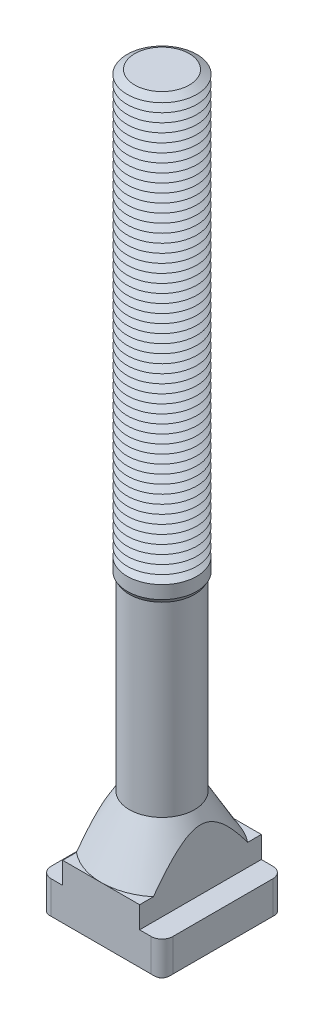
ISO-10303-21;
HEADER;
FILE_DESCRIPTION(('STEP AP214'),'2;1');
FILE_NAME('part.step','',(''),(''),'','','');
FILE_SCHEMA(('AUTOMOTIVE_DESIGN { 1 0 10303 214 1 1 1 1 }'));
ENDSEC;
DATA;
#1=APPLICATION_CONTEXT('core data for automotive mechanical design processes');
#2=APPLICATION_PROTOCOL_DEFINITION('international standard','automotive_design',2000,#1);
#3=PRODUCT_CONTEXT('',#1,'mechanical');
#4=PRODUCT('Part','Part','',(#3));
#5=PRODUCT_RELATED_PRODUCT_CATEGORY('part','',(#4));
#6=PRODUCT_DEFINITION_FORMATION('','',#4);
#7=PRODUCT_DEFINITION_CONTEXT('part definition',#1,'design');
#8=PRODUCT_DEFINITION('design','',#6,#7);
#9=PRODUCT_DEFINITION_SHAPE('','',#8);
#10=(LENGTH_UNIT() NAMED_UNIT(*) SI_UNIT(.MILLI.,.METRE.));
#11=(NAMED_UNIT(*) PLANE_ANGLE_UNIT() SI_UNIT($,.RADIAN.));
#12=(NAMED_UNIT(*) SI_UNIT($,.STERADIAN.) SOLID_ANGLE_UNIT());
#13=UNCERTAINTY_MEASURE_WITH_UNIT(LENGTH_MEASURE(1.E-05),#10,'distance_accuracy_value','');
#14=(GEOMETRIC_REPRESENTATION_CONTEXT(3) GLOBAL_UNCERTAINTY_ASSIGNED_CONTEXT((#13)) GLOBAL_UNIT_ASSIGNED_CONTEXT((#10,
#11,#12)) REPRESENTATION_CONTEXT('',''));
#15=CARTESIAN_POINT('',(0.,0.,0.));
#16=DIRECTION('',(0.,0.,1.));
#17=DIRECTION('',(1.,0.,0.));
#18=AXIS2_PLACEMENT_3D('',#15,#16,#17);
#19=CARTESIAN_POINT('',(0.,162.,0.));
#20=DIRECTION('',(0.,-1.,0.));
#21=DIRECTION('',(0.,0.,-1.));
#22=AXIS2_PLACEMENT_3D('',#19,#20,#21);
#23=CONICAL_SURFACE('',#22,6.26794919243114,1.0471975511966);
#24=CARTESIAN_POINT('',(0.,161.,0.));
#25=DIRECTION('',(0.,-1.,0.));
#26=DIRECTION('',(0.,0.,-1.));
#27=AXIS2_PLACEMENT_3D('',#24,#25,#26);
#28=CIRCLE('',#27,8.00000000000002);
#29=CARTESIAN_POINT('',(0.,161.,-8.00000000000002));
#30=VERTEX_POINT('',#29);
#31=EDGE_CURVE('E828',#30,#30,#28,.T.);
#32=ORIENTED_EDGE('',*,*,#31,.F.);
#33=EDGE_LOOP('',(#32));
#34=FACE_BOUND('',#33,.T.);
#35=CARTESIAN_POINT('',(0.,162.,0.));
#36=DIRECTION('',(0.,-1.,0.));
#37=DIRECTION('',(0.,0.,-1.));
#38=AXIS2_PLACEMENT_3D('',#35,#36,#37);
#39=CIRCLE('',#38,6.26794919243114);
#40=CARTESIAN_POINT('',(0.,162.,-6.26794919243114));
#41=VERTEX_POINT('',#40);
#42=EDGE_CURVE('E632',#41,#41,#39,.T.);
#43=ORIENTED_EDGE('',*,*,#42,.T.);
#44=EDGE_LOOP('',(#43));
#45=FACE_BOUND('',#44,.T.);
#46=ADVANCED_FACE('F39',(#34,#45),#23,.T.);
#47=CARTESIAN_POINT('',(0.,163.,0.));
#48=DIRECTION('',(0.,1.,0.));
#49=DIRECTION('',(0.,0.,1.));
#50=AXIS2_PLACEMENT_3D('',#47,#48,#49);
#51=CONICAL_SURFACE('',#50,8.00000000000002,1.0471975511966);
#52=ORIENTED_EDGE('',*,*,#42,.F.);
#53=EDGE_LOOP('',(#52));
#54=FACE_BOUND('',#53,.T.);
#55=CARTESIAN_POINT('',(0.,163.,0.));
#56=DIRECTION('',(0.,-1.,0.));
#57=DIRECTION('',(0.,0.,-1.));
#58=AXIS2_PLACEMENT_3D('',#55,#56,#57);
#59=CIRCLE('',#58,8.00000000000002);
#60=CARTESIAN_POINT('',(0.,163.,-8.00000000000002));
#61=VERTEX_POINT('',#60);
#62=EDGE_CURVE('E755',#61,#61,#59,.T.);
#63=ORIENTED_EDGE('',*,*,#62,.T.);
#64=EDGE_LOOP('',(#63));
#65=FACE_BOUND('',#64,.T.);
#66=ADVANCED_FACE('F448',(#54,#65),#51,.T.);
#67=CARTESIAN_POINT('',(3.87120520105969,170.,0.));
#68=DIRECTION('',(0.,-1.,0.));
#69=DIRECTION('',(1.,0.,0.));
#70=AXIS2_PLACEMENT_3D('',#67,#68,#69);
#71=PLANE('',#70);
#72=CARTESIAN_POINT('',(0.,170.,0.));
#73=DIRECTION('',(0.,-1.,0.));
#74=DIRECTION('',(0.,0.,-1.));
#75=AXIS2_PLACEMENT_3D('',#72,#73,#74);
#76=CIRCLE('',#75,6.26794919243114);
#77=CARTESIAN_POINT('',(0.,170.,-6.26794919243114));
#78=VERTEX_POINT('',#77);
#79=EDGE_CURVE('E782',#78,#78,#76,.T.);
#80=ORIENTED_EDGE('',*,*,#79,.F.);
#81=EDGE_LOOP('',(#80));
#82=FACE_BOUND('',#81,.T.);
#83=ADVANCED_FACE('F454',(#82),#71,.F.);
#84=CARTESIAN_POINT('',(0.,170.,0.));
#85=DIRECTION('',(0.,-1.,0.));
#86=DIRECTION('',(0.,0.,-1.));
#87=AXIS2_PLACEMENT_3D('',#84,#85,#86);
#88=CONICAL_SURFACE('',#87,6.26794919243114,1.0471975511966);
#89=CARTESIAN_POINT('',(0.,169.,0.));
#90=DIRECTION('',(0.,-1.,0.));
#91=DIRECTION('',(0.,0.,-1.));
#92=AXIS2_PLACEMENT_3D('',#89,#90,#91);
#93=CIRCLE('',#92,8.00000000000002);
#94=CARTESIAN_POINT('',(0.,169.,-8.00000000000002));
#95=VERTEX_POINT('',#94);
#96=EDGE_CURVE('E779',#95,#95,#93,.T.);
#97=ORIENTED_EDGE('',*,*,#96,.F.);
#98=EDGE_LOOP('',(#97));
#99=FACE_BOUND('',#98,.T.);
#100=ORIENTED_EDGE('',*,*,#79,.T.);
#101=EDGE_LOOP('',(#100));
#102=FACE_BOUND('',#101,.T.);
#103=ADVANCED_FACE('F482',(#99,#102),#88,.T.);
#104=CARTESIAN_POINT('',(0.,169.,0.));
#105=DIRECTION('',(0.,1.,0.));
#106=DIRECTION('',(0.,0.,1.));
#107=AXIS2_PLACEMENT_3D('',#104,#105,#106);
#108=CONICAL_SURFACE('',#107,8.00000000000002,1.0471975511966);
#109=CARTESIAN_POINT('',(0.,168.,0.));
#110=DIRECTION('',(0.,-1.,0.));
#111=DIRECTION('',(0.,0.,-1.));
#112=AXIS2_PLACEMENT_3D('',#109,#110,#111);
#113=CIRCLE('',#112,6.26794919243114);
#114=CARTESIAN_POINT('',(0.,168.,-6.26794919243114));
#115=VERTEX_POINT('',#114);
#116=EDGE_CURVE('E775',#115,#115,#113,.T.);
#117=ORIENTED_EDGE('',*,*,#116,.F.);
#118=EDGE_LOOP('',(#117));
#119=FACE_BOUND('',#118,.T.);
#120=ORIENTED_EDGE('',*,*,#96,.T.);
#121=EDGE_LOOP('',(#120));
#122=FACE_BOUND('',#121,.T.);
#123=ADVANCED_FACE('F479',(#119,#122),#108,.T.);
#124=CARTESIAN_POINT('',(0.,168.,0.));
#125=DIRECTION('',(0.,-1.,0.));
#126=DIRECTION('',(0.,0.,-1.));
#127=AXIS2_PLACEMENT_3D('',#124,#125,#126);
#128=CONICAL_SURFACE('',#127,6.26794919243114,1.0471975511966);
#129=CARTESIAN_POINT('',(0.,167.,0.));
#130=DIRECTION('',(0.,-1.,0.));
#131=DIRECTION('',(0.,0.,-1.));
#132=AXIS2_PLACEMENT_3D('',#129,#130,#131);
#133=CIRCLE('',#132,8.00000000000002);
#134=CARTESIAN_POINT('',(0.,167.,-8.00000000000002));
#135=VERTEX_POINT('',#134);
#136=EDGE_CURVE('E771',#135,#135,#133,.T.);
#137=ORIENTED_EDGE('',*,*,#136,.F.);
#138=EDGE_LOOP('',(#137));
#139=FACE_BOUND('',#138,.T.);
#140=ORIENTED_EDGE('',*,*,#116,.T.);
#141=EDGE_LOOP('',(#140));
#142=FACE_BOUND('',#141,.T.);
#143=ADVANCED_FACE('F474',(#139,#142),#128,.T.);
#144=CARTESIAN_POINT('',(0.,167.,0.));
#145=DIRECTION('',(0.,1.,0.));
#146=DIRECTION('',(0.,0.,1.));
#147=AXIS2_PLACEMENT_3D('',#144,#145,#146);
#148=CONICAL_SURFACE('',#147,8.00000000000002,1.0471975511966);
#149=CARTESIAN_POINT('',(0.,166.,0.));
#150=DIRECTION('',(0.,-1.,0.));
#151=DIRECTION('',(0.,0.,-1.));
#152=AXIS2_PLACEMENT_3D('',#149,#150,#151);
#153=CIRCLE('',#152,6.26794919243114);
#154=CARTESIAN_POINT('',(0.,166.,-6.26794919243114));
#155=VERTEX_POINT('',#154);
#156=EDGE_CURVE('E761',#155,#155,#153,.T.);
#157=ORIENTED_EDGE('',*,*,#156,.F.);
#158=EDGE_LOOP('',(#157));
#159=FACE_BOUND('',#158,.T.);
#160=ORIENTED_EDGE('',*,*,#136,.T.);
#161=EDGE_LOOP('',(#160));
#162=FACE_BOUND('',#161,.T.);
#163=ADVANCED_FACE('F471',(#159,#162),#148,.T.);
#164=CARTESIAN_POINT('',(0.,166.,0.));
#165=DIRECTION('',(0.,-1.,0.));
#166=DIRECTION('',(0.,0.,-1.));
#167=AXIS2_PLACEMENT_3D('',#164,#165,#166);
#168=CONICAL_SURFACE('',#167,6.26794919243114,1.0471975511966);
#169=CARTESIAN_POINT('',(0.,165.,0.));
#170=DIRECTION('',(0.,-1.,0.));
#171=DIRECTION('',(0.,0.,-1.));
#172=AXIS2_PLACEMENT_3D('',#169,#170,#171);
#173=CIRCLE('',#172,8.00000000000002);
#174=CARTESIAN_POINT('',(0.,165.,-8.00000000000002));
#175=VERTEX_POINT('',#174);
#176=EDGE_CURVE('E754',#175,#175,#173,.T.);
#177=ORIENTED_EDGE('',*,*,#176,.F.);
#178=EDGE_LOOP('',(#177));
#179=FACE_BOUND('',#178,.T.);
#180=ORIENTED_EDGE('',*,*,#156,.T.);
#181=EDGE_LOOP('',(#180));
#182=FACE_BOUND('',#181,.T.);
#183=ADVANCED_FACE('F465',(#179,#182),#168,.T.);
#184=CARTESIAN_POINT('',(0.,165.,0.));
#185=DIRECTION('',(0.,1.,0.));
#186=DIRECTION('',(0.,0.,1.));
#187=AXIS2_PLACEMENT_3D('',#184,#185,#186);
#188=CONICAL_SURFACE('',#187,8.00000000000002,1.0471975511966);
#189=CARTESIAN_POINT('',(0.,164.,0.));
#190=DIRECTION('',(0.,-1.,0.));
#191=DIRECTION('',(0.,0.,-1.));
#192=AXIS2_PLACEMENT_3D('',#189,#190,#191);
#193=CIRCLE('',#192,6.26794919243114);
#194=CARTESIAN_POINT('',(0.,164.,-6.26794919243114));
#195=VERTEX_POINT('',#194);
#196=EDGE_CURVE('E752',#195,#195,#193,.T.);
#197=ORIENTED_EDGE('',*,*,#196,.F.);
#198=EDGE_LOOP('',(#197));
#199=FACE_BOUND('',#198,.T.);
#200=ORIENTED_EDGE('',*,*,#176,.T.);
#201=EDGE_LOOP('',(#200));
#202=FACE_BOUND('',#201,.T.);
#203=ADVANCED_FACE('F461',(#199,#202),#188,.T.);
#204=CARTESIAN_POINT('',(0.,164.,0.));
#205=DIRECTION('',(0.,-1.,0.));
#206=DIRECTION('',(0.,0.,-1.));
#207=AXIS2_PLACEMENT_3D('',#204,#205,#206);
#208=CONICAL_SURFACE('',#207,6.26794919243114,1.0471975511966);
#209=ORIENTED_EDGE('',*,*,#62,.F.);
#210=EDGE_LOOP('',(#209));
#211=FACE_BOUND('',#210,.T.);
#212=ORIENTED_EDGE('',*,*,#196,.T.);
#213=EDGE_LOOP('',(#212));
#214=FACE_BOUND('',#213,.T.);
#215=ADVANCED_FACE('F464',(#211,#214),#208,.T.);
#216=CARTESIAN_POINT('',(0.,160.,0.));
#217=DIRECTION('',(0.,-1.,0.));
#218=DIRECTION('',(0.,0.,-1.));
#219=AXIS2_PLACEMENT_3D('',#216,#217,#218);
#220=CONICAL_SURFACE('',#219,6.26794919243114,1.0471975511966);
#221=CARTESIAN_POINT('',(0.,159.,0.));
#222=DIRECTION('',(0.,-1.,0.));
#223=DIRECTION('',(0.,0.,-1.));
#224=AXIS2_PLACEMENT_3D('',#221,#222,#223);
#225=CIRCLE('',#224,8.00000000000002);
#226=CARTESIAN_POINT('',(0.,159.,-8.00000000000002));
#227=VERTEX_POINT('',#226);
#228=EDGE_CURVE('E746',#227,#227,#225,.T.);
#229=ORIENTED_EDGE('',*,*,#228,.F.);
#230=EDGE_LOOP('',(#229));
#231=FACE_BOUND('',#230,.T.);
#232=CARTESIAN_POINT('',(0.,160.,0.));
#233=DIRECTION('',(0.,-1.,0.));
#234=DIRECTION('',(0.,0.,-1.));
#235=AXIS2_PLACEMENT_3D('',#232,#233,#234);
#236=CIRCLE('',#235,6.26794919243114);
#237=CARTESIAN_POINT('',(0.,160.,-6.26794919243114));
#238=VERTEX_POINT('',#237);
#239=EDGE_CURVE('E749',#238,#238,#236,.T.);
#240=ORIENTED_EDGE('',*,*,#239,.T.);
#241=EDGE_LOOP('',(#240));
#242=FACE_BOUND('',#241,.T.);
#243=ADVANCED_FACE('F469',(#231,#242),#220,.T.);
#244=CARTESIAN_POINT('',(0.,161.,0.));
#245=DIRECTION('',(0.,1.,0.));
#246=DIRECTION('',(0.,0.,1.));
#247=AXIS2_PLACEMENT_3D('',#244,#245,#246);
#248=CONICAL_SURFACE('',#247,8.00000000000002,1.0471975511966);
#249=ORIENTED_EDGE('',*,*,#239,.F.);
#250=EDGE_LOOP('',(#249));
#251=FACE_BOUND('',#250,.T.);
#252=ORIENTED_EDGE('',*,*,#31,.T.);
#253=EDGE_LOOP('',(#252));
#254=FACE_BOUND('',#253,.T.);
#255=ADVANCED_FACE('F836',(#251,#254),#248,.T.);
#256=CARTESIAN_POINT('',(0.,158.,0.));
#257=DIRECTION('',(0.,-1.,0.));
#258=DIRECTION('',(0.,0.,-1.));
#259=AXIS2_PLACEMENT_3D('',#256,#257,#258);
#260=CONICAL_SURFACE('',#259,6.26794919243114,1.0471975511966);
#261=CARTESIAN_POINT('',(0.,157.,0.));
#262=DIRECTION('',(0.,-1.,0.));
#263=DIRECTION('',(0.,0.,-1.));
#264=AXIS2_PLACEMENT_3D('',#261,#262,#263);
#265=CIRCLE('',#264,8.00000000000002);
#266=CARTESIAN_POINT('',(0.,157.,-8.00000000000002));
#267=VERTEX_POINT('',#266);
#268=EDGE_CURVE('E818',#267,#267,#265,.T.);
#269=ORIENTED_EDGE('',*,*,#268,.F.);
#270=EDGE_LOOP('',(#269));
#271=FACE_BOUND('',#270,.T.);
#272=CARTESIAN_POINT('',(0.,158.,0.));
#273=DIRECTION('',(0.,-1.,0.));
#274=DIRECTION('',(0.,0.,-1.));
#275=AXIS2_PLACEMENT_3D('',#272,#273,#274);
#276=CIRCLE('',#275,6.26794919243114);
#277=CARTESIAN_POINT('',(0.,158.,-6.26794919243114));
#278=VERTEX_POINT('',#277);
#279=EDGE_CURVE('E750',#278,#278,#276,.T.);
#280=ORIENTED_EDGE('',*,*,#279,.T.);
#281=EDGE_LOOP('',(#280));
#282=FACE_BOUND('',#281,.T.);
#283=ADVANCED_FACE('F838',(#271,#282),#260,.T.);
#284=CARTESIAN_POINT('',(0.,159.,0.));
#285=DIRECTION('',(0.,1.,0.));
#286=DIRECTION('',(0.,0.,1.));
#287=AXIS2_PLACEMENT_3D('',#284,#285,#286);
#288=CONICAL_SURFACE('',#287,8.00000000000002,1.0471975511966);
#289=ORIENTED_EDGE('',*,*,#279,.F.);
#290=EDGE_LOOP('',(#289));
#291=FACE_BOUND('',#290,.T.);
#292=ORIENTED_EDGE('',*,*,#228,.T.);
#293=EDGE_LOOP('',(#292));
#294=FACE_BOUND('',#293,.T.);
#295=ADVANCED_FACE('F845',(#291,#294),#288,.T.);
#296=CARTESIAN_POINT('',(0.,156.,0.));
#297=DIRECTION('',(0.,-1.,0.));
#298=DIRECTION('',(0.,0.,-1.));
#299=AXIS2_PLACEMENT_3D('',#296,#297,#298);
#300=CONICAL_SURFACE('',#299,6.26794919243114,1.0471975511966);
#301=CARTESIAN_POINT('',(0.,155.,0.));
#302=DIRECTION('',(0.,-1.,0.));
#303=DIRECTION('',(0.,0.,-1.));
#304=AXIS2_PLACEMENT_3D('',#301,#302,#303);
#305=CIRCLE('',#304,8.00000000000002);
#306=CARTESIAN_POINT('',(0.,155.,-8.00000000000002));
#307=VERTEX_POINT('',#306);
#308=EDGE_CURVE('E671',#307,#307,#305,.T.);
#309=ORIENTED_EDGE('',*,*,#308,.F.);
#310=EDGE_LOOP('',(#309));
#311=FACE_BOUND('',#310,.T.);
#312=CARTESIAN_POINT('',(0.,156.,0.));
#313=DIRECTION('',(0.,-1.,0.));
#314=DIRECTION('',(0.,0.,-1.));
#315=AXIS2_PLACEMENT_3D('',#312,#313,#314);
#316=CIRCLE('',#315,6.26794919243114);
#317=CARTESIAN_POINT('',(0.,156.,-6.26794919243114));
#318=VERTEX_POINT('',#317);
#319=EDGE_CURVE('E674',#318,#318,#316,.T.);
#320=ORIENTED_EDGE('',*,*,#319,.T.);
#321=EDGE_LOOP('',(#320));
#322=FACE_BOUND('',#321,.T.);
#323=ADVANCED_FACE('F853',(#311,#322),#300,.T.);
#324=CARTESIAN_POINT('',(0.,157.,0.));
#325=DIRECTION('',(0.,1.,0.));
#326=DIRECTION('',(0.,0.,1.));
#327=AXIS2_PLACEMENT_3D('',#324,#325,#326);
#328=CONICAL_SURFACE('',#327,8.00000000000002,1.0471975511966);
#329=ORIENTED_EDGE('',*,*,#319,.F.);
#330=EDGE_LOOP('',(#329));
#331=FACE_BOUND('',#330,.T.);
#332=ORIENTED_EDGE('',*,*,#268,.T.);
#333=EDGE_LOOP('',(#332));
#334=FACE_BOUND('',#333,.T.);
#335=ADVANCED_FACE('F857',(#331,#334),#328,.T.);
#336=CARTESIAN_POINT('',(0.,154.,0.));
#337=DIRECTION('',(0.,-1.,0.));
#338=DIRECTION('',(0.,0.,-1.));
#339=AXIS2_PLACEMENT_3D('',#336,#337,#338);
#340=CONICAL_SURFACE('',#339,6.26794919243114,1.0471975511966);
#341=CARTESIAN_POINT('',(0.,153.,0.));
#342=DIRECTION('',(0.,-1.,0.));
#343=DIRECTION('',(0.,0.,-1.));
#344=AXIS2_PLACEMENT_3D('',#341,#342,#343);
#345=CIRCLE('',#344,8.00000000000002);
#346=CARTESIAN_POINT('',(0.,153.,-8.00000000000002));
#347=VERTEX_POINT('',#346);
#348=EDGE_CURVE('E743',#347,#347,#345,.T.);
#349=ORIENTED_EDGE('',*,*,#348,.F.);
#350=EDGE_LOOP('',(#349));
#351=FACE_BOUND('',#350,.T.);
#352=CARTESIAN_POINT('',(0.,154.,0.));
#353=DIRECTION('',(0.,-1.,0.));
#354=DIRECTION('',(0.,0.,-1.));
#355=AXIS2_PLACEMENT_3D('',#352,#353,#354);
#356=CIRCLE('',#355,6.26794919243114);
#357=CARTESIAN_POINT('',(0.,154.,-6.26794919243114));
#358=VERTEX_POINT('',#357);
#359=EDGE_CURVE('E675',#358,#358,#356,.T.);
#360=ORIENTED_EDGE('',*,*,#359,.T.);
#361=EDGE_LOOP('',(#360));
#362=FACE_BOUND('',#361,.T.);
#363=ADVANCED_FACE('F861',(#351,#362),#340,.T.);
#364=CARTESIAN_POINT('',(0.,155.,0.));
#365=DIRECTION('',(0.,1.,0.));
#366=DIRECTION('',(0.,0.,1.));
#367=AXIS2_PLACEMENT_3D('',#364,#365,#366);
#368=CONICAL_SURFACE('',#367,8.00000000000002,1.0471975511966);
#369=ORIENTED_EDGE('',*,*,#359,.F.);
#370=EDGE_LOOP('',(#369));
#371=FACE_BOUND('',#370,.T.);
#372=ORIENTED_EDGE('',*,*,#308,.T.);
#373=EDGE_LOOP('',(#372));
#374=FACE_BOUND('',#373,.T.);
#375=ADVANCED_FACE('F865',(#371,#374),#368,.T.);
#376=CARTESIAN_POINT('',(0.,152.,0.));
#377=DIRECTION('',(0.,-1.,0.));
#378=DIRECTION('',(0.,0.,-1.));
#379=AXIS2_PLACEMENT_3D('',#376,#377,#378);
#380=CONICAL_SURFACE('',#379,6.26794919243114,1.0471975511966);
#381=CARTESIAN_POINT('',(0.,151.,0.));
#382=DIRECTION('',(0.,-1.,0.));
#383=DIRECTION('',(0.,0.,-1.));
#384=AXIS2_PLACEMENT_3D('',#381,#382,#383);
#385=CIRCLE('',#384,8.00000000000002);
#386=CARTESIAN_POINT('',(0.,151.,-8.00000000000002));
#387=VERTEX_POINT('',#386);
#388=EDGE_CURVE('E744',#387,#387,#385,.T.);
#389=ORIENTED_EDGE('',*,*,#388,.F.);
#390=EDGE_LOOP('',(#389));
#391=FACE_BOUND('',#390,.T.);
#392=CARTESIAN_POINT('',(0.,152.,0.));
#393=DIRECTION('',(0.,-1.,0.));
#394=DIRECTION('',(0.,0.,-1.));
#395=AXIS2_PLACEMENT_3D('',#392,#393,#394);
#396=CIRCLE('',#395,6.26794919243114);
#397=CARTESIAN_POINT('',(0.,152.,-6.26794919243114));
#398=VERTEX_POINT('',#397);
#399=EDGE_CURVE('E740',#398,#398,#396,.T.);
#400=ORIENTED_EDGE('',*,*,#399,.T.);
#401=EDGE_LOOP('',(#400));
#402=FACE_BOUND('',#401,.T.);
#403=ADVANCED_FACE('F869',(#391,#402),#380,.T.);
#404=CARTESIAN_POINT('',(0.,153.,0.));
#405=DIRECTION('',(0.,1.,0.));
#406=DIRECTION('',(0.,0.,1.));
#407=AXIS2_PLACEMENT_3D('',#404,#405,#406);
#408=CONICAL_SURFACE('',#407,8.00000000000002,1.0471975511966);
#409=ORIENTED_EDGE('',*,*,#399,.F.);
#410=EDGE_LOOP('',(#409));
#411=FACE_BOUND('',#410,.T.);
#412=ORIENTED_EDGE('',*,*,#348,.T.);
#413=EDGE_LOOP('',(#412));
#414=FACE_BOUND('',#413,.T.);
#415=ADVANCED_FACE('F873',(#411,#414),#408,.T.);
#416=CARTESIAN_POINT('',(0.,150.,0.));
#417=DIRECTION('',(0.,-1.,0.));
#418=DIRECTION('',(0.,0.,-1.));
#419=AXIS2_PLACEMENT_3D('',#416,#417,#418);
#420=CONICAL_SURFACE('',#419,6.26794919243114,1.0471975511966);
#421=CARTESIAN_POINT('',(0.,149.,0.));
#422=DIRECTION('',(0.,-1.,0.));
#423=DIRECTION('',(0.,0.,-1.));
#424=AXIS2_PLACEMENT_3D('',#421,#422,#423);
#425=CIRCLE('',#424,8.00000000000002);
#426=CARTESIAN_POINT('',(0.,149.,-8.00000000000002));
#427=VERTEX_POINT('',#426);
#428=EDGE_CURVE('E1387',#427,#427,#425,.T.);
#429=ORIENTED_EDGE('',*,*,#428,.F.);
#430=EDGE_LOOP('',(#429));
#431=FACE_BOUND('',#430,.T.);
#432=CARTESIAN_POINT('',(0.,150.,0.));
#433=DIRECTION('',(0.,-1.,0.));
#434=DIRECTION('',(0.,0.,-1.));
#435=AXIS2_PLACEMENT_3D('',#432,#433,#434);
#436=CIRCLE('',#435,6.26794919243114);
#437=CARTESIAN_POINT('',(0.,150.,-6.26794919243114));
#438=VERTEX_POINT('',#437);
#439=EDGE_CURVE('E1391',#438,#438,#436,.T.);
#440=ORIENTED_EDGE('',*,*,#439,.T.);
#441=EDGE_LOOP('',(#440));
#442=FACE_BOUND('',#441,.T.);
#443=ADVANCED_FACE('F877',(#431,#442),#420,.T.);
#444=CARTESIAN_POINT('',(0.,151.,0.));
#445=DIRECTION('',(0.,1.,0.));
#446=DIRECTION('',(0.,0.,1.));
#447=AXIS2_PLACEMENT_3D('',#444,#445,#446);
#448=CONICAL_SURFACE('',#447,8.00000000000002,1.0471975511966);
#449=ORIENTED_EDGE('',*,*,#439,.F.);
#450=EDGE_LOOP('',(#449));
#451=FACE_BOUND('',#450,.T.);
#452=ORIENTED_EDGE('',*,*,#388,.T.);
#453=EDGE_LOOP('',(#452));
#454=FACE_BOUND('',#453,.T.);
#455=ADVANCED_FACE('F881',(#451,#454),#448,.T.);
#456=CARTESIAN_POINT('',(0.,148.,0.));
#457=DIRECTION('',(0.,-1.,0.));
#458=DIRECTION('',(0.,0.,-1.));
#459=AXIS2_PLACEMENT_3D('',#456,#457,#458);
#460=CONICAL_SURFACE('',#459,6.26794919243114,1.0471975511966);
#461=CARTESIAN_POINT('',(0.,147.,0.));
#462=DIRECTION('',(0.,-1.,0.));
#463=DIRECTION('',(0.,0.,-1.));
#464=AXIS2_PLACEMENT_3D('',#461,#462,#463);
#465=CIRCLE('',#464,8.00000000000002);
#466=CARTESIAN_POINT('',(0.,147.,-8.00000000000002));
#467=VERTEX_POINT('',#466);
#468=EDGE_CURVE('E1379',#467,#467,#465,.T.);
#469=ORIENTED_EDGE('',*,*,#468,.F.);
#470=EDGE_LOOP('',(#469));
#471=FACE_BOUND('',#470,.T.);
#472=CARTESIAN_POINT('',(0.,148.,0.));
#473=DIRECTION('',(0.,-1.,0.));
#474=DIRECTION('',(0.,0.,-1.));
#475=AXIS2_PLACEMENT_3D('',#472,#473,#474);
#476=CIRCLE('',#475,6.26794919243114);
#477=CARTESIAN_POINT('',(0.,148.,-6.26794919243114));
#478=VERTEX_POINT('',#477);
#479=EDGE_CURVE('E1383',#478,#478,#476,.T.);
#480=ORIENTED_EDGE('',*,*,#479,.T.);
#481=EDGE_LOOP('',(#480));
#482=FACE_BOUND('',#481,.T.);
#483=ADVANCED_FACE('F885',(#471,#482),#460,.T.);
#484=CARTESIAN_POINT('',(0.,149.,0.));
#485=DIRECTION('',(0.,1.,0.));
#486=DIRECTION('',(0.,0.,1.));
#487=AXIS2_PLACEMENT_3D('',#484,#485,#486);
#488=CONICAL_SURFACE('',#487,8.00000000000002,1.0471975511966);
#489=ORIENTED_EDGE('',*,*,#479,.F.);
#490=EDGE_LOOP('',(#489));
#491=FACE_BOUND('',#490,.T.);
#492=ORIENTED_EDGE('',*,*,#428,.T.);
#493=EDGE_LOOP('',(#492));
#494=FACE_BOUND('',#493,.T.);
#495=ADVANCED_FACE('F889',(#491,#494),#488,.T.);
#496=CARTESIAN_POINT('',(0.,146.,0.));
#497=DIRECTION('',(0.,-1.,0.));
#498=DIRECTION('',(0.,0.,-1.));
#499=AXIS2_PLACEMENT_3D('',#496,#497,#498);
#500=CONICAL_SURFACE('',#499,6.26794919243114,1.0471975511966);
#501=CARTESIAN_POINT('',(0.,145.,0.));
#502=DIRECTION('',(0.,-1.,0.));
#503=DIRECTION('',(0.,0.,-1.));
#504=AXIS2_PLACEMENT_3D('',#501,#502,#503);
#505=CIRCLE('',#504,8.00000000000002);
#506=CARTESIAN_POINT('',(0.,145.,-8.00000000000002));
#507=VERTEX_POINT('',#506);
#508=EDGE_CURVE('E700',#507,#507,#505,.T.);
#509=ORIENTED_EDGE('',*,*,#508,.F.);
#510=EDGE_LOOP('',(#509));
#511=FACE_BOUND('',#510,.T.);
#512=CARTESIAN_POINT('',(0.,146.,0.));
#513=DIRECTION('',(0.,-1.,0.));
#514=DIRECTION('',(0.,0.,-1.));
#515=AXIS2_PLACEMENT_3D('',#512,#513,#514);
#516=CIRCLE('',#515,6.26794919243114);
#517=CARTESIAN_POINT('',(0.,146.,-6.26794919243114));
#518=VERTEX_POINT('',#517);
#519=EDGE_CURVE('E704',#518,#518,#516,.T.);
#520=ORIENTED_EDGE('',*,*,#519,.T.);
#521=EDGE_LOOP('',(#520));
#522=FACE_BOUND('',#521,.T.);
#523=ADVANCED_FACE('F893',(#511,#522),#500,.T.);
#524=CARTESIAN_POINT('',(0.,147.,0.));
#525=DIRECTION('',(0.,1.,0.));
#526=DIRECTION('',(0.,0.,1.));
#527=AXIS2_PLACEMENT_3D('',#524,#525,#526);
#528=CONICAL_SURFACE('',#527,8.00000000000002,1.0471975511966);
#529=ORIENTED_EDGE('',*,*,#519,.F.);
#530=EDGE_LOOP('',(#529));
#531=FACE_BOUND('',#530,.T.);
#532=ORIENTED_EDGE('',*,*,#468,.T.);
#533=EDGE_LOOP('',(#532));
#534=FACE_BOUND('',#533,.T.);
#535=ADVANCED_FACE('F897',(#531,#534),#528,.T.);
#536=CARTESIAN_POINT('',(0.,144.,0.));
#537=DIRECTION('',(0.,-1.,0.));
#538=DIRECTION('',(0.,0.,-1.));
#539=AXIS2_PLACEMENT_3D('',#536,#537,#538);
#540=CONICAL_SURFACE('',#539,6.26794919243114,1.0471975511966);
#541=CARTESIAN_POINT('',(0.,143.,0.));
#542=DIRECTION('',(0.,-1.,0.));
#543=DIRECTION('',(0.,0.,-1.));
#544=AXIS2_PLACEMENT_3D('',#541,#542,#543);
#545=CIRCLE('',#544,8.00000000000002);
#546=CARTESIAN_POINT('',(0.,143.,-8.00000000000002));
#547=VERTEX_POINT('',#546);
#548=EDGE_CURVE('E701',#547,#547,#545,.T.);
#549=ORIENTED_EDGE('',*,*,#548,.F.);
#550=EDGE_LOOP('',(#549));
#551=FACE_BOUND('',#550,.T.);
#552=CARTESIAN_POINT('',(0.,144.,0.));
#553=DIRECTION('',(0.,-1.,0.));
#554=DIRECTION('',(0.,0.,-1.));
#555=AXIS2_PLACEMENT_3D('',#552,#553,#554);
#556=CIRCLE('',#555,6.26794919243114);
#557=CARTESIAN_POINT('',(0.,144.,-6.26794919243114));
#558=VERTEX_POINT('',#557);
#559=EDGE_CURVE('E697',#558,#558,#556,.T.);
#560=ORIENTED_EDGE('',*,*,#559,.T.);
#561=EDGE_LOOP('',(#560));
#562=FACE_BOUND('',#561,.T.);
#563=ADVANCED_FACE('F901',(#551,#562),#540,.T.);
#564=CARTESIAN_POINT('',(0.,145.,0.));
#565=DIRECTION('',(0.,1.,0.));
#566=DIRECTION('',(0.,0.,1.));
#567=AXIS2_PLACEMENT_3D('',#564,#565,#566);
#568=CONICAL_SURFACE('',#567,8.00000000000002,1.0471975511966);
#569=ORIENTED_EDGE('',*,*,#559,.F.);
#570=EDGE_LOOP('',(#569));
#571=FACE_BOUND('',#570,.T.);
#572=ORIENTED_EDGE('',*,*,#508,.T.);
#573=EDGE_LOOP('',(#572));
#574=FACE_BOUND('',#573,.T.);
#575=ADVANCED_FACE('F905',(#571,#574),#568,.T.);
#576=CARTESIAN_POINT('',(0.,142.,0.));
#577=DIRECTION('',(0.,-1.,0.));
#578=DIRECTION('',(0.,0.,-1.));
#579=AXIS2_PLACEMENT_3D('',#576,#577,#578);
#580=CONICAL_SURFACE('',#579,6.26794919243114,1.0471975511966);
#581=CARTESIAN_POINT('',(0.,141.,0.));
#582=DIRECTION('',(0.,-1.,0.));
#583=DIRECTION('',(0.,0.,-1.));
#584=AXIS2_PLACEMENT_3D('',#581,#582,#583);
#585=CIRCLE('',#584,8.00000000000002);
#586=CARTESIAN_POINT('',(0.,141.,-8.00000000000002));
#587=VERTEX_POINT('',#586);
#588=EDGE_CURVE('E1365',#587,#587,#585,.T.);
#589=ORIENTED_EDGE('',*,*,#588,.F.);
#590=EDGE_LOOP('',(#589));
#591=FACE_BOUND('',#590,.T.);
#592=CARTESIAN_POINT('',(0.,142.,0.));
#593=DIRECTION('',(0.,-1.,0.));
#594=DIRECTION('',(0.,0.,-1.));
#595=AXIS2_PLACEMENT_3D('',#592,#593,#594);
#596=CIRCLE('',#595,6.26794919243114);
#597=CARTESIAN_POINT('',(0.,142.,-6.26794919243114));
#598=VERTEX_POINT('',#597);
#599=EDGE_CURVE('E1369',#598,#598,#596,.T.);
#600=ORIENTED_EDGE('',*,*,#599,.T.);
#601=EDGE_LOOP('',(#600));
#602=FACE_BOUND('',#601,.T.);
#603=ADVANCED_FACE('F909',(#591,#602),#580,.T.);
#604=CARTESIAN_POINT('',(0.,143.,0.));
#605=DIRECTION('',(0.,1.,0.));
#606=DIRECTION('',(0.,0.,1.));
#607=AXIS2_PLACEMENT_3D('',#604,#605,#606);
#608=CONICAL_SURFACE('',#607,8.00000000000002,1.0471975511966);
#609=ORIENTED_EDGE('',*,*,#599,.F.);
#610=EDGE_LOOP('',(#609));
#611=FACE_BOUND('',#610,.T.);
#612=ORIENTED_EDGE('',*,*,#548,.T.);
#613=EDGE_LOOP('',(#612));
#614=FACE_BOUND('',#613,.T.);
#615=ADVANCED_FACE('F913',(#611,#614),#608,.T.);
#616=CARTESIAN_POINT('',(0.,140.,0.));
#617=DIRECTION('',(0.,-1.,0.));
#618=DIRECTION('',(0.,0.,-1.));
#619=AXIS2_PLACEMENT_3D('',#616,#617,#618);
#620=CONICAL_SURFACE('',#619,6.26794919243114,1.0471975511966);
#621=CARTESIAN_POINT('',(0.,139.,0.));
#622=DIRECTION('',(0.,-1.,0.));
#623=DIRECTION('',(0.,0.,-1.));
#624=AXIS2_PLACEMENT_3D('',#621,#622,#623);
#625=CIRCLE('',#624,8.00000000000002);
#626=CARTESIAN_POINT('',(0.,139.,-8.00000000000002));
#627=VERTEX_POINT('',#626);
#628=EDGE_CURVE('E738',#627,#627,#625,.T.);
#629=ORIENTED_EDGE('',*,*,#628,.F.);
#630=EDGE_LOOP('',(#629));
#631=FACE_BOUND('',#630,.T.);
#632=CARTESIAN_POINT('',(0.,140.,0.));
#633=DIRECTION('',(0.,-1.,0.));
#634=DIRECTION('',(0.,0.,-1.));
#635=AXIS2_PLACEMENT_3D('',#632,#633,#634);
#636=CIRCLE('',#635,6.26794919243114);
#637=CARTESIAN_POINT('',(0.,140.,-6.26794919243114));
#638=VERTEX_POINT('',#637);
#639=EDGE_CURVE('E1361',#638,#638,#636,.T.);
#640=ORIENTED_EDGE('',*,*,#639,.T.);
#641=EDGE_LOOP('',(#640));
#642=FACE_BOUND('',#641,.T.);
#643=ADVANCED_FACE('F917',(#631,#642),#620,.T.);
#644=CARTESIAN_POINT('',(0.,141.,0.));
#645=DIRECTION('',(0.,1.,0.));
#646=DIRECTION('',(0.,0.,1.));
#647=AXIS2_PLACEMENT_3D('',#644,#645,#646);
#648=CONICAL_SURFACE('',#647,8.00000000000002,1.0471975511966);
#649=ORIENTED_EDGE('',*,*,#639,.F.);
#650=EDGE_LOOP('',(#649));
#651=FACE_BOUND('',#650,.T.);
#652=ORIENTED_EDGE('',*,*,#588,.T.);
#653=EDGE_LOOP('',(#652));
#654=FACE_BOUND('',#653,.T.);
#655=ADVANCED_FACE('F921',(#651,#654),#648,.T.);
#656=CARTESIAN_POINT('',(0.,138.,0.));
#657=DIRECTION('',(0.,-1.,0.));
#658=DIRECTION('',(0.,0.,-1.));
#659=AXIS2_PLACEMENT_3D('',#656,#657,#658);
#660=CONICAL_SURFACE('',#659,6.26794919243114,1.0471975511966);
#661=CARTESIAN_POINT('',(0.,137.,0.));
#662=DIRECTION('',(0.,-1.,0.));
#663=DIRECTION('',(0.,0.,-1.));
#664=AXIS2_PLACEMENT_3D('',#661,#662,#663);
#665=CIRCLE('',#664,8.00000000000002);
#666=CARTESIAN_POINT('',(0.,137.,-8.00000000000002));
#667=VERTEX_POINT('',#666);
#668=EDGE_CURVE('E668',#667,#667,#665,.T.);
#669=ORIENTED_EDGE('',*,*,#668,.F.);
#670=EDGE_LOOP('',(#669));
#671=FACE_BOUND('',#670,.T.);
#672=CARTESIAN_POINT('',(0.,138.,0.));
#673=DIRECTION('',(0.,-1.,0.));
#674=DIRECTION('',(0.,0.,-1.));
#675=AXIS2_PLACEMENT_3D('',#672,#673,#674);
#676=CIRCLE('',#675,6.26794919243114);
#677=CARTESIAN_POINT('',(0.,138.,-6.26794919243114));
#678=VERTEX_POINT('',#677);
#679=EDGE_CURVE('E735',#678,#678,#676,.T.);
#680=ORIENTED_EDGE('',*,*,#679,.T.);
#681=EDGE_LOOP('',(#680));
#682=FACE_BOUND('',#681,.T.);
#683=ADVANCED_FACE('F925',(#671,#682),#660,.T.);
#684=CARTESIAN_POINT('',(0.,139.,0.));
#685=DIRECTION('',(0.,1.,0.));
#686=DIRECTION('',(0.,0.,1.));
#687=AXIS2_PLACEMENT_3D('',#684,#685,#686);
#688=CONICAL_SURFACE('',#687,8.00000000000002,1.0471975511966);
#689=ORIENTED_EDGE('',*,*,#679,.F.);
#690=EDGE_LOOP('',(#689));
#691=FACE_BOUND('',#690,.T.);
#692=ORIENTED_EDGE('',*,*,#628,.T.);
#693=EDGE_LOOP('',(#692));
#694=FACE_BOUND('',#693,.T.);
#695=ADVANCED_FACE('F929',(#691,#694),#688,.T.);
#696=CARTESIAN_POINT('',(0.,136.,0.));
#697=DIRECTION('',(0.,-1.,0.));
#698=DIRECTION('',(0.,0.,-1.));
#699=AXIS2_PLACEMENT_3D('',#696,#697,#698);
#700=CONICAL_SURFACE('',#699,6.26794919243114,1.0471975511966);
#701=CARTESIAN_POINT('',(0.,135.,0.));
#702=DIRECTION('',(0.,-1.,0.));
#703=DIRECTION('',(0.,0.,-1.));
#704=AXIS2_PLACEMENT_3D('',#701,#702,#703);
#705=CIRCLE('',#704,8.00000000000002);
#706=CARTESIAN_POINT('',(0.,135.,-8.00000000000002));
#707=VERTEX_POINT('',#706);
#708=EDGE_CURVE('E669',#707,#707,#705,.T.);
#709=ORIENTED_EDGE('',*,*,#708,.F.);
#710=EDGE_LOOP('',(#709));
#711=FACE_BOUND('',#710,.T.);
#712=CARTESIAN_POINT('',(0.,136.,0.));
#713=DIRECTION('',(0.,-1.,0.));
#714=DIRECTION('',(0.,0.,-1.));
#715=AXIS2_PLACEMENT_3D('',#712,#713,#714);
#716=CIRCLE('',#715,6.26794919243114);
#717=CARTESIAN_POINT('',(0.,136.,-6.26794919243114));
#718=VERTEX_POINT('',#717);
#719=EDGE_CURVE('E665',#718,#718,#716,.T.);
#720=ORIENTED_EDGE('',*,*,#719,.T.);
#721=EDGE_LOOP('',(#720));
#722=FACE_BOUND('',#721,.T.);
#723=ADVANCED_FACE('F933',(#711,#722),#700,.T.);
#724=CARTESIAN_POINT('',(0.,137.,0.));
#725=DIRECTION('',(0.,1.,0.));
#726=DIRECTION('',(0.,0.,1.));
#727=AXIS2_PLACEMENT_3D('',#724,#725,#726);
#728=CONICAL_SURFACE('',#727,8.00000000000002,1.0471975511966);
#729=ORIENTED_EDGE('',*,*,#719,.F.);
#730=EDGE_LOOP('',(#729));
#731=FACE_BOUND('',#730,.T.);
#732=ORIENTED_EDGE('',*,*,#668,.T.);
#733=EDGE_LOOP('',(#732));
#734=FACE_BOUND('',#733,.T.);
#735=ADVANCED_FACE('F937',(#731,#734),#728,.T.);
#736=CARTESIAN_POINT('',(0.,134.,0.));
#737=DIRECTION('',(0.,-1.,0.));
#738=DIRECTION('',(0.,0.,-1.));
#739=AXIS2_PLACEMENT_3D('',#736,#737,#738);
#740=CONICAL_SURFACE('',#739,6.26794919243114,1.0471975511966);
#741=CARTESIAN_POINT('',(0.,133.,0.));
#742=DIRECTION('',(0.,-1.,0.));
#743=DIRECTION('',(0.,0.,-1.));
#744=AXIS2_PLACEMENT_3D('',#741,#742,#743);
#745=CIRCLE('',#744,8.00000000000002);
#746=CARTESIAN_POINT('',(0.,133.,-8.00000000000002));
#747=VERTEX_POINT('',#746);
#748=EDGE_CURVE('E1344',#747,#747,#745,.T.);
#749=ORIENTED_EDGE('',*,*,#748,.F.);
#750=EDGE_LOOP('',(#749));
#751=FACE_BOUND('',#750,.T.);
#752=CARTESIAN_POINT('',(0.,134.,0.));
#753=DIRECTION('',(0.,-1.,0.));
#754=DIRECTION('',(0.,0.,-1.));
#755=AXIS2_PLACEMENT_3D('',#752,#753,#754);
#756=CIRCLE('',#755,6.26794919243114);
#757=CARTESIAN_POINT('',(0.,134.,-6.26794919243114));
#758=VERTEX_POINT('',#757);
#759=EDGE_CURVE('E1348',#758,#758,#756,.T.);
#760=ORIENTED_EDGE('',*,*,#759,.T.);
#761=EDGE_LOOP('',(#760));
#762=FACE_BOUND('',#761,.T.);
#763=ADVANCED_FACE('F941',(#751,#762),#740,.T.);
#764=CARTESIAN_POINT('',(0.,135.,0.));
#765=DIRECTION('',(0.,1.,0.));
#766=DIRECTION('',(0.,0.,1.));
#767=AXIS2_PLACEMENT_3D('',#764,#765,#766);
#768=CONICAL_SURFACE('',#767,8.00000000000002,1.0471975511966);
#769=ORIENTED_EDGE('',*,*,#759,.F.);
#770=EDGE_LOOP('',(#769));
#771=FACE_BOUND('',#770,.T.);
#772=ORIENTED_EDGE('',*,*,#708,.T.);
#773=EDGE_LOOP('',(#772));
#774=FACE_BOUND('',#773,.T.);
#775=ADVANCED_FACE('F945',(#771,#774),#768,.T.);
#776=CARTESIAN_POINT('',(0.,132.,0.));
#777=DIRECTION('',(0.,-1.,0.));
#778=DIRECTION('',(0.,0.,-1.));
#779=AXIS2_PLACEMENT_3D('',#776,#777,#778);
#780=CONICAL_SURFACE('',#779,6.26794919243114,1.0471975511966);
#781=CARTESIAN_POINT('',(0.,131.,0.));
#782=DIRECTION('',(0.,-1.,0.));
#783=DIRECTION('',(0.,0.,-1.));
#784=AXIS2_PLACEMENT_3D('',#781,#782,#783);
#785=CIRCLE('',#784,8.00000000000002);
#786=CARTESIAN_POINT('',(0.,131.,-8.00000000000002));
#787=VERTEX_POINT('',#786);
#788=EDGE_CURVE('E659',#787,#787,#785,.T.);
#789=ORIENTED_EDGE('',*,*,#788,.F.);
#790=EDGE_LOOP('',(#789));
#791=FACE_BOUND('',#790,.T.);
#792=CARTESIAN_POINT('',(0.,132.,0.));
#793=DIRECTION('',(0.,-1.,0.));
#794=DIRECTION('',(0.,0.,-1.));
#795=AXIS2_PLACEMENT_3D('',#792,#793,#794);
#796=CIRCLE('',#795,6.26794919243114);
#797=CARTESIAN_POINT('',(0.,132.,-6.26794919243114));
#798=VERTEX_POINT('',#797);
#799=EDGE_CURVE('E662',#798,#798,#796,.T.);
#800=ORIENTED_EDGE('',*,*,#799,.T.);
#801=EDGE_LOOP('',(#800));
#802=FACE_BOUND('',#801,.T.);
#803=ADVANCED_FACE('F949',(#791,#802),#780,.T.);
#804=CARTESIAN_POINT('',(0.,133.,0.));
#805=DIRECTION('',(0.,1.,0.));
#806=DIRECTION('',(0.,0.,1.));
#807=AXIS2_PLACEMENT_3D('',#804,#805,#806);
#808=CONICAL_SURFACE('',#807,8.00000000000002,1.0471975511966);
#809=ORIENTED_EDGE('',*,*,#799,.F.);
#810=EDGE_LOOP('',(#809));
#811=FACE_BOUND('',#810,.T.);
#812=ORIENTED_EDGE('',*,*,#748,.T.);
#813=EDGE_LOOP('',(#812));
#814=FACE_BOUND('',#813,.T.);
#815=ADVANCED_FACE('F953',(#811,#814),#808,.T.);
#816=CARTESIAN_POINT('',(0.,130.,0.));
#817=DIRECTION('',(0.,-1.,0.));
#818=DIRECTION('',(0.,0.,-1.));
#819=AXIS2_PLACEMENT_3D('',#816,#817,#818);
#820=CONICAL_SURFACE('',#819,6.26794919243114,1.0471975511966);
#821=CARTESIAN_POINT('',(0.,129.,0.));
#822=DIRECTION('',(0.,-1.,0.));
#823=DIRECTION('',(0.,0.,-1.));
#824=AXIS2_PLACEMENT_3D('',#821,#822,#823);
#825=CIRCLE('',#824,8.00000000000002);
#826=CARTESIAN_POINT('',(0.,129.,-8.00000000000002));
#827=VERTEX_POINT('',#826);
#828=EDGE_CURVE('E1334',#827,#827,#825,.T.);
#829=ORIENTED_EDGE('',*,*,#828,.F.);
#830=EDGE_LOOP('',(#829));
#831=FACE_BOUND('',#830,.T.);
#832=CARTESIAN_POINT('',(0.,130.,0.));
#833=DIRECTION('',(0.,-1.,0.));
#834=DIRECTION('',(0.,0.,-1.));
#835=AXIS2_PLACEMENT_3D('',#832,#833,#834);
#836=CIRCLE('',#835,6.26794919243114);
#837=CARTESIAN_POINT('',(0.,130.,-6.26794919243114));
#838=VERTEX_POINT('',#837);
#839=EDGE_CURVE('E663',#838,#838,#836,.T.);
#840=ORIENTED_EDGE('',*,*,#839,.T.);
#841=EDGE_LOOP('',(#840));
#842=FACE_BOUND('',#841,.T.);
#843=ADVANCED_FACE('F957',(#831,#842),#820,.T.);
#844=CARTESIAN_POINT('',(0.,131.,0.));
#845=DIRECTION('',(0.,1.,0.));
#846=DIRECTION('',(0.,0.,1.));
#847=AXIS2_PLACEMENT_3D('',#844,#845,#846);
#848=CONICAL_SURFACE('',#847,8.00000000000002,1.0471975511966);
#849=ORIENTED_EDGE('',*,*,#839,.F.);
#850=EDGE_LOOP('',(#849));
#851=FACE_BOUND('',#850,.T.);
#852=ORIENTED_EDGE('',*,*,#788,.T.);
#853=EDGE_LOOP('',(#852));
#854=FACE_BOUND('',#853,.T.);
#855=ADVANCED_FACE('F961',(#851,#854),#848,.T.);
#856=CARTESIAN_POINT('',(0.,128.,0.));
#857=DIRECTION('',(0.,-1.,0.));
#858=DIRECTION('',(0.,0.,-1.));
#859=AXIS2_PLACEMENT_3D('',#856,#857,#858);
#860=CONICAL_SURFACE('',#859,6.26794919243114,1.0471975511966);
#861=CARTESIAN_POINT('',(0.,127.,0.));
#862=DIRECTION('',(0.,-1.,0.));
#863=DIRECTION('',(0.,0.,-1.));
#864=AXIS2_PLACEMENT_3D('',#861,#862,#863);
#865=CIRCLE('',#864,8.00000000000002);
#866=CARTESIAN_POINT('',(0.,127.,-8.00000000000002));
#867=VERTEX_POINT('',#866);
#868=EDGE_CURVE('E1326',#867,#867,#865,.T.);
#869=ORIENTED_EDGE('',*,*,#868,.F.);
#870=EDGE_LOOP('',(#869));
#871=FACE_BOUND('',#870,.T.);
#872=CARTESIAN_POINT('',(0.,128.,0.));
#873=DIRECTION('',(0.,-1.,0.));
#874=DIRECTION('',(0.,0.,-1.));
#875=AXIS2_PLACEMENT_3D('',#872,#873,#874);
#876=CIRCLE('',#875,6.26794919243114);
#877=CARTESIAN_POINT('',(0.,128.,-6.26794919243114));
#878=VERTEX_POINT('',#877);
#879=EDGE_CURVE('E1330',#878,#878,#876,.T.);
#880=ORIENTED_EDGE('',*,*,#879,.T.);
#881=EDGE_LOOP('',(#880));
#882=FACE_BOUND('',#881,.T.);
#883=ADVANCED_FACE('F965',(#871,#882),#860,.T.);
#884=CARTESIAN_POINT('',(0.,129.,0.));
#885=DIRECTION('',(0.,1.,0.));
#886=DIRECTION('',(0.,0.,1.));
#887=AXIS2_PLACEMENT_3D('',#884,#885,#886);
#888=CONICAL_SURFACE('',#887,8.00000000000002,1.0471975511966);
#889=ORIENTED_EDGE('',*,*,#879,.F.);
#890=EDGE_LOOP('',(#889));
#891=FACE_BOUND('',#890,.T.);
#892=ORIENTED_EDGE('',*,*,#828,.T.);
#893=EDGE_LOOP('',(#892));
#894=FACE_BOUND('',#893,.T.);
#895=ADVANCED_FACE('F969',(#891,#894),#888,.T.);
#896=CARTESIAN_POINT('',(0.,126.,0.));
#897=DIRECTION('',(0.,-1.,0.));
#898=DIRECTION('',(0.,0.,-1.));
#899=AXIS2_PLACEMENT_3D('',#896,#897,#898);
#900=CONICAL_SURFACE('',#899,6.26794919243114,1.0471975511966);
#901=CARTESIAN_POINT('',(0.,125.,0.));
#902=DIRECTION('',(0.,-1.,0.));
#903=DIRECTION('',(0.,0.,-1.));
#904=AXIS2_PLACEMENT_3D('',#901,#902,#903);
#905=CIRCLE('',#904,8.00000000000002);
#906=CARTESIAN_POINT('',(0.,125.,-8.00000000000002));
#907=VERTEX_POINT('',#906);
#908=EDGE_CURVE('E653',#907,#907,#905,.T.);
#909=ORIENTED_EDGE('',*,*,#908,.F.);
#910=EDGE_LOOP('',(#909));
#911=FACE_BOUND('',#910,.T.);
#912=CARTESIAN_POINT('',(0.,126.,0.));
#913=DIRECTION('',(0.,-1.,0.));
#914=DIRECTION('',(0.,0.,-1.));
#915=AXIS2_PLACEMENT_3D('',#912,#913,#914);
#916=CIRCLE('',#915,6.26794919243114);
#917=CARTESIAN_POINT('',(0.,126.,-6.26794919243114));
#918=VERTEX_POINT('',#917);
#919=EDGE_CURVE('E656',#918,#918,#916,.T.);
#920=ORIENTED_EDGE('',*,*,#919,.T.);
#921=EDGE_LOOP('',(#920));
#922=FACE_BOUND('',#921,.T.);
#923=ADVANCED_FACE('F973',(#911,#922),#900,.T.);
#924=CARTESIAN_POINT('',(0.,127.,0.));
#925=DIRECTION('',(0.,1.,0.));
#926=DIRECTION('',(0.,0.,1.));
#927=AXIS2_PLACEMENT_3D('',#924,#925,#926);
#928=CONICAL_SURFACE('',#927,8.00000000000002,1.0471975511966);
#929=ORIENTED_EDGE('',*,*,#919,.F.);
#930=EDGE_LOOP('',(#929));
#931=FACE_BOUND('',#930,.T.);
#932=ORIENTED_EDGE('',*,*,#868,.T.);
#933=EDGE_LOOP('',(#932));
#934=FACE_BOUND('',#933,.T.);
#935=ADVANCED_FACE('F977',(#931,#934),#928,.T.);
#936=CARTESIAN_POINT('',(0.,124.,0.));
#937=DIRECTION('',(0.,-1.,0.));
#938=DIRECTION('',(0.,0.,-1.));
#939=AXIS2_PLACEMENT_3D('',#936,#937,#938);
#940=CONICAL_SURFACE('',#939,6.26794919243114,1.0471975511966);
#941=CARTESIAN_POINT('',(0.,123.,0.));
#942=DIRECTION('',(0.,-1.,0.));
#943=DIRECTION('',(0.,0.,-1.));
#944=AXIS2_PLACEMENT_3D('',#941,#942,#943);
#945=CIRCLE('',#944,8.00000000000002);
#946=CARTESIAN_POINT('',(0.,123.,-8.00000000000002));
#947=VERTEX_POINT('',#946);
#948=EDGE_CURVE('E803',#947,#947,#945,.T.);
#949=ORIENTED_EDGE('',*,*,#948,.F.);
#950=EDGE_LOOP('',(#949));
#951=FACE_BOUND('',#950,.T.);
#952=CARTESIAN_POINT('',(0.,124.,0.));
#953=DIRECTION('',(0.,-1.,0.));
#954=DIRECTION('',(0.,0.,-1.));
#955=AXIS2_PLACEMENT_3D('',#952,#953,#954);
#956=CIRCLE('',#955,6.26794919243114);
#957=CARTESIAN_POINT('',(0.,124.,-6.26794919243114));
#958=VERTEX_POINT('',#957);
#959=EDGE_CURVE('E657',#958,#958,#956,.T.);
#960=ORIENTED_EDGE('',*,*,#959,.T.);
#961=EDGE_LOOP('',(#960));
#962=FACE_BOUND('',#961,.T.);
#963=ADVANCED_FACE('F981',(#951,#962),#940,.T.);
#964=CARTESIAN_POINT('',(0.,125.,0.));
#965=DIRECTION('',(0.,1.,0.));
#966=DIRECTION('',(0.,0.,1.));
#967=AXIS2_PLACEMENT_3D('',#964,#965,#966);
#968=CONICAL_SURFACE('',#967,8.00000000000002,1.0471975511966);
#969=ORIENTED_EDGE('',*,*,#959,.F.);
#970=EDGE_LOOP('',(#969));
#971=FACE_BOUND('',#970,.T.);
#972=ORIENTED_EDGE('',*,*,#908,.T.);
#973=EDGE_LOOP('',(#972));
#974=FACE_BOUND('',#973,.T.);
#975=ADVANCED_FACE('F985',(#971,#974),#968,.T.);
#976=CARTESIAN_POINT('',(0.,122.,0.));
#977=DIRECTION('',(0.,-1.,0.));
#978=DIRECTION('',(0.,0.,-1.));
#979=AXIS2_PLACEMENT_3D('',#976,#977,#978);
#980=CONICAL_SURFACE('',#979,6.26794919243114,1.0471975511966);
#981=CARTESIAN_POINT('',(0.,121.,0.));
#982=DIRECTION('',(0.,-1.,0.));
#983=DIRECTION('',(0.,0.,-1.));
#984=AXIS2_PLACEMENT_3D('',#981,#982,#983);
#985=CIRCLE('',#984,8.00000000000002);
#986=CARTESIAN_POINT('',(0.,121.,-8.00000000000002));
#987=VERTEX_POINT('',#986);
#988=EDGE_CURVE('E691',#987,#987,#985,.T.);
#989=ORIENTED_EDGE('',*,*,#988,.F.);
#990=EDGE_LOOP('',(#989));
#991=FACE_BOUND('',#990,.T.);
#992=CARTESIAN_POINT('',(0.,122.,0.));
#993=DIRECTION('',(0.,-1.,0.));
#994=DIRECTION('',(0.,0.,-1.));
#995=AXIS2_PLACEMENT_3D('',#992,#993,#994);
#996=CIRCLE('',#995,6.26794919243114);
#997=CARTESIAN_POINT('',(0.,122.,-6.26794919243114));
#998=VERTEX_POINT('',#997);
#999=EDGE_CURVE('E694',#998,#998,#996,.T.);
#1000=ORIENTED_EDGE('',*,*,#999,.T.);
#1001=EDGE_LOOP('',(#1000));
#1002=FACE_BOUND('',#1001,.T.);
#1003=ADVANCED_FACE('F989',(#991,#1002),#980,.T.);
#1004=CARTESIAN_POINT('',(0.,123.,0.));
#1005=DIRECTION('',(0.,1.,0.));
#1006=DIRECTION('',(0.,0.,1.));
#1007=AXIS2_PLACEMENT_3D('',#1004,#1005,#1006);
#1008=CONICAL_SURFACE('',#1007,8.00000000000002,1.0471975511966);
#1009=ORIENTED_EDGE('',*,*,#999,.F.);
#1010=EDGE_LOOP('',(#1009));
#1011=FACE_BOUND('',#1010,.T.);
#1012=ORIENTED_EDGE('',*,*,#948,.T.);
#1013=EDGE_LOOP('',(#1012));
#1014=FACE_BOUND('',#1013,.T.);
#1015=ADVANCED_FACE('F993',(#1011,#1014),#1008,.T.);
#1016=CARTESIAN_POINT('',(0.,120.,0.));
#1017=DIRECTION('',(0.,-1.,0.));
#1018=DIRECTION('',(0.,0.,-1.));
#1019=AXIS2_PLACEMENT_3D('',#1016,#1017,#1018);
#1020=CONICAL_SURFACE('',#1019,6.26794919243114,1.0471975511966);
#1021=CARTESIAN_POINT('',(0.,119.,0.));
#1022=DIRECTION('',(0.,-1.,0.));
#1023=DIRECTION('',(0.,0.,-1.));
#1024=AXIS2_PLACEMENT_3D('',#1021,#1022,#1023);
#1025=CIRCLE('',#1024,8.00000000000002);
#1026=CARTESIAN_POINT('',(0.,119.,-8.00000000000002));
#1027=VERTEX_POINT('',#1026);
#1028=EDGE_CURVE('E1310',#1027,#1027,#1025,.T.);
#1029=ORIENTED_EDGE('',*,*,#1028,.F.);
#1030=EDGE_LOOP('',(#1029));
#1031=FACE_BOUND('',#1030,.T.);
#1032=CARTESIAN_POINT('',(0.,120.,0.));
#1033=DIRECTION('',(0.,-1.,0.));
#1034=DIRECTION('',(0.,0.,-1.));
#1035=AXIS2_PLACEMENT_3D('',#1032,#1033,#1034);
#1036=CIRCLE('',#1035,6.26794919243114);
#1037=CARTESIAN_POINT('',(0.,120.,-6.26794919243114));
#1038=VERTEX_POINT('',#1037);
#1039=EDGE_CURVE('E695',#1038,#1038,#1036,.T.);
#1040=ORIENTED_EDGE('',*,*,#1039,.T.);
#1041=EDGE_LOOP('',(#1040));
#1042=FACE_BOUND('',#1041,.T.);
#1043=ADVANCED_FACE('F997',(#1031,#1042),#1020,.T.);
#1044=CARTESIAN_POINT('',(0.,121.,0.));
#1045=DIRECTION('',(0.,1.,0.));
#1046=DIRECTION('',(0.,0.,1.));
#1047=AXIS2_PLACEMENT_3D('',#1044,#1045,#1046);
#1048=CONICAL_SURFACE('',#1047,8.00000000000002,1.0471975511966);
#1049=ORIENTED_EDGE('',*,*,#1039,.F.);
#1050=EDGE_LOOP('',(#1049));
#1051=FACE_BOUND('',#1050,.T.);
#1052=ORIENTED_EDGE('',*,*,#988,.T.);
#1053=EDGE_LOOP('',(#1052));
#1054=FACE_BOUND('',#1053,.T.);
#1055=ADVANCED_FACE('F1001',(#1051,#1054),#1048,.T.);
#1056=CARTESIAN_POINT('',(0.,118.,0.));
#1057=DIRECTION('',(0.,-1.,0.));
#1058=DIRECTION('',(0.,0.,-1.));
#1059=AXIS2_PLACEMENT_3D('',#1056,#1057,#1058);
#1060=CONICAL_SURFACE('',#1059,6.26794919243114,1.0471975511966);
#1061=CARTESIAN_POINT('',(0.,117.,0.));
#1062=DIRECTION('',(0.,-1.,0.));
#1063=DIRECTION('',(0.,0.,-1.));
#1064=AXIS2_PLACEMENT_3D('',#1061,#1062,#1063);
#1065=CIRCLE('',#1064,8.00000000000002);
#1066=CARTESIAN_POINT('',(0.,117.,-8.00000000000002));
#1067=VERTEX_POINT('',#1066);
#1068=EDGE_CURVE('E797',#1067,#1067,#1065,.T.);
#1069=ORIENTED_EDGE('',*,*,#1068,.F.);
#1070=EDGE_LOOP('',(#1069));
#1071=FACE_BOUND('',#1070,.T.);
#1072=CARTESIAN_POINT('',(0.,118.,0.));
#1073=DIRECTION('',(0.,-1.,0.));
#1074=DIRECTION('',(0.,0.,-1.));
#1075=AXIS2_PLACEMENT_3D('',#1072,#1073,#1074);
#1076=CIRCLE('',#1075,6.26794919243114);
#1077=CARTESIAN_POINT('',(0.,118.,-6.26794919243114));
#1078=VERTEX_POINT('',#1077);
#1079=EDGE_CURVE('E800',#1078,#1078,#1076,.T.);
#1080=ORIENTED_EDGE('',*,*,#1079,.T.);
#1081=EDGE_LOOP('',(#1080));
#1082=FACE_BOUND('',#1081,.T.);
#1083=ADVANCED_FACE('F1005',(#1071,#1082),#1060,.T.);
#1084=CARTESIAN_POINT('',(0.,119.,0.));
#1085=DIRECTION('',(0.,1.,0.));
#1086=DIRECTION('',(0.,0.,1.));
#1087=AXIS2_PLACEMENT_3D('',#1084,#1085,#1086);
#1088=CONICAL_SURFACE('',#1087,8.00000000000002,1.0471975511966);
#1089=ORIENTED_EDGE('',*,*,#1079,.F.);
#1090=EDGE_LOOP('',(#1089));
#1091=FACE_BOUND('',#1090,.T.);
#1092=ORIENTED_EDGE('',*,*,#1028,.T.);
#1093=EDGE_LOOP('',(#1092));
#1094=FACE_BOUND('',#1093,.T.);
#1095=ADVANCED_FACE('F1009',(#1091,#1094),#1088,.T.);
#1096=CARTESIAN_POINT('',(0.,116.,0.));
#1097=DIRECTION('',(0.,-1.,0.));
#1098=DIRECTION('',(0.,0.,-1.));
#1099=AXIS2_PLACEMENT_3D('',#1096,#1097,#1098);
#1100=CONICAL_SURFACE('',#1099,6.26794919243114,1.0471975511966);
#1101=CARTESIAN_POINT('',(0.,115.,0.));
#1102=DIRECTION('',(0.,-1.,0.));
#1103=DIRECTION('',(0.,0.,-1.));
#1104=AXIS2_PLACEMENT_3D('',#1101,#1102,#1103);
#1105=CIRCLE('',#1104,8.00000000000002);
#1106=CARTESIAN_POINT('',(0.,115.,-8.00000000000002));
#1107=VERTEX_POINT('',#1106);
#1108=EDGE_CURVE('E688',#1107,#1107,#1105,.T.);
#1109=ORIENTED_EDGE('',*,*,#1108,.F.);
#1110=EDGE_LOOP('',(#1109));
#1111=FACE_BOUND('',#1110,.T.);
#1112=CARTESIAN_POINT('',(0.,116.,0.));
#1113=DIRECTION('',(0.,-1.,0.));
#1114=DIRECTION('',(0.,0.,-1.));
#1115=AXIS2_PLACEMENT_3D('',#1112,#1113,#1114);
#1116=CIRCLE('',#1115,6.26794919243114);
#1117=CARTESIAN_POINT('',(0.,116.,-6.26794919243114));
#1118=VERTEX_POINT('',#1117);
#1119=EDGE_CURVE('E801',#1118,#1118,#1116,.T.);
#1120=ORIENTED_EDGE('',*,*,#1119,.T.);
#1121=EDGE_LOOP('',(#1120));
#1122=FACE_BOUND('',#1121,.T.);
#1123=ADVANCED_FACE('F1013',(#1111,#1122),#1100,.T.);
#1124=CARTESIAN_POINT('',(0.,117.,0.));
#1125=DIRECTION('',(0.,1.,0.));
#1126=DIRECTION('',(0.,0.,1.));
#1127=AXIS2_PLACEMENT_3D('',#1124,#1125,#1126);
#1128=CONICAL_SURFACE('',#1127,8.00000000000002,1.0471975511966);
#1129=ORIENTED_EDGE('',*,*,#1119,.F.);
#1130=EDGE_LOOP('',(#1129));
#1131=FACE_BOUND('',#1130,.T.);
#1132=ORIENTED_EDGE('',*,*,#1068,.T.);
#1133=EDGE_LOOP('',(#1132));
#1134=FACE_BOUND('',#1133,.T.);
#1135=ADVANCED_FACE('F1017',(#1131,#1134),#1128,.T.);
#1136=CARTESIAN_POINT('',(0.,114.,0.));
#1137=DIRECTION('',(0.,-1.,0.));
#1138=DIRECTION('',(0.,0.,-1.));
#1139=AXIS2_PLACEMENT_3D('',#1136,#1137,#1138);
#1140=CONICAL_SURFACE('',#1139,6.26794919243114,1.0471975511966);
#1141=CARTESIAN_POINT('',(0.,113.,0.));
#1142=DIRECTION('',(0.,-1.,0.));
#1143=DIRECTION('',(0.,0.,-1.));
#1144=AXIS2_PLACEMENT_3D('',#1141,#1142,#1143);
#1145=CIRCLE('',#1144,8.00000000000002);
#1146=CARTESIAN_POINT('',(0.,113.,-8.00000000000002));
#1147=VERTEX_POINT('',#1146);
#1148=EDGE_CURVE('E689',#1147,#1147,#1145,.T.);
#1149=ORIENTED_EDGE('',*,*,#1148,.F.);
#1150=EDGE_LOOP('',(#1149));
#1151=FACE_BOUND('',#1150,.T.);
#1152=CARTESIAN_POINT('',(0.,114.,0.));
#1153=DIRECTION('',(0.,-1.,0.));
#1154=DIRECTION('',(0.,0.,-1.));
#1155=AXIS2_PLACEMENT_3D('',#1152,#1153,#1154);
#1156=CIRCLE('',#1155,6.26794919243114);
#1157=CARTESIAN_POINT('',(0.,114.,-6.26794919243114));
#1158=VERTEX_POINT('',#1157);
#1159=EDGE_CURVE('E685',#1158,#1158,#1156,.T.);
#1160=ORIENTED_EDGE('',*,*,#1159,.T.);
#1161=EDGE_LOOP('',(#1160));
#1162=FACE_BOUND('',#1161,.T.);
#1163=ADVANCED_FACE('F1021',(#1151,#1162),#1140,.T.);
#1164=CARTESIAN_POINT('',(0.,115.,0.));
#1165=DIRECTION('',(0.,1.,0.));
#1166=DIRECTION('',(0.,0.,1.));
#1167=AXIS2_PLACEMENT_3D('',#1164,#1165,#1166);
#1168=CONICAL_SURFACE('',#1167,8.00000000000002,1.0471975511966);
#1169=ORIENTED_EDGE('',*,*,#1159,.F.);
#1170=EDGE_LOOP('',(#1169));
#1171=FACE_BOUND('',#1170,.T.);
#1172=ORIENTED_EDGE('',*,*,#1108,.T.);
#1173=EDGE_LOOP('',(#1172));
#1174=FACE_BOUND('',#1173,.T.);
#1175=ADVANCED_FACE('F1025',(#1171,#1174),#1168,.T.);
#1176=CARTESIAN_POINT('',(0.,112.,0.));
#1177=DIRECTION('',(0.,-1.,0.));
#1178=DIRECTION('',(0.,0.,-1.));
#1179=AXIS2_PLACEMENT_3D('',#1176,#1177,#1178);
#1180=CONICAL_SURFACE('',#1179,6.26794919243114,1.0471975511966);
#1181=CARTESIAN_POINT('',(0.,111.,0.));
#1182=DIRECTION('',(0.,-1.,0.));
#1183=DIRECTION('',(0.,0.,-1.));
#1184=AXIS2_PLACEMENT_3D('',#1181,#1182,#1183);
#1185=CIRCLE('',#1184,8.00000000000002);
#1186=CARTESIAN_POINT('',(0.,111.,-8.00000000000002));
#1187=VERTEX_POINT('',#1186);
#1188=EDGE_CURVE('E1290',#1187,#1187,#1185,.T.);
#1189=ORIENTED_EDGE('',*,*,#1188,.F.);
#1190=EDGE_LOOP('',(#1189));
#1191=FACE_BOUND('',#1190,.T.);
#1192=CARTESIAN_POINT('',(0.,112.,0.));
#1193=DIRECTION('',(0.,-1.,0.));
#1194=DIRECTION('',(0.,0.,-1.));
#1195=AXIS2_PLACEMENT_3D('',#1192,#1193,#1194);
#1196=CIRCLE('',#1195,6.26794919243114);
#1197=CARTESIAN_POINT('',(0.,112.,-6.26794919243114));
#1198=VERTEX_POINT('',#1197);
#1199=EDGE_CURVE('E1294',#1198,#1198,#1196,.T.);
#1200=ORIENTED_EDGE('',*,*,#1199,.T.);
#1201=EDGE_LOOP('',(#1200));
#1202=FACE_BOUND('',#1201,.T.);
#1203=ADVANCED_FACE('F1029',(#1191,#1202),#1180,.T.);
#1204=CARTESIAN_POINT('',(0.,113.,0.));
#1205=DIRECTION('',(0.,1.,0.));
#1206=DIRECTION('',(0.,0.,1.));
#1207=AXIS2_PLACEMENT_3D('',#1204,#1205,#1206);
#1208=CONICAL_SURFACE('',#1207,8.00000000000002,1.0471975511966);
#1209=ORIENTED_EDGE('',*,*,#1199,.F.);
#1210=EDGE_LOOP('',(#1209));
#1211=FACE_BOUND('',#1210,.T.);
#1212=ORIENTED_EDGE('',*,*,#1148,.T.);
#1213=EDGE_LOOP('',(#1212));
#1214=FACE_BOUND('',#1213,.T.);
#1215=ADVANCED_FACE('F1033',(#1211,#1214),#1208,.T.);
#1216=CARTESIAN_POINT('',(0.,110.,0.));
#1217=DIRECTION('',(0.,-1.,0.));
#1218=DIRECTION('',(0.,0.,-1.));
#1219=AXIS2_PLACEMENT_3D('',#1216,#1217,#1218);
#1220=CONICAL_SURFACE('',#1219,6.26794919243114,1.0471975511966);
#1221=CARTESIAN_POINT('',(0.,109.,0.));
#1222=DIRECTION('',(0.,-1.,0.));
#1223=DIRECTION('',(0.,0.,-1.));
#1224=AXIS2_PLACEMENT_3D('',#1221,#1222,#1223);
#1225=CIRCLE('',#1224,8.00000000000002);
#1226=CARTESIAN_POINT('',(0.,109.,-8.00000000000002));
#1227=VERTEX_POINT('',#1226);
#1228=EDGE_CURVE('E650',#1227,#1227,#1225,.T.);
#1229=ORIENTED_EDGE('',*,*,#1228,.F.);
#1230=EDGE_LOOP('',(#1229));
#1231=FACE_BOUND('',#1230,.T.);
#1232=CARTESIAN_POINT('',(0.,110.,0.));
#1233=DIRECTION('',(0.,-1.,0.));
#1234=DIRECTION('',(0.,0.,-1.));
#1235=AXIS2_PLACEMENT_3D('',#1232,#1233,#1234);
#1236=CIRCLE('',#1235,6.26794919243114);
#1237=CARTESIAN_POINT('',(0.,110.,-6.26794919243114));
#1238=VERTEX_POINT('',#1237);
#1239=EDGE_CURVE('E1286',#1238,#1238,#1236,.T.);
#1240=ORIENTED_EDGE('',*,*,#1239,.T.);
#1241=EDGE_LOOP('',(#1240));
#1242=FACE_BOUND('',#1241,.T.);
#1243=ADVANCED_FACE('F1037',(#1231,#1242),#1220,.T.);
#1244=CARTESIAN_POINT('',(0.,111.,0.));
#1245=DIRECTION('',(0.,1.,0.));
#1246=DIRECTION('',(0.,0.,1.));
#1247=AXIS2_PLACEMENT_3D('',#1244,#1245,#1246);
#1248=CONICAL_SURFACE('',#1247,8.00000000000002,1.0471975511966);
#1249=ORIENTED_EDGE('',*,*,#1239,.F.);
#1250=EDGE_LOOP('',(#1249));
#1251=FACE_BOUND('',#1250,.T.);
#1252=ORIENTED_EDGE('',*,*,#1188,.T.);
#1253=EDGE_LOOP('',(#1252));
#1254=FACE_BOUND('',#1253,.T.);
#1255=ADVANCED_FACE('F1041',(#1251,#1254),#1248,.T.);
#1256=CARTESIAN_POINT('',(0.,108.,0.));
#1257=DIRECTION('',(0.,-1.,0.));
#1258=DIRECTION('',(0.,0.,-1.));
#1259=AXIS2_PLACEMENT_3D('',#1256,#1257,#1258);
#1260=CONICAL_SURFACE('',#1259,6.26794919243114,1.0471975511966);
#1261=CARTESIAN_POINT('',(0.,107.,0.));
#1262=DIRECTION('',(0.,-1.,0.));
#1263=DIRECTION('',(0.,0.,-1.));
#1264=AXIS2_PLACEMENT_3D('',#1261,#1262,#1263);
#1265=CIRCLE('',#1264,8.00000000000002);
#1266=CARTESIAN_POINT('',(0.,107.,-8.00000000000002));
#1267=VERTEX_POINT('',#1266);
#1268=EDGE_CURVE('E651',#1267,#1267,#1265,.T.);
#1269=ORIENTED_EDGE('',*,*,#1268,.F.);
#1270=EDGE_LOOP('',(#1269));
#1271=FACE_BOUND('',#1270,.T.);
#1272=CARTESIAN_POINT('',(0.,108.,0.));
#1273=DIRECTION('',(0.,-1.,0.));
#1274=DIRECTION('',(0.,0.,-1.));
#1275=AXIS2_PLACEMENT_3D('',#1272,#1273,#1274);
#1276=CIRCLE('',#1275,6.26794919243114);
#1277=CARTESIAN_POINT('',(0.,108.,-6.26794919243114));
#1278=VERTEX_POINT('',#1277);
#1279=EDGE_CURVE('E647',#1278,#1278,#1276,.T.);
#1280=ORIENTED_EDGE('',*,*,#1279,.T.);
#1281=EDGE_LOOP('',(#1280));
#1282=FACE_BOUND('',#1281,.T.);
#1283=ADVANCED_FACE('F1045',(#1271,#1282),#1260,.T.);
#1284=CARTESIAN_POINT('',(0.,109.,0.));
#1285=DIRECTION('',(0.,1.,0.));
#1286=DIRECTION('',(0.,0.,1.));
#1287=AXIS2_PLACEMENT_3D('',#1284,#1285,#1286);
#1288=CONICAL_SURFACE('',#1287,8.00000000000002,1.0471975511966);
#1289=ORIENTED_EDGE('',*,*,#1279,.F.);
#1290=EDGE_LOOP('',(#1289));
#1291=FACE_BOUND('',#1290,.T.);
#1292=ORIENTED_EDGE('',*,*,#1228,.T.);
#1293=EDGE_LOOP('',(#1292));
#1294=FACE_BOUND('',#1293,.T.);
#1295=ADVANCED_FACE('F1049',(#1291,#1294),#1288,.T.);
#1296=CARTESIAN_POINT('',(0.,106.,0.));
#1297=DIRECTION('',(0.,-1.,0.));
#1298=DIRECTION('',(0.,0.,-1.));
#1299=AXIS2_PLACEMENT_3D('',#1296,#1297,#1298);
#1300=CONICAL_SURFACE('',#1299,6.26794919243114,1.0471975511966);
#1301=CARTESIAN_POINT('',(0.,105.,0.));
#1302=DIRECTION('',(0.,-1.,0.));
#1303=DIRECTION('',(0.,0.,-1.));
#1304=AXIS2_PLACEMENT_3D('',#1301,#1302,#1303);
#1305=CIRCLE('',#1304,8.00000000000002);
#1306=CARTESIAN_POINT('',(0.,105.,-8.00000000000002));
#1307=VERTEX_POINT('',#1306);
#1308=EDGE_CURVE('E1272',#1307,#1307,#1305,.T.);
#1309=ORIENTED_EDGE('',*,*,#1308,.F.);
#1310=EDGE_LOOP('',(#1309));
#1311=FACE_BOUND('',#1310,.T.);
#1312=CARTESIAN_POINT('',(0.,106.,0.));
#1313=DIRECTION('',(0.,-1.,0.));
#1314=DIRECTION('',(0.,0.,-1.));
#1315=AXIS2_PLACEMENT_3D('',#1312,#1313,#1314);
#1316=CIRCLE('',#1315,6.26794919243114);
#1317=CARTESIAN_POINT('',(0.,106.,-6.26794919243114));
#1318=VERTEX_POINT('',#1317);
#1319=EDGE_CURVE('E1276',#1318,#1318,#1316,.T.);
#1320=ORIENTED_EDGE('',*,*,#1319,.T.);
#1321=EDGE_LOOP('',(#1320));
#1322=FACE_BOUND('',#1321,.T.);
#1323=ADVANCED_FACE('F1053',(#1311,#1322),#1300,.T.);
#1324=CARTESIAN_POINT('',(0.,107.,0.));
#1325=DIRECTION('',(0.,1.,0.));
#1326=DIRECTION('',(0.,0.,1.));
#1327=AXIS2_PLACEMENT_3D('',#1324,#1325,#1326);
#1328=CONICAL_SURFACE('',#1327,8.00000000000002,1.0471975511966);
#1329=ORIENTED_EDGE('',*,*,#1319,.F.);
#1330=EDGE_LOOP('',(#1329));
#1331=FACE_BOUND('',#1330,.T.);
#1332=ORIENTED_EDGE('',*,*,#1268,.T.);
#1333=EDGE_LOOP('',(#1332));
#1334=FACE_BOUND('',#1333,.T.);
#1335=ADVANCED_FACE('F1057',(#1331,#1334),#1328,.T.);
#1336=CARTESIAN_POINT('',(0.,104.,0.));
#1337=DIRECTION('',(0.,-1.,0.));
#1338=DIRECTION('',(0.,0.,-1.));
#1339=AXIS2_PLACEMENT_3D('',#1336,#1337,#1338);
#1340=CONICAL_SURFACE('',#1339,6.26794919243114,1.0471975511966);
#1341=CARTESIAN_POINT('',(0.,103.,0.));
#1342=DIRECTION('',(0.,-1.,0.));
#1343=DIRECTION('',(0.,0.,-1.));
#1344=AXIS2_PLACEMENT_3D('',#1341,#1342,#1343);
#1345=CIRCLE('',#1344,8.00000000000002);
#1346=CARTESIAN_POINT('',(0.,103.,-8.00000000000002));
#1347=VERTEX_POINT('',#1346);
#1348=EDGE_CURVE('E679',#1347,#1347,#1345,.T.);
#1349=ORIENTED_EDGE('',*,*,#1348,.F.);
#1350=EDGE_LOOP('',(#1349));
#1351=FACE_BOUND('',#1350,.T.);
#1352=CARTESIAN_POINT('',(0.,104.,0.));
#1353=DIRECTION('',(0.,-1.,0.));
#1354=DIRECTION('',(0.,0.,-1.));
#1355=AXIS2_PLACEMENT_3D('',#1352,#1353,#1354);
#1356=CIRCLE('',#1355,6.26794919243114);
#1357=CARTESIAN_POINT('',(0.,104.,-6.26794919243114));
#1358=VERTEX_POINT('',#1357);
#1359=EDGE_CURVE('E682',#1358,#1358,#1356,.T.);
#1360=ORIENTED_EDGE('',*,*,#1359,.T.);
#1361=EDGE_LOOP('',(#1360));
#1362=FACE_BOUND('',#1361,.T.);
#1363=ADVANCED_FACE('F1061',(#1351,#1362),#1340,.T.);
#1364=CARTESIAN_POINT('',(0.,105.,0.));
#1365=DIRECTION('',(0.,1.,0.));
#1366=DIRECTION('',(0.,0.,1.));
#1367=AXIS2_PLACEMENT_3D('',#1364,#1365,#1366);
#1368=CONICAL_SURFACE('',#1367,8.00000000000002,1.0471975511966);
#1369=ORIENTED_EDGE('',*,*,#1359,.F.);
#1370=EDGE_LOOP('',(#1369));
#1371=FACE_BOUND('',#1370,.T.);
#1372=ORIENTED_EDGE('',*,*,#1308,.T.);
#1373=EDGE_LOOP('',(#1372));
#1374=FACE_BOUND('',#1373,.T.);
#1375=ADVANCED_FACE('F1065',(#1371,#1374),#1368,.T.);
#1376=CARTESIAN_POINT('',(0.,102.,0.));
#1377=DIRECTION('',(0.,-1.,0.));
#1378=DIRECTION('',(0.,0.,-1.));
#1379=AXIS2_PLACEMENT_3D('',#1376,#1377,#1378);
#1380=CONICAL_SURFACE('',#1379,6.26794919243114,1.0471975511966);
#1381=CARTESIAN_POINT('',(0.,101.,0.));
#1382=DIRECTION('',(0.,-1.,0.));
#1383=DIRECTION('',(0.,0.,-1.));
#1384=AXIS2_PLACEMENT_3D('',#1381,#1382,#1383);
#1385=CIRCLE('',#1384,8.00000000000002);
#1386=CARTESIAN_POINT('',(0.,101.,-8.00000000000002));
#1387=VERTEX_POINT('',#1386);
#1388=EDGE_CURVE('E732',#1387,#1387,#1385,.T.);
#1389=ORIENTED_EDGE('',*,*,#1388,.F.);
#1390=EDGE_LOOP('',(#1389));
#1391=FACE_BOUND('',#1390,.T.);
#1392=CARTESIAN_POINT('',(0.,102.,0.));
#1393=DIRECTION('',(0.,-1.,0.));
#1394=DIRECTION('',(0.,0.,-1.));
#1395=AXIS2_PLACEMENT_3D('',#1392,#1393,#1394);
#1396=CIRCLE('',#1395,6.26794919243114);
#1397=CARTESIAN_POINT('',(0.,102.,-6.26794919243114));
#1398=VERTEX_POINT('',#1397);
#1399=EDGE_CURVE('E683',#1398,#1398,#1396,.T.);
#1400=ORIENTED_EDGE('',*,*,#1399,.T.);
#1401=EDGE_LOOP('',(#1400));
#1402=FACE_BOUND('',#1401,.T.);
#1403=ADVANCED_FACE('F1069',(#1391,#1402),#1380,.T.);
#1404=CARTESIAN_POINT('',(0.,103.,0.));
#1405=DIRECTION('',(0.,1.,0.));
#1406=DIRECTION('',(0.,0.,1.));
#1407=AXIS2_PLACEMENT_3D('',#1404,#1405,#1406);
#1408=CONICAL_SURFACE('',#1407,8.00000000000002,1.0471975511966);
#1409=ORIENTED_EDGE('',*,*,#1399,.F.);
#1410=EDGE_LOOP('',(#1409));
#1411=FACE_BOUND('',#1410,.T.);
#1412=ORIENTED_EDGE('',*,*,#1348,.T.);
#1413=EDGE_LOOP('',(#1412));
#1414=FACE_BOUND('',#1413,.T.);
#1415=ADVANCED_FACE('F1073',(#1411,#1414),#1408,.T.);
#1416=CARTESIAN_POINT('',(0.,100.,0.));
#1417=DIRECTION('',(0.,-1.,0.));
#1418=DIRECTION('',(0.,0.,-1.));
#1419=AXIS2_PLACEMENT_3D('',#1416,#1417,#1418);
#1420=CONICAL_SURFACE('',#1419,6.26794919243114,1.0471975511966);
#1421=CARTESIAN_POINT('',(0.,99.,0.));
#1422=DIRECTION('',(0.,-1.,0.));
#1423=DIRECTION('',(0.,0.,-1.));
#1424=AXIS2_PLACEMENT_3D('',#1421,#1422,#1423);
#1425=CIRCLE('',#1424,8.00000000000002);
#1426=CARTESIAN_POINT('',(0.,99.,-8.00000000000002));
#1427=VERTEX_POINT('',#1426);
#1428=EDGE_CURVE('E733',#1427,#1427,#1425,.T.);
#1429=ORIENTED_EDGE('',*,*,#1428,.F.);
#1430=EDGE_LOOP('',(#1429));
#1431=FACE_BOUND('',#1430,.T.);
#1432=CARTESIAN_POINT('',(0.,100.,0.));
#1433=DIRECTION('',(0.,-1.,0.));
#1434=DIRECTION('',(0.,0.,-1.));
#1435=AXIS2_PLACEMENT_3D('',#1432,#1433,#1434);
#1436=CIRCLE('',#1435,6.26794919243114);
#1437=CARTESIAN_POINT('',(0.,100.,-6.26794919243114));
#1438=VERTEX_POINT('',#1437);
#1439=EDGE_CURVE('E729',#1438,#1438,#1436,.T.);
#1440=ORIENTED_EDGE('',*,*,#1439,.T.);
#1441=EDGE_LOOP('',(#1440));
#1442=FACE_BOUND('',#1441,.T.);
#1443=ADVANCED_FACE('F1077',(#1431,#1442),#1420,.T.);
#1444=CARTESIAN_POINT('',(0.,101.,0.));
#1445=DIRECTION('',(0.,1.,0.));
#1446=DIRECTION('',(0.,0.,1.));
#1447=AXIS2_PLACEMENT_3D('',#1444,#1445,#1446);
#1448=CONICAL_SURFACE('',#1447,8.00000000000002,1.0471975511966);
#1449=ORIENTED_EDGE('',*,*,#1439,.F.);
#1450=EDGE_LOOP('',(#1449));
#1451=FACE_BOUND('',#1450,.T.);
#1452=ORIENTED_EDGE('',*,*,#1388,.T.);
#1453=EDGE_LOOP('',(#1452));
#1454=FACE_BOUND('',#1453,.T.);
#1455=ADVANCED_FACE('F1081',(#1451,#1454),#1448,.T.);
#1456=CARTESIAN_POINT('',(0.,98.,0.));
#1457=DIRECTION('',(0.,-1.,0.));
#1458=DIRECTION('',(0.,0.,-1.));
#1459=AXIS2_PLACEMENT_3D('',#1456,#1457,#1458);
#1460=CONICAL_SURFACE('',#1459,6.26794919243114,1.0471975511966);
#1461=CARTESIAN_POINT('',(0.,97.,0.));
#1462=DIRECTION('',(0.,-1.,0.));
#1463=DIRECTION('',(0.,0.,-1.));
#1464=AXIS2_PLACEMENT_3D('',#1461,#1462,#1463);
#1465=CIRCLE('',#1464,8.00000000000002);
#1466=CARTESIAN_POINT('',(0.,97.,-8.00000000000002));
#1467=VERTEX_POINT('',#1466);
#1468=EDGE_CURVE('E1252',#1467,#1467,#1465,.T.);
#1469=ORIENTED_EDGE('',*,*,#1468,.F.);
#1470=EDGE_LOOP('',(#1469));
#1471=FACE_BOUND('',#1470,.T.);
#1472=CARTESIAN_POINT('',(0.,98.,0.));
#1473=DIRECTION('',(0.,-1.,0.));
#1474=DIRECTION('',(0.,0.,-1.));
#1475=AXIS2_PLACEMENT_3D('',#1472,#1473,#1474);
#1476=CIRCLE('',#1475,6.26794919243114);
#1477=CARTESIAN_POINT('',(0.,98.,-6.26794919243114));
#1478=VERTEX_POINT('',#1477);
#1479=EDGE_CURVE('E1256',#1478,#1478,#1476,.T.);
#1480=ORIENTED_EDGE('',*,*,#1479,.T.);
#1481=EDGE_LOOP('',(#1480));
#1482=FACE_BOUND('',#1481,.T.);
#1483=ADVANCED_FACE('F1085',(#1471,#1482),#1460,.T.);
#1484=CARTESIAN_POINT('',(0.,99.,0.));
#1485=DIRECTION('',(0.,1.,0.));
#1486=DIRECTION('',(0.,0.,1.));
#1487=AXIS2_PLACEMENT_3D('',#1484,#1485,#1486);
#1488=CONICAL_SURFACE('',#1487,8.00000000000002,1.0471975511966);
#1489=ORIENTED_EDGE('',*,*,#1479,.F.);
#1490=EDGE_LOOP('',(#1489));
#1491=FACE_BOUND('',#1490,.T.);
#1492=ORIENTED_EDGE('',*,*,#1428,.T.);
#1493=EDGE_LOOP('',(#1492));
#1494=FACE_BOUND('',#1493,.T.);
#1495=ADVANCED_FACE('F1089',(#1491,#1494),#1488,.T.);
#1496=CARTESIAN_POINT('',(0.,96.,0.));
#1497=DIRECTION('',(0.,-1.,0.));
#1498=DIRECTION('',(0.,0.,-1.));
#1499=AXIS2_PLACEMENT_3D('',#1496,#1497,#1498);
#1500=CONICAL_SURFACE('',#1499,6.26794919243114,1.0471975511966);
#1501=CARTESIAN_POINT('',(0.,95.,0.));
#1502=DIRECTION('',(0.,-1.,0.));
#1503=DIRECTION('',(0.,0.,-1.));
#1504=AXIS2_PLACEMENT_3D('',#1501,#1502,#1503);
#1505=CIRCLE('',#1504,8.00000000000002);
#1506=CARTESIAN_POINT('',(0.,95.,-8.00000000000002));
#1507=VERTEX_POINT('',#1506);
#1508=EDGE_CURVE('E723',#1507,#1507,#1505,.T.);
#1509=ORIENTED_EDGE('',*,*,#1508,.F.);
#1510=EDGE_LOOP('',(#1509));
#1511=FACE_BOUND('',#1510,.T.);
#1512=CARTESIAN_POINT('',(0.,96.,0.));
#1513=DIRECTION('',(0.,-1.,0.));
#1514=DIRECTION('',(0.,0.,-1.));
#1515=AXIS2_PLACEMENT_3D('',#1512,#1513,#1514);
#1516=CIRCLE('',#1515,6.26794919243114);
#1517=CARTESIAN_POINT('',(0.,96.,-6.26794919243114));
#1518=VERTEX_POINT('',#1517);
#1519=EDGE_CURVE('E726',#1518,#1518,#1516,.T.);
#1520=ORIENTED_EDGE('',*,*,#1519,.T.);
#1521=EDGE_LOOP('',(#1520));
#1522=FACE_BOUND('',#1521,.T.);
#1523=ADVANCED_FACE('F1093',(#1511,#1522),#1500,.T.);
#1524=CARTESIAN_POINT('',(0.,97.,0.));
#1525=DIRECTION('',(0.,1.,0.));
#1526=DIRECTION('',(0.,0.,1.));
#1527=AXIS2_PLACEMENT_3D('',#1524,#1525,#1526);
#1528=CONICAL_SURFACE('',#1527,8.00000000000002,1.0471975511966);
#1529=ORIENTED_EDGE('',*,*,#1519,.F.);
#1530=EDGE_LOOP('',(#1529));
#1531=FACE_BOUND('',#1530,.T.);
#1532=ORIENTED_EDGE('',*,*,#1468,.T.);
#1533=EDGE_LOOP('',(#1532));
#1534=FACE_BOUND('',#1533,.T.);
#1535=ADVANCED_FACE('F1097',(#1531,#1534),#1528,.T.);
#1536=CARTESIAN_POINT('',(0.,94.,0.));
#1537=DIRECTION('',(0.,-1.,0.));
#1538=DIRECTION('',(0.,0.,-1.));
#1539=AXIS2_PLACEMENT_3D('',#1536,#1537,#1538);
#1540=CONICAL_SURFACE('',#1539,6.26794919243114,1.0471975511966);
#1541=CARTESIAN_POINT('',(0.,93.,0.));
#1542=DIRECTION('',(0.,-1.,0.));
#1543=DIRECTION('',(0.,0.,-1.));
#1544=AXIS2_PLACEMENT_3D('',#1541,#1542,#1543);
#1545=CIRCLE('',#1544,8.00000000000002);
#1546=CARTESIAN_POINT('',(0.,93.,-8.00000000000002));
#1547=VERTEX_POINT('',#1546);
#1548=EDGE_CURVE('E1242',#1547,#1547,#1545,.T.);
#1549=ORIENTED_EDGE('',*,*,#1548,.F.);
#1550=EDGE_LOOP('',(#1549));
#1551=FACE_BOUND('',#1550,.T.);
#1552=CARTESIAN_POINT('',(0.,94.,0.));
#1553=DIRECTION('',(0.,-1.,0.));
#1554=DIRECTION('',(0.,0.,-1.));
#1555=AXIS2_PLACEMENT_3D('',#1552,#1553,#1554);
#1556=CIRCLE('',#1555,6.26794919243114);
#1557=CARTESIAN_POINT('',(0.,94.,-6.26794919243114));
#1558=VERTEX_POINT('',#1557);
#1559=EDGE_CURVE('E727',#1558,#1558,#1556,.T.);
#1560=ORIENTED_EDGE('',*,*,#1559,.T.);
#1561=EDGE_LOOP('',(#1560));
#1562=FACE_BOUND('',#1561,.T.);
#1563=ADVANCED_FACE('F1101',(#1551,#1562),#1540,.T.);
#1564=CARTESIAN_POINT('',(0.,95.,0.));
#1565=DIRECTION('',(0.,1.,0.));
#1566=DIRECTION('',(0.,0.,1.));
#1567=AXIS2_PLACEMENT_3D('',#1564,#1565,#1566);
#1568=CONICAL_SURFACE('',#1567,8.00000000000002,1.0471975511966);
#1569=ORIENTED_EDGE('',*,*,#1559,.F.);
#1570=EDGE_LOOP('',(#1569));
#1571=FACE_BOUND('',#1570,.T.);
#1572=ORIENTED_EDGE('',*,*,#1508,.T.);
#1573=EDGE_LOOP('',(#1572));
#1574=FACE_BOUND('',#1573,.T.);
#1575=ADVANCED_FACE('F1105',(#1571,#1574),#1568,.T.);
#1576=CARTESIAN_POINT('',(0.,92.,0.));
#1577=DIRECTION('',(0.,-1.,0.));
#1578=DIRECTION('',(0.,0.,-1.));
#1579=AXIS2_PLACEMENT_3D('',#1576,#1577,#1578);
#1580=CONICAL_SURFACE('',#1579,6.26794919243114,1.0471975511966);
#1581=CARTESIAN_POINT('',(0.,91.,0.));
#1582=DIRECTION('',(0.,-1.,0.));
#1583=DIRECTION('',(0.,0.,-1.));
#1584=AXIS2_PLACEMENT_3D('',#1581,#1582,#1583);
#1585=CIRCLE('',#1584,8.00000000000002);
#1586=CARTESIAN_POINT('',(0.,91.,-8.00000000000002));
#1587=VERTEX_POINT('',#1586);
#1588=EDGE_CURVE('E644',#1587,#1587,#1585,.T.);
#1589=ORIENTED_EDGE('',*,*,#1588,.F.);
#1590=EDGE_LOOP('',(#1589));
#1591=FACE_BOUND('',#1590,.T.);
#1592=CARTESIAN_POINT('',(0.,92.,0.));
#1593=DIRECTION('',(0.,-1.,0.));
#1594=DIRECTION('',(0.,0.,-1.));
#1595=AXIS2_PLACEMENT_3D('',#1592,#1593,#1594);
#1596=CIRCLE('',#1595,6.26794919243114);
#1597=CARTESIAN_POINT('',(0.,92.,-6.26794919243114));
#1598=VERTEX_POINT('',#1597);
#1599=EDGE_CURVE('E721',#1598,#1598,#1596,.T.);
#1600=ORIENTED_EDGE('',*,*,#1599,.T.);
#1601=EDGE_LOOP('',(#1600));
#1602=FACE_BOUND('',#1601,.T.);
#1603=ADVANCED_FACE('F1109',(#1591,#1602),#1580,.T.);
#1604=CARTESIAN_POINT('',(0.,93.,0.));
#1605=DIRECTION('',(0.,1.,0.));
#1606=DIRECTION('',(0.,0.,1.));
#1607=AXIS2_PLACEMENT_3D('',#1604,#1605,#1606);
#1608=CONICAL_SURFACE('',#1607,8.00000000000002,1.0471975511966);
#1609=ORIENTED_EDGE('',*,*,#1599,.F.);
#1610=EDGE_LOOP('',(#1609));
#1611=FACE_BOUND('',#1610,.T.);
#1612=ORIENTED_EDGE('',*,*,#1548,.T.);
#1613=EDGE_LOOP('',(#1612));
#1614=FACE_BOUND('',#1613,.T.);
#1615=ADVANCED_FACE('F1113',(#1611,#1614),#1608,.T.);
#1616=CARTESIAN_POINT('',(0.,90.,0.));
#1617=DIRECTION('',(0.,-1.,0.));
#1618=DIRECTION('',(0.,0.,-1.));
#1619=AXIS2_PLACEMENT_3D('',#1616,#1617,#1618);
#1620=CONICAL_SURFACE('',#1619,6.26794919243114,1.0471975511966);
#1621=CARTESIAN_POINT('',(0.,89.,0.));
#1622=DIRECTION('',(0.,-1.,0.));
#1623=DIRECTION('',(0.,0.,-1.));
#1624=AXIS2_PLACEMENT_3D('',#1621,#1622,#1623);
#1625=CIRCLE('',#1624,8.00000000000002);
#1626=CARTESIAN_POINT('',(0.,89.,-8.00000000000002));
#1627=VERTEX_POINT('',#1626);
#1628=EDGE_CURVE('E645',#1627,#1627,#1625,.T.);
#1629=ORIENTED_EDGE('',*,*,#1628,.F.);
#1630=EDGE_LOOP('',(#1629));
#1631=FACE_BOUND('',#1630,.T.);
#1632=CARTESIAN_POINT('',(0.,90.,0.));
#1633=DIRECTION('',(0.,-1.,0.));
#1634=DIRECTION('',(0.,0.,-1.));
#1635=AXIS2_PLACEMENT_3D('',#1632,#1633,#1634);
#1636=CIRCLE('',#1635,6.26794919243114);
#1637=CARTESIAN_POINT('',(0.,90.,-6.26794919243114));
#1638=VERTEX_POINT('',#1637);
#1639=EDGE_CURVE('E641',#1638,#1638,#1636,.T.);
#1640=ORIENTED_EDGE('',*,*,#1639,.T.);
#1641=EDGE_LOOP('',(#1640));
#1642=FACE_BOUND('',#1641,.T.);
#1643=ADVANCED_FACE('F1117',(#1631,#1642),#1620,.T.);
#1644=CARTESIAN_POINT('',(0.,91.,0.));
#1645=DIRECTION('',(0.,1.,0.));
#1646=DIRECTION('',(0.,0.,1.));
#1647=AXIS2_PLACEMENT_3D('',#1644,#1645,#1646);
#1648=CONICAL_SURFACE('',#1647,8.00000000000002,1.0471975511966);
#1649=ORIENTED_EDGE('',*,*,#1639,.F.);
#1650=EDGE_LOOP('',(#1649));
#1651=FACE_BOUND('',#1650,.T.);
#1652=ORIENTED_EDGE('',*,*,#1588,.T.);
#1653=EDGE_LOOP('',(#1652));
#1654=FACE_BOUND('',#1653,.T.);
#1655=ADVANCED_FACE('F1121',(#1651,#1654),#1648,.T.);
#1656=CARTESIAN_POINT('',(0.,88.,0.));
#1657=DIRECTION('',(0.,-1.,0.));
#1658=DIRECTION('',(0.,0.,-1.));
#1659=AXIS2_PLACEMENT_3D('',#1656,#1657,#1658);
#1660=CONICAL_SURFACE('',#1659,6.26794919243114,1.0471975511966);
#1661=CARTESIAN_POINT('',(0.,87.,0.));
#1662=DIRECTION('',(0.,-1.,0.));
#1663=DIRECTION('',(0.,0.,-1.));
#1664=AXIS2_PLACEMENT_3D('',#1661,#1662,#1663);
#1665=CIRCLE('',#1664,8.00000000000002);
#1666=CARTESIAN_POINT('',(0.,87.,-8.00000000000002));
#1667=VERTEX_POINT('',#1666);
#1668=EDGE_CURVE('E1228',#1667,#1667,#1665,.T.);
#1669=ORIENTED_EDGE('',*,*,#1668,.F.);
#1670=EDGE_LOOP('',(#1669));
#1671=FACE_BOUND('',#1670,.T.);
#1672=CARTESIAN_POINT('',(0.,88.,0.));
#1673=DIRECTION('',(0.,-1.,0.));
#1674=DIRECTION('',(0.,0.,-1.));
#1675=AXIS2_PLACEMENT_3D('',#1672,#1673,#1674);
#1676=CIRCLE('',#1675,6.26794919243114);
#1677=CARTESIAN_POINT('',(0.,88.,-6.26794919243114));
#1678=VERTEX_POINT('',#1677);
#1679=EDGE_CURVE('E1232',#1678,#1678,#1676,.T.);
#1680=ORIENTED_EDGE('',*,*,#1679,.T.);
#1681=EDGE_LOOP('',(#1680));
#1682=FACE_BOUND('',#1681,.T.);
#1683=ADVANCED_FACE('F1125',(#1671,#1682),#1660,.T.);
#1684=CARTESIAN_POINT('',(0.,89.,0.));
#1685=DIRECTION('',(0.,1.,0.));
#1686=DIRECTION('',(0.,0.,1.));
#1687=AXIS2_PLACEMENT_3D('',#1684,#1685,#1686);
#1688=CONICAL_SURFACE('',#1687,8.00000000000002,1.0471975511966);
#1689=ORIENTED_EDGE('',*,*,#1679,.F.);
#1690=EDGE_LOOP('',(#1689));
#1691=FACE_BOUND('',#1690,.T.);
#1692=ORIENTED_EDGE('',*,*,#1628,.T.);
#1693=EDGE_LOOP('',(#1692));
#1694=FACE_BOUND('',#1693,.T.);
#1695=ADVANCED_FACE('F1129',(#1691,#1694),#1688,.T.);
#1696=CARTESIAN_POINT('',(0.,86.,0.));
#1697=DIRECTION('',(0.,-1.,0.));
#1698=DIRECTION('',(0.,0.,-1.));
#1699=AXIS2_PLACEMENT_3D('',#1696,#1697,#1698);
#1700=CONICAL_SURFACE('',#1699,6.26794919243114,1.0471975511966);
#1701=CARTESIAN_POINT('',(0.,85.,0.));
#1702=DIRECTION('',(0.,-1.,0.));
#1703=DIRECTION('',(0.,0.,-1.));
#1704=AXIS2_PLACEMENT_3D('',#1701,#1702,#1703);
#1705=CIRCLE('',#1704,8.00000000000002);
#1706=CARTESIAN_POINT('',(0.,85.,-8.00000000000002));
#1707=VERTEX_POINT('',#1706);
#1708=EDGE_CURVE('E716',#1707,#1707,#1705,.T.);
#1709=ORIENTED_EDGE('',*,*,#1708,.F.);
#1710=EDGE_LOOP('',(#1709));
#1711=FACE_BOUND('',#1710,.T.);
#1712=CARTESIAN_POINT('',(0.,86.,0.));
#1713=DIRECTION('',(0.,-1.,0.));
#1714=DIRECTION('',(0.,0.,-1.));
#1715=AXIS2_PLACEMENT_3D('',#1712,#1713,#1714);
#1716=CIRCLE('',#1715,6.26794919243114);
#1717=CARTESIAN_POINT('',(0.,86.,-6.26794919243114));
#1718=VERTEX_POINT('',#1717);
#1719=EDGE_CURVE('E1224',#1718,#1718,#1716,.T.);
#1720=ORIENTED_EDGE('',*,*,#1719,.T.);
#1721=EDGE_LOOP('',(#1720));
#1722=FACE_BOUND('',#1721,.T.);
#1723=ADVANCED_FACE('F1133',(#1711,#1722),#1700,.T.);
#1724=CARTESIAN_POINT('',(0.,87.,0.));
#1725=DIRECTION('',(0.,1.,0.));
#1726=DIRECTION('',(0.,0.,1.));
#1727=AXIS2_PLACEMENT_3D('',#1724,#1725,#1726);
#1728=CONICAL_SURFACE('',#1727,8.00000000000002,1.0471975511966);
#1729=ORIENTED_EDGE('',*,*,#1719,.F.);
#1730=EDGE_LOOP('',(#1729));
#1731=FACE_BOUND('',#1730,.T.);
#1732=ORIENTED_EDGE('',*,*,#1668,.T.);
#1733=EDGE_LOOP('',(#1732));
#1734=FACE_BOUND('',#1733,.T.);
#1735=ADVANCED_FACE('F1137',(#1731,#1734),#1728,.T.);
#1736=CARTESIAN_POINT('',(0.,84.,0.));
#1737=DIRECTION('',(0.,-1.,0.));
#1738=DIRECTION('',(0.,0.,-1.));
#1739=AXIS2_PLACEMENT_3D('',#1736,#1737,#1738);
#1740=CONICAL_SURFACE('',#1739,6.26794919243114,1.0471975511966);
#1741=CARTESIAN_POINT('',(0.,83.,0.));
#1742=DIRECTION('',(0.,-1.,0.));
#1743=DIRECTION('',(0.,0.,-1.));
#1744=AXIS2_PLACEMENT_3D('',#1741,#1742,#1743);
#1745=CIRCLE('',#1744,8.00000000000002);
#1746=CARTESIAN_POINT('',(0.,83.,-8.00000000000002));
#1747=VERTEX_POINT('',#1746);
#1748=EDGE_CURVE('E717',#1747,#1747,#1745,.T.);
#1749=ORIENTED_EDGE('',*,*,#1748,.F.);
#1750=EDGE_LOOP('',(#1749));
#1751=FACE_BOUND('',#1750,.T.);
#1752=CARTESIAN_POINT('',(0.,84.,0.));
#1753=DIRECTION('',(0.,-1.,0.));
#1754=DIRECTION('',(0.,0.,-1.));
#1755=AXIS2_PLACEMENT_3D('',#1752,#1753,#1754);
#1756=CIRCLE('',#1755,6.26794919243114);
#1757=CARTESIAN_POINT('',(0.,84.,-6.26794919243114));
#1758=VERTEX_POINT('',#1757);
#1759=EDGE_CURVE('E713',#1758,#1758,#1756,.T.);
#1760=ORIENTED_EDGE('',*,*,#1759,.T.);
#1761=EDGE_LOOP('',(#1760));
#1762=FACE_BOUND('',#1761,.T.);
#1763=ADVANCED_FACE('F1141',(#1751,#1762),#1740,.T.);
#1764=CARTESIAN_POINT('',(0.,85.,0.));
#1765=DIRECTION('',(0.,1.,0.));
#1766=DIRECTION('',(0.,0.,1.));
#1767=AXIS2_PLACEMENT_3D('',#1764,#1765,#1766);
#1768=CONICAL_SURFACE('',#1767,8.00000000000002,1.0471975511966);
#1769=ORIENTED_EDGE('',*,*,#1759,.F.);
#1770=EDGE_LOOP('',(#1769));
#1771=FACE_BOUND('',#1770,.T.);
#1772=ORIENTED_EDGE('',*,*,#1708,.T.);
#1773=EDGE_LOOP('',(#1772));
#1774=FACE_BOUND('',#1773,.T.);
#1775=ADVANCED_FACE('F1145',(#1771,#1774),#1768,.T.);
#1776=CARTESIAN_POINT('',(0.,82.,0.));
#1777=DIRECTION('',(0.,-1.,0.));
#1778=DIRECTION('',(0.,0.,-1.));
#1779=AXIS2_PLACEMENT_3D('',#1776,#1777,#1778);
#1780=CONICAL_SURFACE('',#1779,6.26794919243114,1.0471975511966);
#1781=CARTESIAN_POINT('',(0.,81.,0.));
#1782=DIRECTION('',(0.,-1.,0.));
#1783=DIRECTION('',(0.,0.,-1.));
#1784=AXIS2_PLACEMENT_3D('',#1781,#1782,#1783);
#1785=CIRCLE('',#1784,8.00000000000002);
#1786=CARTESIAN_POINT('',(0.,81.,-8.00000000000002));
#1787=VERTEX_POINT('',#1786);
#1788=EDGE_CURVE('E1211',#1787,#1787,#1785,.T.);
#1789=ORIENTED_EDGE('',*,*,#1788,.F.);
#1790=EDGE_LOOP('',(#1789));
#1791=FACE_BOUND('',#1790,.T.);
#1792=CARTESIAN_POINT('',(0.,82.,0.));
#1793=DIRECTION('',(0.,-1.,0.));
#1794=DIRECTION('',(0.,0.,-1.));
#1795=AXIS2_PLACEMENT_3D('',#1792,#1793,#1794);
#1796=CIRCLE('',#1795,6.26794919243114);
#1797=CARTESIAN_POINT('',(0.,82.,-6.26794919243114));
#1798=VERTEX_POINT('',#1797);
#1799=EDGE_CURVE('E1215',#1798,#1798,#1796,.T.);
#1800=ORIENTED_EDGE('',*,*,#1799,.T.);
#1801=EDGE_LOOP('',(#1800));
#1802=FACE_BOUND('',#1801,.T.);
#1803=ADVANCED_FACE('F1149',(#1791,#1802),#1780,.T.);
#1804=CARTESIAN_POINT('',(0.,83.,0.));
#1805=DIRECTION('',(0.,1.,0.));
#1806=DIRECTION('',(0.,0.,1.));
#1807=AXIS2_PLACEMENT_3D('',#1804,#1805,#1806);
#1808=CONICAL_SURFACE('',#1807,8.00000000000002,1.0471975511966);
#1809=ORIENTED_EDGE('',*,*,#1799,.F.);
#1810=EDGE_LOOP('',(#1809));
#1811=FACE_BOUND('',#1810,.T.);
#1812=ORIENTED_EDGE('',*,*,#1748,.T.);
#1813=EDGE_LOOP('',(#1812));
#1814=FACE_BOUND('',#1813,.T.);
#1815=ADVANCED_FACE('F1153',(#1811,#1814),#1808,.T.);
#1816=CARTESIAN_POINT('',(0.,80.,0.));
#1817=DIRECTION('',(0.,-1.,0.));
#1818=DIRECTION('',(0.,0.,-1.));
#1819=AXIS2_PLACEMENT_3D('',#1816,#1817,#1818);
#1820=CONICAL_SURFACE('',#1819,6.26794919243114,1.0471975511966);
#1821=CARTESIAN_POINT('',(0.,79.,0.));
#1822=DIRECTION('',(0.,-1.,0.));
#1823=DIRECTION('',(0.,0.,-1.));
#1824=AXIS2_PLACEMENT_3D('',#1821,#1822,#1823);
#1825=CIRCLE('',#1824,8.00000000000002);
#1826=CARTESIAN_POINT('',(0.,79.,-8.00000000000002));
#1827=VERTEX_POINT('',#1826);
#1828=EDGE_CURVE('E635',#1827,#1827,#1825,.T.);
#1829=ORIENTED_EDGE('',*,*,#1828,.F.);
#1830=EDGE_LOOP('',(#1829));
#1831=FACE_BOUND('',#1830,.T.);
#1832=CARTESIAN_POINT('',(0.,80.,0.));
#1833=DIRECTION('',(0.,-1.,0.));
#1834=DIRECTION('',(0.,0.,-1.));
#1835=AXIS2_PLACEMENT_3D('',#1832,#1833,#1834);
#1836=CIRCLE('',#1835,6.26794919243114);
#1837=CARTESIAN_POINT('',(0.,80.,-6.26794919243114));
#1838=VERTEX_POINT('',#1837);
#1839=EDGE_CURVE('E638',#1838,#1838,#1836,.T.);
#1840=ORIENTED_EDGE('',*,*,#1839,.T.);
#1841=EDGE_LOOP('',(#1840));
#1842=FACE_BOUND('',#1841,.T.);
#1843=ADVANCED_FACE('F1157',(#1831,#1842),#1820,.T.);
#1844=CARTESIAN_POINT('',(0.,81.,0.));
#1845=DIRECTION('',(0.,1.,0.));
#1846=DIRECTION('',(0.,0.,1.));
#1847=AXIS2_PLACEMENT_3D('',#1844,#1845,#1846);
#1848=CONICAL_SURFACE('',#1847,8.00000000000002,1.0471975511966);
#1849=ORIENTED_EDGE('',*,*,#1839,.F.);
#1850=EDGE_LOOP('',(#1849));
#1851=FACE_BOUND('',#1850,.T.);
#1852=ORIENTED_EDGE('',*,*,#1788,.T.);
#1853=EDGE_LOOP('',(#1852));
#1854=FACE_BOUND('',#1853,.T.);
#1855=ADVANCED_FACE('F1161',(#1851,#1854),#1848,.T.);
#1856=CARTESIAN_POINT('',(0.,78.,0.));
#1857=DIRECTION('',(0.,-1.,0.));
#1858=DIRECTION('',(0.,0.,-1.));
#1859=AXIS2_PLACEMENT_3D('',#1856,#1857,#1858);
#1860=CONICAL_SURFACE('',#1859,6.26794919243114,1.0471975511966);
#1861=CARTESIAN_POINT('',(0.,77.,0.));
#1862=DIRECTION('',(0.,-1.,0.));
#1863=DIRECTION('',(0.,0.,-1.));
#1864=AXIS2_PLACEMENT_3D('',#1861,#1862,#1863);
#1865=CIRCLE('',#1864,8.00000000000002);
#1866=CARTESIAN_POINT('',(0.,77.,-8.00000000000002));
#1867=VERTEX_POINT('',#1866);
#1868=EDGE_CURVE('E710',#1867,#1867,#1865,.T.);
#1869=ORIENTED_EDGE('',*,*,#1868,.F.);
#1870=EDGE_LOOP('',(#1869));
#1871=FACE_BOUND('',#1870,.T.);
#1872=CARTESIAN_POINT('',(0.,78.,0.));
#1873=DIRECTION('',(0.,-1.,0.));
#1874=DIRECTION('',(0.,0.,-1.));
#1875=AXIS2_PLACEMENT_3D('',#1872,#1873,#1874);
#1876=CIRCLE('',#1875,6.26794919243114);
#1877=CARTESIAN_POINT('',(0.,78.,-6.26794919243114));
#1878=VERTEX_POINT('',#1877);
#1879=EDGE_CURVE('E639',#1878,#1878,#1876,.T.);
#1880=ORIENTED_EDGE('',*,*,#1879,.T.);
#1881=EDGE_LOOP('',(#1880));
#1882=FACE_BOUND('',#1881,.T.);
#1883=ADVANCED_FACE('F1165',(#1871,#1882),#1860,.T.);
#1884=CARTESIAN_POINT('',(0.,79.,0.));
#1885=DIRECTION('',(0.,1.,0.));
#1886=DIRECTION('',(0.,0.,1.));
#1887=AXIS2_PLACEMENT_3D('',#1884,#1885,#1886);
#1888=CONICAL_SURFACE('',#1887,8.00000000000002,1.0471975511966);
#1889=ORIENTED_EDGE('',*,*,#1879,.F.);
#1890=EDGE_LOOP('',(#1889));
#1891=FACE_BOUND('',#1890,.T.);
#1892=ORIENTED_EDGE('',*,*,#1828,.T.);
#1893=EDGE_LOOP('',(#1892));
#1894=FACE_BOUND('',#1893,.T.);
#1895=ADVANCED_FACE('F1169',(#1891,#1894),#1888,.T.);
#1896=CARTESIAN_POINT('',(0.,76.,0.));
#1897=DIRECTION('',(0.,-1.,0.));
#1898=DIRECTION('',(0.,0.,-1.));
#1899=AXIS2_PLACEMENT_3D('',#1896,#1897,#1898);
#1900=CONICAL_SURFACE('',#1899,6.26794919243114,1.0471975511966);
#1901=CARTESIAN_POINT('',(0.,75.,0.));
#1902=DIRECTION('',(0.,-1.,0.));
#1903=DIRECTION('',(0.,0.,-1.));
#1904=AXIS2_PLACEMENT_3D('',#1901,#1902,#1903);
#1905=CIRCLE('',#1904,8.00000000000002);
#1906=CARTESIAN_POINT('',(0.,75.,-8.00000000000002));
#1907=VERTEX_POINT('',#1906);
#1908=EDGE_CURVE('E1193',#1907,#1907,#1905,.T.);
#1909=ORIENTED_EDGE('',*,*,#1908,.F.);
#1910=EDGE_LOOP('',(#1909));
#1911=FACE_BOUND('',#1910,.T.);
#1912=CARTESIAN_POINT('',(0.,76.,0.));
#1913=DIRECTION('',(0.,-1.,0.));
#1914=DIRECTION('',(0.,0.,-1.));
#1915=AXIS2_PLACEMENT_3D('',#1912,#1913,#1914);
#1916=CIRCLE('',#1915,6.26794919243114);
#1917=CARTESIAN_POINT('',(0.,76.,-6.26794919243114));
#1918=VERTEX_POINT('',#1917);
#1919=EDGE_CURVE('E707',#1918,#1918,#1916,.T.);
#1920=ORIENTED_EDGE('',*,*,#1919,.T.);
#1921=EDGE_LOOP('',(#1920));
#1922=FACE_BOUND('',#1921,.T.);
#1923=ADVANCED_FACE('F1173',(#1911,#1922),#1900,.T.);
#1924=CARTESIAN_POINT('',(0.,77.,0.));
#1925=DIRECTION('',(0.,1.,0.));
#1926=DIRECTION('',(0.,0.,1.));
#1927=AXIS2_PLACEMENT_3D('',#1924,#1925,#1926);
#1928=CONICAL_SURFACE('',#1927,8.00000000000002,1.0471975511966);
#1929=ORIENTED_EDGE('',*,*,#1919,.F.);
#1930=EDGE_LOOP('',(#1929));
#1931=FACE_BOUND('',#1930,.T.);
#1932=ORIENTED_EDGE('',*,*,#1868,.T.);
#1933=EDGE_LOOP('',(#1932));
#1934=FACE_BOUND('',#1933,.T.);
#1935=ADVANCED_FACE('F1177',(#1931,#1934),#1928,.T.);
#1936=CARTESIAN_POINT('',(0.,74.,0.));
#1937=DIRECTION('',(0.,-1.,0.));
#1938=DIRECTION('',(0.,0.,-1.));
#1939=AXIS2_PLACEMENT_3D('',#1936,#1937,#1938);
#1940=CONICAL_SURFACE('',#1939,6.26794919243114,1.0471975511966);
#1941=CARTESIAN_POINT('',(0.,73.,0.));
#1942=DIRECTION('',(0.,-1.,0.));
#1943=DIRECTION('',(0.,0.,-1.));
#1944=AXIS2_PLACEMENT_3D('',#1941,#1942,#1943);
#1945=CIRCLE('',#1944,8.00000000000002);
#1946=CARTESIAN_POINT('',(0.,73.,-8.00000000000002));
#1947=VERTEX_POINT('',#1946);
#1948=EDGE_CURVE('E711',#1947,#1947,#1945,.T.);
#1949=ORIENTED_EDGE('',*,*,#1948,.F.);
#1950=EDGE_LOOP('',(#1949));
#1951=FACE_BOUND('',#1950,.T.);
#1952=CARTESIAN_POINT('',(0.,74.,0.));
#1953=DIRECTION('',(0.,-1.,0.));
#1954=DIRECTION('',(0.,0.,-1.));
#1955=AXIS2_PLACEMENT_3D('',#1952,#1953,#1954);
#1956=CIRCLE('',#1955,6.26794919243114);
#1957=CARTESIAN_POINT('',(0.,74.,-6.26794919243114));
#1958=VERTEX_POINT('',#1957);
#1959=EDGE_CURVE('E1191',#1958,#1958,#1956,.T.);
#1960=ORIENTED_EDGE('',*,*,#1959,.T.);
#1961=EDGE_LOOP('',(#1960));
#1962=FACE_BOUND('',#1961,.T.);
#1963=ADVANCED_FACE('F566',(#1951,#1962),#1940,.T.);
#1964=CARTESIAN_POINT('',(0.,75.,0.));
#1965=DIRECTION('',(0.,1.,0.));
#1966=DIRECTION('',(0.,0.,1.));
#1967=AXIS2_PLACEMENT_3D('',#1964,#1965,#1966);
#1968=CONICAL_SURFACE('',#1967,8.00000000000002,1.0471975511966);
#1969=ORIENTED_EDGE('',*,*,#1959,.F.);
#1970=EDGE_LOOP('',(#1969));
#1971=FACE_BOUND('',#1970,.T.);
#1972=ORIENTED_EDGE('',*,*,#1908,.T.);
#1973=EDGE_LOOP('',(#1972));
#1974=FACE_BOUND('',#1973,.T.);
#1975=ADVANCED_FACE('F561',(#1971,#1974),#1968,.T.);
#1976=CARTESIAN_POINT('',(-12.8214886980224,4.85702260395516,-12.8214886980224));
#1977=DIRECTION('',(-0.577350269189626,0.577350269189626,-0.577350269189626));
#1978=DIRECTION('',(-0.707106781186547,0.,0.707106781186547));
#1979=AXIS2_PLACEMENT_3D('',#1976,#1977,#1978);
#1980=CYLINDRICAL_SURFACE('',#1979,2.5);
#1981=CARTESIAN_POINT('',(-7.96446609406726,0.,-7.96446609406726));
#1982=DIRECTION('',(0.,1.,0.));
#1983=DIRECTION('',(-0.707106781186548,0.,-0.707106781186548));
#1984=AXIS2_PLACEMENT_3D('',#1981,#1982,#1983);
#1985=ELLIPSE('',#1984,4.33012701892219,2.5);
#1986=CARTESIAN_POINT('',(-11.5,0.,-9.73223304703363));
#1987=VERTEX_POINT('',#1986);
#1988=CARTESIAN_POINT('',(-9.73223304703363,0.,-11.5));
#1989=VERTEX_POINT('',#1988);
#1990=EDGE_CURVE('E324',#1987,#1989,#1985,.F.);
#1991=ORIENTED_EDGE('',*,*,#1990,.F.);
#1992=DIRECTION('',(0.577350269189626,-0.577350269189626,0.577350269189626));
#1993=VECTOR('',#1992,1.);
#1994=CARTESIAN_POINT('',(-5.25592231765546,-6.24407768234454,-3.48815536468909));
#1995=LINE('',#1994,#1993);
#1996=CARTESIAN_POINT('',(-13.9148145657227,2.41481456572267,-12.1470476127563));
#1997=VERTEX_POINT('',#1996);
#1998=EDGE_CURVE('E365',#1997,#1987,#1995,.T.);
#1999=ORIENTED_EDGE('',*,*,#1998,.F.);
#2000=CARTESIAN_POINT('',(-11.5,3.53553390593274,-11.5));
#2001=DIRECTION('',(0.325057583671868,-0.888073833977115,0.325057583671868));
#2002=DIRECTION('',(-0.627963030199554,-0.459700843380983,-0.627963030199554));
#2003=AXIS2_PLACEMENT_3D('',#2000,#2001,#2002);
#2004=ELLIPSE('',#2003,2.81508125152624,2.5);
#2005=CARTESIAN_POINT('',(-12.1470476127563,2.41481456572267,-13.9148145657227));
#2006=VERTEX_POINT('',#2005);
#2007=EDGE_CURVE('E263',#1997,#2006,#2004,.T.);
#2008=ORIENTED_EDGE('',*,*,#2007,.T.);
#2009=DIRECTION('',(0.577350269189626,-0.577350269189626,0.577350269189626));
#2010=VECTOR('',#2009,1.);
#2011=CARTESIAN_POINT('',(-12.8214886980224,3.08925565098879,-14.5892556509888));
#2012=LINE('',#2011,#2010);
#2013=EDGE_CURVE('E358',#1989,#2006,#2012,.F.);
#2014=ORIENTED_EDGE('',*,*,#2013,.F.);
#2015=EDGE_LOOP('',(#1991,#1999,#2008,#2014));
#2016=FACE_BOUND('',#2015,.T.);
#2017=ADVANCED_FACE('F550',(#2016),#1980,.T.);
#2018=CARTESIAN_POINT('',(3.48815536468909,-4.47631072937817,-3.48815536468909));
#2019=DIRECTION('',(0.577350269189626,0.577350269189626,-0.577350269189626));
#2020=DIRECTION('',(-0.707106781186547,0.,-0.707106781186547));
#2021=AXIS2_PLACEMENT_3D('',#2018,#2019,#2020);
#2022=CYLINDRICAL_SURFACE('',#2021,2.5);
#2023=CARTESIAN_POINT('',(7.96446609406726,0.,-7.96446609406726));
#2024=DIRECTION('',(0.,1.,0.));
#2025=DIRECTION('',(0.707106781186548,0.,-0.707106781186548));
#2026=AXIS2_PLACEMENT_3D('',#2023,#2024,#2025);
#2027=ELLIPSE('',#2026,4.33012701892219,2.5);
#2028=CARTESIAN_POINT('',(9.73223304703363,0.,-11.5));
#2029=VERTEX_POINT('',#2028);
#2030=CARTESIAN_POINT('',(11.5,0.,-9.73223304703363));
#2031=VERTEX_POINT('',#2030);
#2032=EDGE_CURVE('E330',#2029,#2031,#2027,.F.);
#2033=ORIENTED_EDGE('',*,*,#2032,.F.);
#2034=DIRECTION('',(-0.577350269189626,-0.577350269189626,0.577350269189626));
#2035=VECTOR('',#2034,1.);
#2036=CARTESIAN_POINT('',(3.48815536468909,-6.24407768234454,-5.25592231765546));
#2037=LINE('',#2036,#2035);
#2038=CARTESIAN_POINT('',(12.1470476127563,2.41481456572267,-13.9148145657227));
#2039=VERTEX_POINT('',#2038);
#2040=EDGE_CURVE('E352',#2039,#2029,#2037,.T.);
#2041=ORIENTED_EDGE('',*,*,#2040,.F.);
#2042=CARTESIAN_POINT('',(11.5,3.53553390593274,-11.5));
#2043=DIRECTION('',(-0.325057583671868,-0.888073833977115,0.325057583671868));
#2044=DIRECTION('',(0.627963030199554,-0.459700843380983,-0.627963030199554));
#2045=AXIS2_PLACEMENT_3D('',#2042,#2043,#2044);
#2046=ELLIPSE('',#2045,2.81508125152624,2.5);
#2047=CARTESIAN_POINT('',(13.9148145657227,2.41481456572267,-12.1470476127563));
#2048=VERTEX_POINT('',#2047);
#2049=EDGE_CURVE('E406',#2039,#2048,#2046,.T.);
#2050=ORIENTED_EDGE('',*,*,#2049,.T.);
#2051=DIRECTION('',(-0.577350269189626,-0.577350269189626,0.577350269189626));
#2052=VECTOR('',#2051,1.);
#2053=CARTESIAN_POINT('',(5.25592231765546,-6.24407768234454,-3.48815536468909));
#2054=LINE('',#2053,#2052);
#2055=EDGE_CURVE('E320',#2031,#2048,#2054,.F.);
#2056=ORIENTED_EDGE('',*,*,#2055,.F.);
#2057=EDGE_LOOP('',(#2033,#2041,#2050,#2056));
#2058=FACE_BOUND('',#2057,.T.);
#2059=ADVANCED_FACE('F546',(#2058),#2022,.T.);
#2060=CARTESIAN_POINT('',(14.,0.,-14.));
#2061=DIRECTION('',(0.,1.,0.));
#2062=DIRECTION('',(0.,0.,1.));
#2063=AXIS2_PLACEMENT_3D('',#2060,#2061,#2062);
#2064=PLANE('',#2063);
#2065=DIRECTION('',(0.,0.,1.));
#2066=VECTOR('',#2065,1.);
#2067=CARTESIAN_POINT('',(11.5,0.,-14.));
#2068=LINE('',#2067,#2066);
#2069=CARTESIAN_POINT('',(11.5,0.,9.73223304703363));
#2070=VERTEX_POINT('',#2069);
#2071=EDGE_CURVE('E294',#2031,#2070,#2068,.T.);
#2072=ORIENTED_EDGE('',*,*,#2071,.T.);
#2073=CARTESIAN_POINT('',(7.96446609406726,0.,7.96446609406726));
#2074=DIRECTION('',(0.,1.,0.));
#2075=DIRECTION('',(-0.707106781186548,0.,-0.707106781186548));
#2076=AXIS2_PLACEMENT_3D('',#2073,#2074,#2075);
#2077=ELLIPSE('',#2076,4.33012701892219,2.5);
#2078=CARTESIAN_POINT('',(9.73223304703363,0.,11.5));
#2079=VERTEX_POINT('',#2078);
#2080=EDGE_CURVE('E333',#2070,#2079,#2077,.F.);
#2081=ORIENTED_EDGE('',*,*,#2080,.T.);
#2082=DIRECTION('',(-1.,0.,0.));
#2083=VECTOR('',#2082,1.);
#2084=CARTESIAN_POINT('',(14.,0.,11.5));
#2085=LINE('',#2084,#2083);
#2086=CARTESIAN_POINT('',(-9.73223304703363,0.,11.5));
#2087=VERTEX_POINT('',#2086);
#2088=EDGE_CURVE('E281',#2079,#2087,#2085,.T.);
#2089=ORIENTED_EDGE('',*,*,#2088,.T.);
#2090=CARTESIAN_POINT('',(-7.96446609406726,0.,7.96446609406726));
#2091=DIRECTION('',(0.,1.,0.));
#2092=DIRECTION('',(0.707106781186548,0.,-0.707106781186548));
#2093=AXIS2_PLACEMENT_3D('',#2090,#2091,#2092);
#2094=ELLIPSE('',#2093,4.33012701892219,2.5);
#2095=CARTESIAN_POINT('',(-11.5,0.,9.73223304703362));
#2096=VERTEX_POINT('',#2095);
#2097=EDGE_CURVE('E327',#2087,#2096,#2094,.F.);
#2098=ORIENTED_EDGE('',*,*,#2097,.T.);
#2099=DIRECTION('',(0.,0.,-1.));
#2100=VECTOR('',#2099,1.);
#2101=CARTESIAN_POINT('',(-11.5,0.,-14.));
#2102=LINE('',#2101,#2100);
#2103=EDGE_CURVE('E286',#2096,#1987,#2102,.T.);
#2104=ORIENTED_EDGE('',*,*,#2103,.T.);
#2105=ORIENTED_EDGE('',*,*,#1990,.T.);
#2106=DIRECTION('',(1.,0.,0.));
#2107=VECTOR('',#2106,1.);
#2108=CARTESIAN_POINT('',(14.,0.,-11.5));
#2109=LINE('',#2108,#2107);
#2110=EDGE_CURVE('E290',#1989,#2029,#2109,.T.);
#2111=ORIENTED_EDGE('',*,*,#2110,.T.);
#2112=ORIENTED_EDGE('',*,*,#2032,.T.);
#2113=EDGE_LOOP('',(#2072,#2081,#2089,#2098,#2104,#2105,#2111,#2112));
#2114=FACE_BOUND('',#2113,.T.);
#2115=ADVANCED_FACE('F549',(#2114),#2064,.F.);
#2116=CARTESIAN_POINT('',(-12.8214886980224,4.85702260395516,12.8214886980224));
#2117=DIRECTION('',(0.577350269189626,-0.577350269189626,-0.577350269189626));
#2118=DIRECTION('',(-0.707106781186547,0.,-0.707106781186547));
#2119=AXIS2_PLACEMENT_3D('',#2116,#2117,#2118);
#2120=CYLINDRICAL_SURFACE('',#2119,2.5);
#2121=CARTESIAN_POINT('',(-11.5,3.53553390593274,11.5));
#2122=DIRECTION('',(0.325057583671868,-0.888073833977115,-0.325057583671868));
#2123=DIRECTION('',(-0.627963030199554,-0.459700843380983,0.627963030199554));
#2124=AXIS2_PLACEMENT_3D('',#2121,#2122,#2123);
#2125=ELLIPSE('',#2124,2.81508125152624,2.5);
#2126=CARTESIAN_POINT('',(-12.1470476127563,2.41481456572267,13.9148145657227));
#2127=VERTEX_POINT('',#2126);
#2128=CARTESIAN_POINT('',(-13.9148145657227,2.41481456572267,12.1470476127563));
#2129=VERTEX_POINT('',#2128);
#2130=EDGE_CURVE('E409',#2127,#2129,#2125,.T.);
#2131=ORIENTED_EDGE('',*,*,#2130,.T.);
#2132=DIRECTION('',(-0.577350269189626,0.577350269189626,0.577350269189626));
#2133=VECTOR('',#2132,1.);
#2134=CARTESIAN_POINT('',(-14.5892556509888,3.08925565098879,12.8214886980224));
#2135=LINE('',#2134,#2133);
#2136=EDGE_CURVE('E371',#2096,#2129,#2135,.T.);
#2137=ORIENTED_EDGE('',*,*,#2136,.F.);
#2138=ORIENTED_EDGE('',*,*,#2097,.F.);
#2139=DIRECTION('',(-0.577350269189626,0.577350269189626,0.577350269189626));
#2140=VECTOR('',#2139,1.);
#2141=CARTESIAN_POINT('',(-12.8214886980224,3.08925565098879,14.5892556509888));
#2142=LINE('',#2141,#2140);
#2143=EDGE_CURVE('E345',#2127,#2087,#2142,.F.);
#2144=ORIENTED_EDGE('',*,*,#2143,.F.);
#2145=EDGE_LOOP('',(#2131,#2137,#2138,#2144));
#2146=FACE_BOUND('',#2145,.T.);
#2147=ADVANCED_FACE('F541',(#2146),#2120,.T.);
#2148=CARTESIAN_POINT('',(-14.,2.5,14.));
#2149=DIRECTION('',(0.707106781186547,0.707106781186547,0.));
#2150=DIRECTION('',(-0.707106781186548,0.707106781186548,0.));
#2151=AXIS2_PLACEMENT_3D('',#2148,#2149,#2150);
#2152=PLANE('',#2151);
#2153=ORIENTED_EDGE('',*,*,#2103,.F.);
#2154=ORIENTED_EDGE('',*,*,#2136,.T.);
#2155=CARTESIAN_POINT('',(-11.5,0.,11.5));
#2156=DIRECTION('',(0.707106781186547,0.707106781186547,0.));
#2157=DIRECTION('',(0.707106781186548,-0.707106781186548,0.));
#2158=AXIS2_PLACEMENT_3D('',#2155,#2156,#2157);
#2159=ELLIPSE('',#2158,3.53553390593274,2.5);
#2160=CARTESIAN_POINT('',(-14.,2.5,11.5));
#2161=VERTEX_POINT('',#2160);
#2162=EDGE_CURVE('E368',#2129,#2161,#2159,.F.);
#2163=ORIENTED_EDGE('',*,*,#2162,.T.);
#2164=DIRECTION('',(0.,0.,1.));
#2165=VECTOR('',#2164,1.);
#2166=CARTESIAN_POINT('',(-14.,2.5,14.));
#2167=LINE('',#2166,#2165);
#2168=CARTESIAN_POINT('',(-14.,2.5,-11.5));
#2169=VERTEX_POINT('',#2168);
#2170=EDGE_CURVE('E302',#2169,#2161,#2167,.T.);
#2171=ORIENTED_EDGE('',*,*,#2170,.F.);
#2172=CARTESIAN_POINT('',(-11.5,0.,-11.5));
#2173=DIRECTION('',(0.707106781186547,0.707106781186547,0.));
#2174=DIRECTION('',(0.707106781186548,-0.707106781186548,0.));
#2175=AXIS2_PLACEMENT_3D('',#2172,#2173,#2174);
#2176=ELLIPSE('',#2175,3.53553390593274,2.5);
#2177=EDGE_CURVE('E362',#2169,#1997,#2176,.F.);
#2178=ORIENTED_EDGE('',*,*,#2177,.T.);
#2179=ORIENTED_EDGE('',*,*,#1998,.T.);
#2180=EDGE_LOOP('',(#2153,#2154,#2163,#2171,#2178,#2179));
#2181=FACE_BOUND('',#2180,.T.);
#2182=ADVANCED_FACE('F528',(#2181),#2152,.F.);
#2183=CARTESIAN_POINT('',(14.,2.5,14.));
#2184=DIRECTION('',(-0.707106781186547,0.707106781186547,0.));
#2185=DIRECTION('',(-0.707106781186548,-0.707106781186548,0.));
#2186=AXIS2_PLACEMENT_3D('',#2183,#2184,#2185);
#2187=PLANE('',#2186);
#2188=ORIENTED_EDGE('',*,*,#2071,.F.);
#2189=ORIENTED_EDGE('',*,*,#2055,.T.);
#2190=CARTESIAN_POINT('',(11.5,0.,-11.5));
#2191=DIRECTION('',(-0.707106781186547,0.707106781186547,0.));
#2192=DIRECTION('',(-0.707106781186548,-0.707106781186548,0.));
#2193=AXIS2_PLACEMENT_3D('',#2190,#2191,#2192);
#2194=ELLIPSE('',#2193,3.53553390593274,2.5);
#2195=CARTESIAN_POINT('',(14.,2.5,-11.5));
#2196=VERTEX_POINT('',#2195);
#2197=EDGE_CURVE('E317',#2048,#2196,#2194,.F.);
#2198=ORIENTED_EDGE('',*,*,#2197,.T.);
#2199=DIRECTION('',(0.,0.,-1.));
#2200=VECTOR('',#2199,1.);
#2201=CARTESIAN_POINT('',(14.,2.5,14.));
#2202=LINE('',#2201,#2200);
#2203=CARTESIAN_POINT('',(14.,2.5,11.5));
#2204=VERTEX_POINT('',#2203);
#2205=EDGE_CURVE('E277',#2204,#2196,#2202,.T.);
#2206=ORIENTED_EDGE('',*,*,#2205,.F.);
#2207=CARTESIAN_POINT('',(11.5,0.,11.5));
#2208=DIRECTION('',(-0.707106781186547,0.707106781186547,0.));
#2209=DIRECTION('',(-0.707106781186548,-0.707106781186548,0.));
#2210=AXIS2_PLACEMENT_3D('',#2207,#2208,#2209);
#2211=ELLIPSE('',#2210,3.53553390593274,2.5);
#2212=CARTESIAN_POINT('',(13.9148145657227,2.41481456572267,12.1470476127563));
#2213=VERTEX_POINT('',#2212);
#2214=EDGE_CURVE('E310',#2204,#2213,#2211,.F.);
#2215=ORIENTED_EDGE('',*,*,#2214,.T.);
#2216=DIRECTION('',(0.577350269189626,0.577350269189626,0.577350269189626));
#2217=VECTOR('',#2216,1.);
#2218=CARTESIAN_POINT('',(14.5892556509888,3.08925565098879,12.8214886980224));
#2219=LINE('',#2218,#2217);
#2220=EDGE_CURVE('E313',#2213,#2070,#2219,.F.);
#2221=ORIENTED_EDGE('',*,*,#2220,.T.);
#2222=EDGE_LOOP('',(#2188,#2189,#2198,#2206,#2215,#2221));
#2223=FACE_BOUND('',#2222,.T.);
#2224=ADVANCED_FACE('F525',(#2223),#2187,.F.);
#2225=CARTESIAN_POINT('',(12.8214886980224,4.85702260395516,12.8214886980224));
#2226=DIRECTION('',(-0.577350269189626,-0.577350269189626,-0.577350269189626));
#2227=DIRECTION('',(-0.707106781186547,0.,0.707106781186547));
#2228=AXIS2_PLACEMENT_3D('',#2225,#2226,#2227);
#2229=CYLINDRICAL_SURFACE('',#2228,2.5);
#2230=CARTESIAN_POINT('',(11.5,3.53553390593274,11.5));
#2231=DIRECTION('',(-0.325057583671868,-0.888073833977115,-0.325057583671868));
#2232=DIRECTION('',(0.627963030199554,-0.459700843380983,0.627963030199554));
#2233=AXIS2_PLACEMENT_3D('',#2230,#2231,#2232);
#2234=ELLIPSE('',#2233,2.81508125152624,2.5);
#2235=CARTESIAN_POINT('',(12.1470476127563,2.41481456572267,13.9148145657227));
#2236=VERTEX_POINT('',#2235);
#2237=EDGE_CURVE('E268',#2213,#2236,#2234,.T.);
#2238=ORIENTED_EDGE('',*,*,#2237,.T.);
#2239=DIRECTION('',(0.577350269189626,0.577350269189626,0.577350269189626));
#2240=VECTOR('',#2239,1.);
#2241=CARTESIAN_POINT('',(3.48815536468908,-6.24407768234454,5.25592231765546));
#2242=LINE('',#2241,#2240);
#2243=EDGE_CURVE('E339',#2079,#2236,#2242,.T.);
#2244=ORIENTED_EDGE('',*,*,#2243,.F.);
#2245=ORIENTED_EDGE('',*,*,#2080,.F.);
#2246=ORIENTED_EDGE('',*,*,#2220,.F.);
#2247=EDGE_LOOP('',(#2238,#2244,#2245,#2246));
#2248=FACE_BOUND('',#2247,.T.);
#2249=ADVANCED_FACE('F522',(#2248),#2229,.T.);
#2250=CARTESIAN_POINT('',(-14.,15.,14.));
#2251=DIRECTION('',(1.,0.,0.));
#2252=DIRECTION('',(0.,0.,-1.));
#2253=AXIS2_PLACEMENT_3D('',#2250,#2251,#2252);
#2254=PLANE('',#2253);
#2255=DIRECTION('',(0.,-1.,0.));
#2256=VECTOR('',#2255,1.);
#2257=CARTESIAN_POINT('',(-14.,15.,11.5));
#2258=LINE('',#2257,#2256);
#2259=CARTESIAN_POINT('',(-14.,10.,11.5));
#2260=VERTEX_POINT('',#2259);
#2261=EDGE_CURVE('E384',#2161,#2260,#2258,.F.);
#2262=ORIENTED_EDGE('',*,*,#2261,.T.);
#2263=DIRECTION('',(0.,0.,-1.));
#2264=VECTOR('',#2263,1.);
#2265=CARTESIAN_POINT('',(-14.,10.,14.));
#2266=LINE('',#2265,#2264);
#2267=CARTESIAN_POINT('',(-14.,10.,-11.5));
#2268=VERTEX_POINT('',#2267);
#2269=EDGE_CURVE('E231',#2260,#2268,#2266,.T.);
#2270=ORIENTED_EDGE('',*,*,#2269,.T.);
#2271=DIRECTION('',(0.,-1.,0.));
#2272=VECTOR('',#2271,1.);
#2273=CARTESIAN_POINT('',(-14.,15.,-11.5));
#2274=LINE('',#2273,#2272);
#2275=EDGE_CURVE('E381',#2268,#2169,#2274,.T.);
#2276=ORIENTED_EDGE('',*,*,#2275,.T.);
#2277=ORIENTED_EDGE('',*,*,#2170,.T.);
#2278=EDGE_LOOP('',(#2262,#2270,#2276,#2277));
#2279=FACE_BOUND('',#2278,.T.);
#2280=ADVANCED_FACE('F520',(#2279),#2254,.F.);
#2281=CARTESIAN_POINT('',(-11.5,15.,-11.5));
#2282=DIRECTION('',(0.,-1.,0.));
#2283=DIRECTION('',(0.,0.,-1.));
#2284=AXIS2_PLACEMENT_3D('',#2281,#2282,#2283);
#2285=CYLINDRICAL_SURFACE('',#2284,2.5);
#2286=CARTESIAN_POINT('',(-11.5,10.,-11.5));
#2287=DIRECTION('',(0.,-1.,0.));
#2288=DIRECTION('',(1.,0.,0.));
#2289=AXIS2_PLACEMENT_3D('',#2286,#2287,#2288);
#2290=CIRCLE('',#2289,2.5);
#2291=CARTESIAN_POINT('',(-11.5,10.,-14.));
#2292=VERTEX_POINT('',#2291);
#2293=EDGE_CURVE('E402',#2292,#2268,#2290,.F.);
#2294=ORIENTED_EDGE('',*,*,#2293,.F.);
#2295=DIRECTION('',(0.,-1.,0.));
#2296=VECTOR('',#2295,1.);
#2297=CARTESIAN_POINT('',(-11.5,15.,-14.));
#2298=LINE('',#2297,#2296);
#2299=CARTESIAN_POINT('',(-11.5,2.5,-14.));
#2300=VERTEX_POINT('',#2299);
#2301=EDGE_CURVE('E391',#2300,#2292,#2298,.F.);
#2302=ORIENTED_EDGE('',*,*,#2301,.F.);
#2303=CARTESIAN_POINT('',(-11.5,0.,-11.5));
#2304=DIRECTION('',(0.,0.707106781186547,0.707106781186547));
#2305=DIRECTION('',(0.,-0.707106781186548,0.707106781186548));
#2306=AXIS2_PLACEMENT_3D('',#2303,#2304,#2305);
#2307=ELLIPSE('',#2306,3.53553390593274,2.5);
#2308=EDGE_CURVE('E355',#2006,#2300,#2307,.F.);
#2309=ORIENTED_EDGE('',*,*,#2308,.F.);
#2310=ORIENTED_EDGE('',*,*,#2007,.F.);
#2311=ORIENTED_EDGE('',*,*,#2177,.F.);
#2312=ORIENTED_EDGE('',*,*,#2275,.F.);
#2313=EDGE_LOOP('',(#2294,#2302,#2309,#2310,#2311,#2312));
#2314=FACE_BOUND('',#2313,.T.);
#2315=ADVANCED_FACE('F41',(#2314),#2285,.T.);
#2316=CARTESIAN_POINT('',(-14.,2.5,-14.));
#2317=DIRECTION('',(0.,0.707106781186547,0.707106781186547));
#2318=DIRECTION('',(0.,-0.707106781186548,0.707106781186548));
#2319=AXIS2_PLACEMENT_3D('',#2316,#2317,#2318);
#2320=PLANE('',#2319);
#2321=ORIENTED_EDGE('',*,*,#2110,.F.);
#2322=ORIENTED_EDGE('',*,*,#2013,.T.);
#2323=ORIENTED_EDGE('',*,*,#2308,.T.);
#2324=DIRECTION('',(-1.,0.,0.));
#2325=VECTOR('',#2324,1.);
#2326=CARTESIAN_POINT('',(-14.,2.5,-14.));
#2327=LINE('',#2326,#2325);
#2328=CARTESIAN_POINT('',(11.5,2.5,-14.));
#2329=VERTEX_POINT('',#2328);
#2330=EDGE_CURVE('E298',#2329,#2300,#2327,.T.);
#2331=ORIENTED_EDGE('',*,*,#2330,.F.);
#2332=CARTESIAN_POINT('',(11.5,0.,-11.5));
#2333=DIRECTION('',(0.,0.707106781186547,0.707106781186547));
#2334=DIRECTION('',(0.,-0.707106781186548,0.707106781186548));
#2335=AXIS2_PLACEMENT_3D('',#2332,#2333,#2334);
#2336=ELLIPSE('',#2335,3.53553390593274,2.5);
#2337=EDGE_CURVE('E349',#2329,#2039,#2336,.F.);
#2338=ORIENTED_EDGE('',*,*,#2337,.T.);
#2339=ORIENTED_EDGE('',*,*,#2040,.T.);
#2340=EDGE_LOOP('',(#2321,#2322,#2323,#2331,#2338,#2339));
#2341=FACE_BOUND('',#2340,.T.);
#2342=ADVANCED_FACE('F530',(#2341),#2320,.F.);
#2343=CARTESIAN_POINT('',(11.5,15.,-11.5));
#2344=DIRECTION('',(0.,-1.,0.));
#2345=DIRECTION('',(0.,0.,-1.));
#2346=AXIS2_PLACEMENT_3D('',#2343,#2344,#2345);
#2347=CYLINDRICAL_SURFACE('',#2346,2.5);
#2348=CARTESIAN_POINT('',(11.5,10.,-11.5));
#2349=DIRECTION('',(0.,-1.,0.));
#2350=DIRECTION('',(1.,0.,0.));
#2351=AXIS2_PLACEMENT_3D('',#2348,#2349,#2350);
#2352=CIRCLE('',#2351,2.5);
#2353=CARTESIAN_POINT('',(14.,10.,-11.5));
#2354=VERTEX_POINT('',#2353);
#2355=CARTESIAN_POINT('',(11.5,10.,-14.));
#2356=VERTEX_POINT('',#2355);
#2357=EDGE_CURVE('E53',#2354,#2356,#2352,.F.);
#2358=ORIENTED_EDGE('',*,*,#2357,.F.);
#2359=DIRECTION('',(0.,-1.,0.));
#2360=VECTOR('',#2359,1.);
#2361=CARTESIAN_POINT('',(14.,15.,-11.5));
#2362=LINE('',#2361,#2360);
#2363=EDGE_CURVE('E398',#2196,#2354,#2362,.F.);
#2364=ORIENTED_EDGE('',*,*,#2363,.F.);
#2365=ORIENTED_EDGE('',*,*,#2197,.F.);
#2366=ORIENTED_EDGE('',*,*,#2049,.F.);
#2367=ORIENTED_EDGE('',*,*,#2337,.F.);
#2368=DIRECTION('',(0.,-1.,0.));
#2369=VECTOR('',#2368,1.);
#2370=CARTESIAN_POINT('',(11.5,15.,-14.));
#2371=LINE('',#2370,#2369);
#2372=EDGE_CURVE('E388',#2356,#2329,#2371,.T.);
#2373=ORIENTED_EDGE('',*,*,#2372,.F.);
#2374=EDGE_LOOP('',(#2358,#2364,#2365,#2366,#2367,#2373));
#2375=FACE_BOUND('',#2374,.T.);
#2376=ADVANCED_FACE('F533',(#2375),#2347,.T.);
#2377=CARTESIAN_POINT('',(14.,15.,14.));
#2378=DIRECTION('',(-1.,0.,0.));
#2379=DIRECTION('',(0.,0.,1.));
#2380=AXIS2_PLACEMENT_3D('',#2377,#2378,#2379);
#2381=PLANE('',#2380);
#2382=ORIENTED_EDGE('',*,*,#2363,.T.);
#2383=DIRECTION('',(0.,0.,1.));
#2384=VECTOR('',#2383,1.);
#2385=CARTESIAN_POINT('',(14.,10.,14.));
#2386=LINE('',#2385,#2384);
#2387=CARTESIAN_POINT('',(14.,10.,11.5));
#2388=VERTEX_POINT('',#2387);
#2389=EDGE_CURVE('E60',#2354,#2388,#2386,.T.);
#2390=ORIENTED_EDGE('',*,*,#2389,.T.);
#2391=DIRECTION('',(0.,-1.,0.));
#2392=VECTOR('',#2391,1.);
#2393=CARTESIAN_POINT('',(14.,15.,11.5));
#2394=LINE('',#2393,#2392);
#2395=EDGE_CURVE('E395',#2388,#2204,#2394,.T.);
#2396=ORIENTED_EDGE('',*,*,#2395,.T.);
#2397=ORIENTED_EDGE('',*,*,#2205,.T.);
#2398=EDGE_LOOP('',(#2382,#2390,#2396,#2397));
#2399=FACE_BOUND('',#2398,.T.);
#2400=ADVANCED_FACE('F518',(#2399),#2381,.F.);
#2401=CARTESIAN_POINT('',(-14.,2.5,14.));
#2402=DIRECTION('',(0.,0.707106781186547,-0.707106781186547));
#2403=DIRECTION('',(0.,0.707106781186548,0.707106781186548));
#2404=AXIS2_PLACEMENT_3D('',#2401,#2402,#2403);
#2405=PLANE('',#2404);
#2406=CARTESIAN_POINT('',(-11.5,0.,11.5));
#2407=DIRECTION('',(0.,0.707106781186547,-0.707106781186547));
#2408=DIRECTION('',(0.,-0.707106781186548,-0.707106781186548));
#2409=AXIS2_PLACEMENT_3D('',#2406,#2407,#2408);
#2410=ELLIPSE('',#2409,3.53553390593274,2.5);
#2411=CARTESIAN_POINT('',(-11.5,2.5,14.));
#2412=VERTEX_POINT('',#2411);
#2413=EDGE_CURVE('E342',#2412,#2127,#2410,.F.);
#2414=ORIENTED_EDGE('',*,*,#2413,.T.);
#2415=ORIENTED_EDGE('',*,*,#2143,.T.);
#2416=ORIENTED_EDGE('',*,*,#2088,.F.);
#2417=ORIENTED_EDGE('',*,*,#2243,.T.);
#2418=CARTESIAN_POINT('',(11.5,0.,11.5));
#2419=DIRECTION('',(0.,0.707106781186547,-0.707106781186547));
#2420=DIRECTION('',(0.,-0.707106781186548,-0.707106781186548));
#2421=AXIS2_PLACEMENT_3D('',#2418,#2419,#2420);
#2422=ELLIPSE('',#2421,3.53553390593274,2.5);
#2423=CARTESIAN_POINT('',(11.5,2.5,14.));
#2424=VERTEX_POINT('',#2423);
#2425=EDGE_CURVE('E336',#2236,#2424,#2422,.F.);
#2426=ORIENTED_EDGE('',*,*,#2425,.T.);
#2427=DIRECTION('',(1.,0.,0.));
#2428=VECTOR('',#2427,1.);
#2429=CARTESIAN_POINT('',(-14.,2.5,14.));
#2430=LINE('',#2429,#2428);
#2431=EDGE_CURVE('E306',#2412,#2424,#2430,.T.);
#2432=ORIENTED_EDGE('',*,*,#2431,.F.);
#2433=EDGE_LOOP('',(#2414,#2415,#2416,#2417,#2426,#2432));
#2434=FACE_BOUND('',#2433,.T.);
#2435=ADVANCED_FACE('F535',(#2434),#2405,.F.);
#2436=CARTESIAN_POINT('',(-11.5,15.,11.5));
#2437=DIRECTION('',(0.,-1.,0.));
#2438=DIRECTION('',(0.,0.,-1.));
#2439=AXIS2_PLACEMENT_3D('',#2436,#2437,#2438);
#2440=CYLINDRICAL_SURFACE('',#2439,2.5);
#2441=CARTESIAN_POINT('',(-11.5,10.,11.5));
#2442=DIRECTION('',(0.,-1.,0.));
#2443=DIRECTION('',(1.,0.,0.));
#2444=AXIS2_PLACEMENT_3D('',#2441,#2442,#2443);
#2445=CIRCLE('',#2444,2.5);
#2446=CARTESIAN_POINT('',(-11.5,10.,14.));
#2447=VERTEX_POINT('',#2446);
#2448=EDGE_CURVE('E242',#2260,#2447,#2445,.F.);
#2449=ORIENTED_EDGE('',*,*,#2448,.F.);
#2450=ORIENTED_EDGE('',*,*,#2261,.F.);
#2451=ORIENTED_EDGE('',*,*,#2162,.F.);
#2452=ORIENTED_EDGE('',*,*,#2130,.F.);
#2453=ORIENTED_EDGE('',*,*,#2413,.F.);
#2454=DIRECTION('',(0.,-1.,0.));
#2455=VECTOR('',#2454,1.);
#2456=CARTESIAN_POINT('',(-11.5,15.,14.));
#2457=LINE('',#2456,#2455);
#2458=EDGE_CURVE('E378',#2447,#2412,#2457,.T.);
#2459=ORIENTED_EDGE('',*,*,#2458,.F.);
#2460=EDGE_LOOP('',(#2449,#2450,#2451,#2452,#2453,#2459));
#2461=FACE_BOUND('',#2460,.T.);
#2462=ADVANCED_FACE('F444',(#2461),#2440,.T.);
#2463=CARTESIAN_POINT('',(11.5,15.,11.5));
#2464=DIRECTION('',(0.,-1.,0.));
#2465=DIRECTION('',(0.,0.,-1.));
#2466=AXIS2_PLACEMENT_3D('',#2463,#2464,#2465);
#2467=CYLINDRICAL_SURFACE('',#2466,2.5);
#2468=CARTESIAN_POINT('',(11.5,10.,11.5));
#2469=DIRECTION('',(0.,-1.,0.));
#2470=DIRECTION('',(1.,0.,0.));
#2471=AXIS2_PLACEMENT_3D('',#2468,#2469,#2470);
#2472=CIRCLE('',#2471,2.5);
#2473=CARTESIAN_POINT('',(11.5,10.,14.));
#2474=VERTEX_POINT('',#2473);
#2475=EDGE_CURVE('E209',#2474,#2388,#2472,.F.);
#2476=ORIENTED_EDGE('',*,*,#2475,.F.);
#2477=DIRECTION('',(0.,-1.,0.));
#2478=VECTOR('',#2477,1.);
#2479=CARTESIAN_POINT('',(11.5,15.,14.));
#2480=LINE('',#2479,#2478);
#2481=EDGE_CURVE('E374',#2424,#2474,#2480,.F.);
#2482=ORIENTED_EDGE('',*,*,#2481,.F.);
#2483=ORIENTED_EDGE('',*,*,#2425,.F.);
#2484=ORIENTED_EDGE('',*,*,#2237,.F.);
#2485=ORIENTED_EDGE('',*,*,#2214,.F.);
#2486=ORIENTED_EDGE('',*,*,#2395,.F.);
#2487=EDGE_LOOP('',(#2476,#2482,#2483,#2484,#2485,#2486));
#2488=FACE_BOUND('',#2487,.T.);
#2489=ADVANCED_FACE('F438',(#2488),#2467,.T.);
#2490=CARTESIAN_POINT('',(-58.85,10.,-50.));
#2491=DIRECTION('',(0.,-1.,0.));
#2492=DIRECTION('',(1.,0.,0.));
#2493=AXIS2_PLACEMENT_3D('',#2490,#2491,#2492);
#2494=PLANE('',#2493);
#2495=DIRECTION('',(0.,0.,1.));
#2496=VECTOR('',#2495,1.);
#2497=CARTESIAN_POINT('',(-8.85,10.,-50.));
#2498=LINE('',#2497,#2496);
#2499=CARTESIAN_POINT('',(-8.85,10.,-14.));
#2500=VERTEX_POINT('',#2499);
#2501=CARTESIAN_POINT('',(-8.85,10.,14.));
#2502=VERTEX_POINT('',#2501);
#2503=EDGE_CURVE('E225',#2500,#2502,#2498,.T.);
#2504=ORIENTED_EDGE('',*,*,#2503,.F.);
#2505=DIRECTION('',(1.,0.,0.));
#2506=VECTOR('',#2505,1.);
#2507=CARTESIAN_POINT('',(-14.,10.,-14.));
#2508=LINE('',#2507,#2506);
#2509=EDGE_CURVE('E68',#2292,#2500,#2508,.T.);
#2510=ORIENTED_EDGE('',*,*,#2509,.F.);
#2511=ORIENTED_EDGE('',*,*,#2293,.T.);
#2512=ORIENTED_EDGE('',*,*,#2269,.F.);
#2513=ORIENTED_EDGE('',*,*,#2448,.T.);
#2514=DIRECTION('',(-1.,0.,0.));
#2515=VECTOR('',#2514,1.);
#2516=CARTESIAN_POINT('',(-14.,10.,14.));
#2517=LINE('',#2516,#2515);
#2518=EDGE_CURVE('E245',#2502,#2447,#2517,.T.);
#2519=ORIENTED_EDGE('',*,*,#2518,.F.);
#2520=EDGE_LOOP('',(#2504,#2510,#2511,#2512,#2513,#2519));
#2521=FACE_BOUND('',#2520,.T.);
#2522=ADVANCED_FACE('F436',(#2521),#2494,.F.);
#2523=CARTESIAN_POINT('',(-14.,15.,-14.));
#2524=DIRECTION('',(0.,0.,1.));
#2525=DIRECTION('',(1.,0.,0.));
#2526=AXIS2_PLACEMENT_3D('',#2523,#2524,#2525);
#2527=PLANE('',#2526);
#2528=DIRECTION('',(0.,-1.,0.));
#2529=VECTOR('',#2528,1.);
#2530=CARTESIAN_POINT('',(8.85,15.,-14.));
#2531=LINE('',#2530,#2529);
#2532=CARTESIAN_POINT('',(8.85,15.,-14.));
#2533=VERTEX_POINT('',#2532);
#2534=CARTESIAN_POINT('',(8.85,10.,-14.));
#2535=VERTEX_POINT('',#2534);
#2536=EDGE_CURVE('E213',#2533,#2535,#2531,.T.);
#2537=ORIENTED_EDGE('',*,*,#2536,.T.);
#2538=DIRECTION('',(1.,0.,0.));
#2539=VECTOR('',#2538,1.);
#2540=CARTESIAN_POINT('',(-14.,10.,-14.));
#2541=LINE('',#2540,#2539);
#2542=EDGE_CURVE('E200',#2535,#2356,#2541,.T.);
#2543=ORIENTED_EDGE('',*,*,#2542,.T.);
#2544=ORIENTED_EDGE('',*,*,#2372,.T.);
#2545=ORIENTED_EDGE('',*,*,#2330,.T.);
#2546=ORIENTED_EDGE('',*,*,#2301,.T.);
#2547=ORIENTED_EDGE('',*,*,#2509,.T.);
#2548=DIRECTION('',(0.,1.,0.));
#2549=VECTOR('',#2548,1.);
#2550=CARTESIAN_POINT('',(-8.85,15.,-14.));
#2551=LINE('',#2550,#2549);
#2552=CARTESIAN_POINT('',(-8.85,15.,-14.));
#2553=VERTEX_POINT('',#2552);
#2554=EDGE_CURVE('E259',#2500,#2553,#2551,.T.);
#2555=ORIENTED_EDGE('',*,*,#2554,.T.);
#2556=DIRECTION('',(-1.,0.,0.));
#2557=VECTOR('',#2556,1.);
#2558=CARTESIAN_POINT('',(-14.,15.,-14.));
#2559=LINE('',#2558,#2557);
#2560=CARTESIAN_POINT('',(0.,15.,-14.));
#2561=VERTEX_POINT('',#2560);
#2562=EDGE_CURVE('E267',#2561,#2553,#2559,.T.);
#2563=ORIENTED_EDGE('',*,*,#2562,.F.);
#2564=EDGE_CURVE('E223',#2533,#2561,#2559,.T.);
#2565=ORIENTED_EDGE('',*,*,#2564,.F.);
#2566=EDGE_LOOP('',(#2537,#2543,#2544,#2545,#2546,#2547,#2555,#2563,#2565));
#2567=FACE_BOUND('',#2566,.T.);
#2568=ADVANCED_FACE('F221',(#2567),#2527,.F.);
#2569=CARTESIAN_POINT('',(58.85,10.,-50.));
#2570=DIRECTION('',(0.,-1.,0.));
#2571=DIRECTION('',(1.,0.,0.));
#2572=AXIS2_PLACEMENT_3D('',#2569,#2570,#2571);
#2573=PLANE('',#2572);
#2574=ORIENTED_EDGE('',*,*,#2475,.T.);
#2575=ORIENTED_EDGE('',*,*,#2389,.F.);
#2576=ORIENTED_EDGE('',*,*,#2357,.T.);
#2577=ORIENTED_EDGE('',*,*,#2542,.F.);
#2578=DIRECTION('',(0.,0.,1.));
#2579=VECTOR('',#2578,1.);
#2580=CARTESIAN_POINT('',(8.85,10.,-50.));
#2581=LINE('',#2580,#2579);
#2582=CARTESIAN_POINT('',(8.85,10.,14.));
#2583=VERTEX_POINT('',#2582);
#2584=EDGE_CURVE('E203',#2535,#2583,#2581,.T.);
#2585=ORIENTED_EDGE('',*,*,#2584,.T.);
#2586=DIRECTION('',(-1.,0.,0.));
#2587=VECTOR('',#2586,1.);
#2588=CARTESIAN_POINT('',(-14.,10.,14.));
#2589=LINE('',#2588,#2587);
#2590=EDGE_CURVE('E613',#2474,#2583,#2589,.T.);
#2591=ORIENTED_EDGE('',*,*,#2590,.F.);
#2592=EDGE_LOOP('',(#2574,#2575,#2576,#2577,#2585,#2591));
#2593=FACE_BOUND('',#2592,.T.);
#2594=ADVANCED_FACE('F202',(#2593),#2573,.F.);
#2595=CARTESIAN_POINT('',(-14.,15.,14.));
#2596=DIRECTION('',(0.,0.,-1.));
#2597=DIRECTION('',(-1.,0.,0.));
#2598=AXIS2_PLACEMENT_3D('',#2595,#2596,#2597);
#2599=PLANE('',#2598);
#2600=ORIENTED_EDGE('',*,*,#2481,.T.);
#2601=ORIENTED_EDGE('',*,*,#2590,.T.);
#2602=DIRECTION('',(0.,1.,0.));
#2603=VECTOR('',#2602,1.);
#2604=CARTESIAN_POINT('',(8.85,15.,14.));
#2605=LINE('',#2604,#2603);
#2606=CARTESIAN_POINT('',(8.85,15.,14.));
#2607=VERTEX_POINT('',#2606);
#2608=EDGE_CURVE('E216',#2583,#2607,#2605,.T.);
#2609=ORIENTED_EDGE('',*,*,#2608,.T.);
#2610=DIRECTION('',(1.,0.,0.));
#2611=VECTOR('',#2610,1.);
#2612=CARTESIAN_POINT('',(-14.,15.,14.));
#2613=LINE('',#2612,#2611);
#2614=CARTESIAN_POINT('',(0.,15.,14.));
#2615=VERTEX_POINT('',#2614);
#2616=EDGE_CURVE('E273',#2615,#2607,#2613,.T.);
#2617=ORIENTED_EDGE('',*,*,#2616,.F.);
#2618=CARTESIAN_POINT('',(-8.85,15.,14.));
#2619=VERTEX_POINT('',#2618);
#2620=EDGE_CURVE('E274',#2619,#2615,#2613,.T.);
#2621=ORIENTED_EDGE('',*,*,#2620,.F.);
#2622=DIRECTION('',(0.,-1.,0.));
#2623=VECTOR('',#2622,1.);
#2624=CARTESIAN_POINT('',(-8.85,15.,14.));
#2625=LINE('',#2624,#2623);
#2626=EDGE_CURVE('E255',#2619,#2502,#2625,.T.);
#2627=ORIENTED_EDGE('',*,*,#2626,.T.);
#2628=ORIENTED_EDGE('',*,*,#2518,.T.);
#2629=ORIENTED_EDGE('',*,*,#2458,.T.);
#2630=ORIENTED_EDGE('',*,*,#2431,.T.);
#2631=EDGE_LOOP('',(#2600,#2601,#2609,#2617,#2621,#2627,#2628,#2629,#2630));
#2632=FACE_BOUND('',#2631,.T.);
#2633=ADVANCED_FACE('F505',(#2632),#2599,.F.);
#2634=CARTESIAN_POINT('',(14.,15.,-14.));
#2635=DIRECTION('',(0.,1.,0.));
#2636=DIRECTION('',(0.,0.,1.));
#2637=AXIS2_PLACEMENT_3D('',#2634,#2635,#2636);
#2638=PLANE('',#2637);
#2639=DIRECTION('',(0.,0.,-1.));
#2640=VECTOR('',#2639,1.);
#2641=CARTESIAN_POINT('',(-8.85,15.,-14.));
#2642=LINE('',#2641,#2640);
#2643=CARTESIAN_POINT('',(-8.85,15.,10.8479260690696));
#2644=VERTEX_POINT('',#2643);
#2645=EDGE_CURVE('E252',#2619,#2644,#2642,.T.);
#2646=ORIENTED_EDGE('',*,*,#2645,.F.);
#2647=ORIENTED_EDGE('',*,*,#2620,.T.);
#2648=CARTESIAN_POINT('',(0.,15.,0.));
#2649=DIRECTION('',(0.,-1.,0.));
#2650=DIRECTION('',(1.,0.,0.));
#2651=AXIS2_PLACEMENT_3D('',#2648,#2649,#2650);
#2652=CIRCLE('',#2651,14.);
#2653=EDGE_CURVE('E282',#2615,#2644,#2652,.T.);
#2654=ORIENTED_EDGE('',*,*,#2653,.T.);
#2655=EDGE_LOOP('',(#2646,#2647,#2654));
#2656=FACE_BOUND('',#2655,.T.);
#2657=ADVANCED_FACE('F432',(#2656),#2638,.T.);
#2658=CARTESIAN_POINT('',(-8.85000000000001,60.,-50.));
#2659=DIRECTION('',(1.,0.,0.));
#2660=DIRECTION('',(0.,1.,0.));
#2661=AXIS2_PLACEMENT_3D('',#2658,#2659,#2660);
#2662=PLANE('',#2661);
#2663=ORIENTED_EDGE('',*,*,#2503,.T.);
#2664=ORIENTED_EDGE('',*,*,#2626,.F.);
#2665=ORIENTED_EDGE('',*,*,#2645,.T.);
#2666=CARTESIAN_POINT('',(-8.84999999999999,2.77403556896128,-19.1087629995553));
#2667=CARTESIAN_POINT('',(-8.84999999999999,3.35238292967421,-18.7407483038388));
#2668=CARTESIAN_POINT('',(-8.84999999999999,3.92991183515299,-18.371440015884));
#2669=CARTESIAN_POINT('',(-8.84999999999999,5.08295142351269,-17.6296432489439));
#2670=CARTESIAN_POINT('',(-8.84999999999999,5.65846203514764,-17.2571546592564));
#2671=CARTESIAN_POINT('',(-8.84999999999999,6.80834035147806,-16.5075843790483));
#2672=CARTESIAN_POINT('',(-8.85,7.38270253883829,-16.1304942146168));
#2673=CARTESIAN_POINT('',(-8.85,8.52840406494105,-15.3717647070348));
#2674=CARTESIAN_POINT('',(-8.85,9.09974345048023,-14.9901254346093));
#2675=CARTESIAN_POINT('',(-8.85,10.289862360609,-14.1867204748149));
#2676=CARTESIAN_POINT('',(-8.85,10.9082895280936,-13.7644316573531));
#2677=CARTESIAN_POINT('',(-8.85,12.1393271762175,-12.9114686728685));
#2678=CARTESIAN_POINT('',(-8.85,12.7519377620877,-12.4807946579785));
#2679=CARTESIAN_POINT('',(-8.85,13.9685200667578,-11.6092038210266));
#2680=CARTESIAN_POINT('',(-8.85,14.5725030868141,-11.1683028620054));
#2681=CARTESIAN_POINT('',(-8.85,15.4703220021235,-10.4961079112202));
#2682=CARTESIAN_POINT('',(-8.85,15.768224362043,-10.2702446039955));
#2683=CARTESIAN_POINT('',(-8.85,16.3607531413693,-9.81426602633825));
#2684=CARTESIAN_POINT('',(-8.85,16.6553796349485,-9.58415085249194));
#2685=CARTESIAN_POINT('',(-8.85,17.2345256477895,-9.12378539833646));
#2686=CARTESIAN_POINT('',(-8.85,17.51912758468,-8.89363899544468));
#2687=CARTESIAN_POINT('',(-8.85,18.0836287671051,-8.42766189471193));
#2688=CARTESIAN_POINT('',(-8.85,18.3635282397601,-8.19183147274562));
#2689=CARTESIAN_POINT('',(-8.85,18.9182525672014,-7.7126661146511));
#2690=CARTESIAN_POINT('',(-8.85,19.1930605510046,-7.46931158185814));
#2691=CARTESIAN_POINT('',(-8.85,19.7351048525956,-6.97432734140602));
#2692=CARTESIAN_POINT('',(-8.85,20.0023419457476,-6.72269848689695));
#2693=CARTESIAN_POINT('',(-8.85,20.5213979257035,-6.21472313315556));
#2694=CARTESIAN_POINT('',(-8.85,20.7734233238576,-5.9585888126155));
#2695=CARTESIAN_POINT('',(-8.85,21.2649767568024,-5.43424993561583));
#2696=CARTESIAN_POINT('',(-8.85,21.5044985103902,-5.16603943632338));
#2697=CARTESIAN_POINT('',(-8.85,21.9651176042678,-4.61621030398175));
#2698=CARTESIAN_POINT('',(-8.85,22.1862947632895,-4.33465915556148));
#2699=CARTESIAN_POINT('',(-8.85,22.6042146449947,-3.75413963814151));
#2700=CARTESIAN_POINT('',(-8.85,22.80099033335,-3.45519558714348));
#2701=CARTESIAN_POINT('',(-8.85,23.0921646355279,-2.95325563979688));
#2702=CARTESIAN_POINT('',(-8.85,23.1972287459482,-2.75647195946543));
#2703=CARTESIAN_POINT('',(-8.85,23.3903597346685,-2.35454601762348));
#2704=CARTESIAN_POINT('',(-8.85,23.4784219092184,-2.14940146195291));
#2705=CARTESIAN_POINT('',(-8.85,23.632960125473,-1.73276080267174));
#2706=CARTESIAN_POINT('',(-8.85,23.6995914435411,-1.52132310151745));
#2707=CARTESIAN_POINT('',(-8.85,23.8081320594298,-1.09219633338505));
#2708=CARTESIAN_POINT('',(-8.85,23.8500595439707,-0.874511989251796));
#2709=CARTESIAN_POINT('',(-8.85,23.8977387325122,-0.501743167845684));
#2710=CARTESIAN_POINT('',(-8.85,23.9105815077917,-0.347543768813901));
#2711=CARTESIAN_POINT('',(-8.85,23.9222461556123,-0.038626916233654));
#2712=CARTESIAN_POINT('',(-8.85,23.9210709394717,0.116090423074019));
#2713=CARTESIAN_POINT('',(-8.85,23.9047274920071,0.425059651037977));
#2714=CARTESIAN_POINT('',(-8.85,23.889533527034,0.579310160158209));
#2715=CARTESIAN_POINT('',(-8.85,23.845729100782,0.885895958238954));
#2716=CARTESIAN_POINT('',(-8.85,23.8171161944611,1.03823089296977));
#2717=CARTESIAN_POINT('',(-8.85,23.7389884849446,1.37693986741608));
#2718=CARTESIAN_POINT('',(-8.85,23.6860736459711,1.56252979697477));
#2719=CARTESIAN_POINT('',(-8.85,23.5635602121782,1.92813882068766));
#2720=CARTESIAN_POINT('',(-8.85,23.4939525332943,2.10815482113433));
#2721=CARTESIAN_POINT('',(-8.85,23.3405433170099,2.46243710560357));
#2722=CARTESIAN_POINT('',(-8.85,23.2567113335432,2.63669007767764));
#2723=CARTESIAN_POINT('',(-8.85,23.0773988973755,2.97902190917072));
#2724=CARTESIAN_POINT('',(-8.85,22.9819191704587,3.1471011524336));
#2725=CARTESIAN_POINT('',(-8.85,22.7575804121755,3.51662146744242));
#2726=CARTESIAN_POINT('',(-8.85,22.6261778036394,3.71651164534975));
#2727=CARTESIAN_POINT('',(-8.85,22.3518355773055,4.10825236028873));
#2728=CARTESIAN_POINT('',(-8.85,22.2088911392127,4.30009948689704));
#2729=CARTESIAN_POINT('',(-8.85,21.9136551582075,4.67694757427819));
#2730=CARTESIAN_POINT('',(-8.85,21.7613481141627,4.86193632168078));
#2731=CARTESIAN_POINT('',(-8.85,21.4494601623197,5.22559973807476));
#2732=CARTESIAN_POINT('',(-8.85,21.2898802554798,5.40427526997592));
#2733=CARTESIAN_POINT('',(-8.85,20.9625949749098,5.75855326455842));
#2734=CARTESIAN_POINT('',(-8.85,20.7948083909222,5.9340804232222));
#2735=CARTESIAN_POINT('',(-8.85,20.4542697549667,6.28024402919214));
#2736=CARTESIAN_POINT('',(-8.85,20.2815175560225,6.4508803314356));
#2737=CARTESIAN_POINT('',(-8.85,19.9320970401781,6.78769910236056));
#2738=CARTESIAN_POINT('',(-8.85,19.7554331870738,6.95388621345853));
#2739=CARTESIAN_POINT('',(-8.85,19.3986818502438,7.28252076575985));
#2740=CARTESIAN_POINT('',(-8.85,19.2185945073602,7.44496836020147));
#2741=CARTESIAN_POINT('',(-8.85,18.8251433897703,7.79349032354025));
#2742=CARTESIAN_POINT('',(-8.85,18.6112534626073,7.97897011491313));
#2743=CARTESIAN_POINT('',(-8.85,18.1801749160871,8.34606132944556));
#2744=CARTESIAN_POINT('',(-8.85,17.9629861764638,8.52767261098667));
#2745=CARTESIAN_POINT('',(-8.85,17.3072142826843,9.06752386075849));
#2746=CARTESIAN_POINT('',(-8.85,16.8644845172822,9.42072948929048));
#2747=CARTESIAN_POINT('',(-8.85,15.9707125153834,10.1170019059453));
#2748=CARTESIAN_POINT('',(-8.85,15.5196650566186,10.4600619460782));
#2749=CARTESIAN_POINT('',(-8.85,14.6115035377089,11.1379667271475));
#2750=CARTESIAN_POINT('',(-8.85,14.1543899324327,11.4728120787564));
#2751=CARTESIAN_POINT('',(-8.85,13.2340184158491,12.1369411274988));
#2752=CARTESIAN_POINT('',(-8.85,12.7707459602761,12.4662046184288));
#2753=CARTESIAN_POINT('',(-8.85,11.8404087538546,13.119337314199));
#2754=CARTESIAN_POINT('',(-8.85,11.373343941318,13.4432064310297));
#2755=CARTESIAN_POINT('',(-8.85,10.4363279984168,14.0863599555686));
#2756=CARTESIAN_POINT('',(-8.85,9.96637800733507,14.4056460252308));
#2757=CARTESIAN_POINT('',(-8.85,9.02395913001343,15.0404811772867));
#2758=CARTESIAN_POINT('',(-8.85,8.55149022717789,15.3560302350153));
#2759=CARTESIAN_POINT('',(-8.85,7.24509818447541,16.2222662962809));
#2760=CARTESIAN_POINT('',(-8.84999999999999,6.4089892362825,16.7696565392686));
#2761=CARTESIAN_POINT('',(-8.84999999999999,4.73189127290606,17.8570853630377));
#2762=CARTESIAN_POINT('',(-8.84999999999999,3.89090175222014,18.3971231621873));
#2763=CARTESIAN_POINT('',(-8.84999999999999,2.21009674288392,19.468306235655));
#2764=CARTESIAN_POINT('',(-8.84999999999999,1.37030247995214,19.9994848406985));
#2765=CARTESIAN_POINT('',(-8.84999999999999,0.108515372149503,20.7927884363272));
#2766=CARTESIAN_POINT('',(-8.84999999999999,-0.31240131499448,21.0566280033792));
#2767=CARTESIAN_POINT('',(-8.84999999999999,-1.15487916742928,21.5832740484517));
#2768=CARTESIAN_POINT('',(-8.84999999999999,-1.57644033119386,21.8460805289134));
#2769=CARTESIAN_POINT('',(-8.84999999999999,-1.99828837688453,22.1084258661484));
#2770=B_SPLINE_CURVE_WITH_KNOTS('',3,(#2666,#2667,#2668,#2669,#2670,#2671,#2672,#2673,#2674,
#2675,#2676,#2677,#2678,#2679,#2680,#2681,#2682,#2683,#2684,#2685,#2686,#2687,#2688,#2689,#2690,
#2691,#2692,#2693,#2694,#2695,#2696,#2697,#2698,#2699,#2700,#2701,#2702,#2703,#2704,#2705,#2706,
#2707,#2708,#2709,#2710,#2711,#2712,#2713,#2714,#2715,#2716,#2717,#2718,#2719,#2720,#2721,#2722,
#2723,#2724,#2725,#2726,#2727,#2728,#2729,#2730,#2731,#2732,#2733,#2734,#2735,#2736,#2737,#2738,
#2739,#2740,#2741,#2742,#2743,#2744,#2745,#2746,#2747,#2748,#2749,#2750,#2751,#2752,#2753,#2754,
#2755,#2756,#2757,#2758,#2759,#2760,#2761,#2762,#2763,#2764,#2765,#2766,#2767,#2768,#2769),
.UNSPECIFIED.,.F.,.F.,(4,2,2,2,2,2,2,2,2,2,2,2,2,2,2,2,2,2,2,2,2,2,2,2,2,2,2,2,2,2,2,2,2,2,2,2,
2,2,2,2,2,2,2,2,2,2,2,2,2,2,2,4),(0.,2.05652654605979,4.11312497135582,6.17436850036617,
8.23558002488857,10.4820816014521,12.7285424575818,14.9717253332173,16.0932301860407,
17.2147095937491,18.3126884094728,19.4106140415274,20.5116909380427,21.6126546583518,
22.6903443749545,23.7685703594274,24.8418275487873,25.9136186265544,26.582206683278,
27.2509794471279,27.9147913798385,28.5781140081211,29.0417259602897,29.5052416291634,
29.9696098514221,30.4340627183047,31.0120748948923,31.5904023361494,32.1699836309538,
32.7495288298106,33.4666362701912,34.184044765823,34.9026748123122,35.6212062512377,
36.349551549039,37.0779184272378,37.8054930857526,38.5330378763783,39.3823137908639,
40.2316207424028,41.930470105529,43.6304250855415,45.3302533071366,47.0352946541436,
48.7403637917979,50.4447981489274,52.1492437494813,55.1472562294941,58.1455849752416,
61.1266130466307,62.6169271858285,64.1072378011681),.UNSPECIFIED.);
#2771=CARTESIAN_POINT('',(-8.85,15.,-10.8479260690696));
#2772=VERTEX_POINT('',#2771);
#2773=EDGE_CURVE('E417',#2772,#2644,#2770,.T.);
#2774=ORIENTED_EDGE('',*,*,#2773,.F.);
#2775=DIRECTION('',(0.,0.,-1.));
#2776=VECTOR('',#2775,1.);
#2777=CARTESIAN_POINT('',(-8.85,15.,-14.));
#2778=LINE('',#2777,#2776);
#2779=EDGE_CURVE('E249',#2772,#2553,#2778,.T.);
#2780=ORIENTED_EDGE('',*,*,#2779,.T.);
#2781=ORIENTED_EDGE('',*,*,#2554,.F.);
#2782=EDGE_LOOP('',(#2663,#2664,#2665,#2774,#2780,#2781));
#2783=FACE_BOUND('',#2782,.T.);
#2784=ADVANCED_FACE('F428',(#2783),#2662,.F.);
#2785=ORIENTED_EDGE('',*,*,#2779,.F.);
#2786=EDGE_CURVE('E269',#2772,#2561,#2652,.T.);
#2787=ORIENTED_EDGE('',*,*,#2786,.T.);
#2788=ORIENTED_EDGE('',*,*,#2562,.T.);
#2789=EDGE_LOOP('',(#2785,#2787,#2788));
#2790=FACE_BOUND('',#2789,.T.);
#2791=ADVANCED_FACE('F431',(#2790),#2638,.T.);
#2792=DIRECTION('',(0.,0.,1.));
#2793=VECTOR('',#2792,1.);
#2794=CARTESIAN_POINT('',(8.85,15.,-14.));
#2795=LINE('',#2794,#2793);
#2796=CARTESIAN_POINT('',(8.85,15.,-10.8479260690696));
#2797=VERTEX_POINT('',#2796);
#2798=EDGE_CURVE('E617',#2533,#2797,#2795,.T.);
#2799=ORIENTED_EDGE('',*,*,#2798,.F.);
#2800=ORIENTED_EDGE('',*,*,#2564,.T.);
#2801=EDGE_CURVE('E270',#2561,#2797,#2652,.T.);
#2802=ORIENTED_EDGE('',*,*,#2801,.T.);
#2803=EDGE_LOOP('',(#2799,#2800,#2802));
#2804=FACE_BOUND('',#2803,.T.);
#2805=ADVANCED_FACE('F1419',(#2804),#2638,.T.);
#2806=CARTESIAN_POINT('',(8.85000000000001,60.,-50.));
#2807=DIRECTION('',(-1.,0.,0.));
#2808=DIRECTION('',(0.,-1.,0.));
#2809=AXIS2_PLACEMENT_3D('',#2806,#2807,#2808);
#2810=PLANE('',#2809);
#2811=ORIENTED_EDGE('',*,*,#2798,.T.);
#2812=CARTESIAN_POINT('',(8.84999999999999,2.77403556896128,-19.1087629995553));
#2813=CARTESIAN_POINT('',(8.84999999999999,3.35238292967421,-18.7407483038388));
#2814=CARTESIAN_POINT('',(8.84999999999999,3.92991183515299,-18.371440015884));
#2815=CARTESIAN_POINT('',(8.84999999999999,5.08295142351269,-17.6296432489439));
#2816=CARTESIAN_POINT('',(8.84999999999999,5.65846203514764,-17.2571546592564));
#2817=CARTESIAN_POINT('',(8.84999999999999,6.80834035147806,-16.5075843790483));
#2818=CARTESIAN_POINT('',(8.85,7.38270253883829,-16.1304942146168));
#2819=CARTESIAN_POINT('',(8.85,8.52840406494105,-15.3717647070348));
#2820=CARTESIAN_POINT('',(8.85,9.09974345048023,-14.9901254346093));
#2821=CARTESIAN_POINT('',(8.85,10.289862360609,-14.1867204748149));
#2822=CARTESIAN_POINT('',(8.85,10.9082895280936,-13.7644316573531));
#2823=CARTESIAN_POINT('',(8.85,12.1393271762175,-12.9114686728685));
#2824=CARTESIAN_POINT('',(8.85,12.7519377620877,-12.4807946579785));
#2825=CARTESIAN_POINT('',(8.85,13.9685200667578,-11.6092038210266));
#2826=CARTESIAN_POINT('',(8.85,14.5725030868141,-11.1683028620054));
#2827=CARTESIAN_POINT('',(8.85,15.4703220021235,-10.4961079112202));
#2828=CARTESIAN_POINT('',(8.85,15.768224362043,-10.2702446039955));
#2829=CARTESIAN_POINT('',(8.85,16.3607531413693,-9.81426602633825));
#2830=CARTESIAN_POINT('',(8.85,16.6553796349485,-9.58415085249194));
#2831=CARTESIAN_POINT('',(8.85,17.2345256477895,-9.12378539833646));
#2832=CARTESIAN_POINT('',(8.85,17.51912758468,-8.89363899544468));
#2833=CARTESIAN_POINT('',(8.85,18.0836287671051,-8.42766189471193));
#2834=CARTESIAN_POINT('',(8.85,18.3635282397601,-8.19183147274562));
#2835=CARTESIAN_POINT('',(8.85,18.9182525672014,-7.7126661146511));
#2836=CARTESIAN_POINT('',(8.85,19.1930605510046,-7.46931158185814));
#2837=CARTESIAN_POINT('',(8.85,19.7351048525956,-6.97432734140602));
#2838=CARTESIAN_POINT('',(8.85,20.0023419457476,-6.72269848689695));
#2839=CARTESIAN_POINT('',(8.85,20.5213979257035,-6.21472313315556));
#2840=CARTESIAN_POINT('',(8.85,20.7734233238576,-5.9585888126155));
#2841=CARTESIAN_POINT('',(8.85,21.2649767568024,-5.43424993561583));
#2842=CARTESIAN_POINT('',(8.85,21.5044985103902,-5.16603943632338));
#2843=CARTESIAN_POINT('',(8.85,21.9651176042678,-4.61621030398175));
#2844=CARTESIAN_POINT('',(8.85,22.1862947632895,-4.33465915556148));
#2845=CARTESIAN_POINT('',(8.85,22.6042146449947,-3.75413963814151));
#2846=CARTESIAN_POINT('',(8.85,22.80099033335,-3.45519558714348));
#2847=CARTESIAN_POINT('',(8.85,23.0921646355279,-2.95325563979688));
#2848=CARTESIAN_POINT('',(8.85,23.1972287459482,-2.75647195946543));
#2849=CARTESIAN_POINT('',(8.85,23.3903597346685,-2.35454601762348));
#2850=CARTESIAN_POINT('',(8.85,23.4784219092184,-2.14940146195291));
#2851=CARTESIAN_POINT('',(8.85,23.632960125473,-1.73276080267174));
#2852=CARTESIAN_POINT('',(8.85,23.6995914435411,-1.52132310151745));
#2853=CARTESIAN_POINT('',(8.85,23.8081320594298,-1.09219633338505));
#2854=CARTESIAN_POINT('',(8.85,23.8500595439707,-0.874511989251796));
#2855=CARTESIAN_POINT('',(8.85,23.8977387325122,-0.501743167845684));
#2856=CARTESIAN_POINT('',(8.85,23.9105815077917,-0.347543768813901));
#2857=CARTESIAN_POINT('',(8.85,23.9222461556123,-0.038626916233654));
#2858=CARTESIAN_POINT('',(8.85,23.9210709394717,0.116090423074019));
#2859=CARTESIAN_POINT('',(8.85,23.9047274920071,0.425059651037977));
#2860=CARTESIAN_POINT('',(8.85,23.889533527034,0.579310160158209));
#2861=CARTESIAN_POINT('',(8.85,23.845729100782,0.885895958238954));
#2862=CARTESIAN_POINT('',(8.85,23.8171161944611,1.03823089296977));
#2863=CARTESIAN_POINT('',(8.85,23.7389884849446,1.37693986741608));
#2864=CARTESIAN_POINT('',(8.85,23.6860736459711,1.56252979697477));
#2865=CARTESIAN_POINT('',(8.85,23.5635602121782,1.92813882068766));
#2866=CARTESIAN_POINT('',(8.85,23.4939525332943,2.10815482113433));
#2867=CARTESIAN_POINT('',(8.85,23.3405433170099,2.46243710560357));
#2868=CARTESIAN_POINT('',(8.85,23.2567113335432,2.63669007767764));
#2869=CARTESIAN_POINT('',(8.85,23.0773988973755,2.97902190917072));
#2870=CARTESIAN_POINT('',(8.85,22.9819191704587,3.1471011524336));
#2871=CARTESIAN_POINT('',(8.85,22.7575804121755,3.51662146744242));
#2872=CARTESIAN_POINT('',(8.85,22.6261778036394,3.71651164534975));
#2873=CARTESIAN_POINT('',(8.85,22.3518355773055,4.10825236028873));
#2874=CARTESIAN_POINT('',(8.85,22.2088911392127,4.30009948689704));
#2875=CARTESIAN_POINT('',(8.85,21.9136551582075,4.67694757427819));
#2876=CARTESIAN_POINT('',(8.85,21.7613481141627,4.86193632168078));
#2877=CARTESIAN_POINT('',(8.85,21.4494601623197,5.22559973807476));
#2878=CARTESIAN_POINT('',(8.85,21.2898802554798,5.40427526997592));
#2879=CARTESIAN_POINT('',(8.85,20.9625949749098,5.75855326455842));
#2880=CARTESIAN_POINT('',(8.85,20.7948083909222,5.9340804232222));
#2881=CARTESIAN_POINT('',(8.85,20.4542697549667,6.28024402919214));
#2882=CARTESIAN_POINT('',(8.85,20.2815175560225,6.4508803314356));
#2883=CARTESIAN_POINT('',(8.85,19.9320970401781,6.78769910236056));
#2884=CARTESIAN_POINT('',(8.85,19.7554331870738,6.95388621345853));
#2885=CARTESIAN_POINT('',(8.85,19.3986818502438,7.28252076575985));
#2886=CARTESIAN_POINT('',(8.85,19.2185945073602,7.44496836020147));
#2887=CARTESIAN_POINT('',(8.85,18.8251433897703,7.79349032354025));
#2888=CARTESIAN_POINT('',(8.85,18.6112534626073,7.97897011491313));
#2889=CARTESIAN_POINT('',(8.85,18.1801749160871,8.34606132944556));
#2890=CARTESIAN_POINT('',(8.85,17.9629861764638,8.52767261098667));
#2891=CARTESIAN_POINT('',(8.85,17.3072142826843,9.06752386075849));
#2892=CARTESIAN_POINT('',(8.85,16.8644845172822,9.42072948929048));
#2893=CARTESIAN_POINT('',(8.85,15.9707125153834,10.1170019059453));
#2894=CARTESIAN_POINT('',(8.85,15.5196650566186,10.4600619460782));
#2895=CARTESIAN_POINT('',(8.85,14.6115035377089,11.1379667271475));
#2896=CARTESIAN_POINT('',(8.85,14.1543899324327,11.4728120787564));
#2897=CARTESIAN_POINT('',(8.85,13.2340184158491,12.1369411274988));
#2898=CARTESIAN_POINT('',(8.85,12.7707459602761,12.4662046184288));
#2899=CARTESIAN_POINT('',(8.85,11.8404087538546,13.119337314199));
#2900=CARTESIAN_POINT('',(8.85,11.373343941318,13.4432064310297));
#2901=CARTESIAN_POINT('',(8.85,10.4363279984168,14.0863599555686));
#2902=CARTESIAN_POINT('',(8.85,9.96637800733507,14.4056460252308));
#2903=CARTESIAN_POINT('',(8.85,9.02395913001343,15.0404811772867));
#2904=CARTESIAN_POINT('',(8.85,8.55149022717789,15.3560302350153));
#2905=CARTESIAN_POINT('',(8.85,7.24509818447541,16.2222662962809));
#2906=CARTESIAN_POINT('',(8.84999999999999,6.4089892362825,16.7696565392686));
#2907=CARTESIAN_POINT('',(8.84999999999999,4.73189127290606,17.8570853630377));
#2908=CARTESIAN_POINT('',(8.84999999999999,3.89090175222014,18.3971231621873));
#2909=CARTESIAN_POINT('',(8.84999999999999,2.21009674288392,19.468306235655));
#2910=CARTESIAN_POINT('',(8.84999999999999,1.37030247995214,19.9994848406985));
#2911=CARTESIAN_POINT('',(8.84999999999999,0.108515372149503,20.7927884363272));
#2912=CARTESIAN_POINT('',(8.84999999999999,-0.31240131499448,21.0566280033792));
#2913=CARTESIAN_POINT('',(8.84999999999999,-1.15487916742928,21.5832740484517));
#2914=CARTESIAN_POINT('',(8.84999999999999,-1.57644033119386,21.8460805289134));
#2915=CARTESIAN_POINT('',(8.84999999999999,-1.99828837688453,22.1084258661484));
#2916=B_SPLINE_CURVE_WITH_KNOTS('',3,(#2812,#2813,#2814,#2815,#2816,#2817,#2818,#2819,#2820,
#2821,#2822,#2823,#2824,#2825,#2826,#2827,#2828,#2829,#2830,#2831,#2832,#2833,#2834,#2835,#2836,
#2837,#2838,#2839,#2840,#2841,#2842,#2843,#2844,#2845,#2846,#2847,#2848,#2849,#2850,#2851,#2852,
#2853,#2854,#2855,#2856,#2857,#2858,#2859,#2860,#2861,#2862,#2863,#2864,#2865,#2866,#2867,#2868,
#2869,#2870,#2871,#2872,#2873,#2874,#2875,#2876,#2877,#2878,#2879,#2880,#2881,#2882,#2883,#2884,
#2885,#2886,#2887,#2888,#2889,#2890,#2891,#2892,#2893,#2894,#2895,#2896,#2897,#2898,#2899,#2900,
#2901,#2902,#2903,#2904,#2905,#2906,#2907,#2908,#2909,#2910,#2911,#2912,#2913,#2914,#2915),
.UNSPECIFIED.,.F.,.F.,(4,2,2,2,2,2,2,2,2,2,2,2,2,2,2,2,2,2,2,2,2,2,2,2,2,2,2,2,2,2,2,2,2,2,2,2,
2,2,2,2,2,2,2,2,2,2,2,2,2,2,2,4),(0.,2.05652654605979,4.11312497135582,6.17436850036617,
8.23558002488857,10.4820816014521,12.7285424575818,14.9717253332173,16.0932301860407,
17.2147095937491,18.3126884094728,19.4106140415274,20.5116909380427,21.6126546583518,
22.6903443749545,23.7685703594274,24.8418275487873,25.9136186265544,26.582206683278,
27.2509794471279,27.9147913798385,28.5781140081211,29.0417259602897,29.5052416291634,
29.9696098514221,30.4340627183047,31.0120748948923,31.5904023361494,32.1699836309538,
32.7495288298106,33.4666362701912,34.184044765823,34.9026748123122,35.6212062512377,
36.349551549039,37.0779184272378,37.8054930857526,38.5330378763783,39.3823137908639,
40.2316207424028,41.930470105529,43.6304250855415,45.3302533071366,47.0352946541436,
48.7403637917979,50.4447981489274,52.1492437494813,55.1472562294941,58.1455849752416,
61.1266130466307,62.6169271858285,64.1072378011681),.UNSPECIFIED.);
#2917=CARTESIAN_POINT('',(8.85,15.,10.8479260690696));
#2918=VERTEX_POINT('',#2917);
#2919=EDGE_CURVE('E11',#2918,#2797,#2916,.F.);
#2920=ORIENTED_EDGE('',*,*,#2919,.F.);
#2921=DIRECTION('',(0.,0.,1.));
#2922=VECTOR('',#2921,1.);
#2923=CARTESIAN_POINT('',(8.85,15.,-14.));
#2924=LINE('',#2923,#2922);
#2925=EDGE_CURVE('E234',#2918,#2607,#2924,.T.);
#2926=ORIENTED_EDGE('',*,*,#2925,.T.);
#2927=ORIENTED_EDGE('',*,*,#2608,.F.);
#2928=ORIENTED_EDGE('',*,*,#2584,.F.);
#2929=ORIENTED_EDGE('',*,*,#2536,.F.);
#2930=EDGE_LOOP('',(#2811,#2920,#2926,#2927,#2928,#2929));
#2931=FACE_BOUND('',#2930,.T.);
#2932=ADVANCED_FACE('F212',(#2931),#2810,.F.);
#2933=ORIENTED_EDGE('',*,*,#2925,.F.);
#2934=EDGE_CURVE('E264',#2918,#2615,#2652,.T.);
#2935=ORIENTED_EDGE('',*,*,#2934,.T.);
#2936=ORIENTED_EDGE('',*,*,#2616,.T.);
#2937=EDGE_LOOP('',(#2933,#2935,#2936));
#2938=FACE_BOUND('',#2937,.T.);
#2939=ADVANCED_FACE('F515',(#2938),#2638,.T.);
#2940=CARTESIAN_POINT('',(0.,26.2583302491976,0.));
#2941=DIRECTION('',(0.,-1.,0.));
#2942=DIRECTION('',(1.,0.,0.));
#2943=AXIS2_PLACEMENT_3D('',#2940,#2941,#2942);
#2944=CONICAL_SURFACE('',#2943,7.5,0.523598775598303);
#2945=ORIENTED_EDGE('',*,*,#2934,.F.);
#2946=ORIENTED_EDGE('',*,*,#2919,.T.);
#2947=ORIENTED_EDGE('',*,*,#2801,.F.);
#2948=ORIENTED_EDGE('',*,*,#2786,.F.);
#2949=ORIENTED_EDGE('',*,*,#2773,.T.);
#2950=ORIENTED_EDGE('',*,*,#2653,.F.);
#2951=EDGE_LOOP('',(#2945,#2946,#2947,#2948,#2949,#2950));
#2952=FACE_BOUND('',#2951,.T.);
#2953=CARTESIAN_POINT('',(0.,26.2583302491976,0.));
#2954=DIRECTION('',(0.,1.,0.));
#2955=DIRECTION('',(-1.,0.,0.));
#2956=AXIS2_PLACEMENT_3D('',#2953,#2954,#2955);
#2957=CIRCLE('',#2956,7.49999999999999);
#2958=CARTESIAN_POINT('',(-7.49999999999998,26.2583302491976,0.));
#2959=VERTEX_POINT('',#2958);
#2960=EDGE_CURVE('E218',#2959,#2959,#2957,.T.);
#2961=ORIENTED_EDGE('',*,*,#2960,.F.);
#2962=EDGE_LOOP('',(#2961));
#2963=FACE_BOUND('',#2962,.T.);
#2964=ADVANCED_FACE('F424',(#2952,#2963),#2944,.T.);
#2965=CARTESIAN_POINT('',(0.,170.,0.));
#2966=DIRECTION('',(0.,1.,0.));
#2967=DIRECTION('',(-1.,0.,0.));
#2968=AXIS2_PLACEMENT_3D('',#2965,#2966,#2967);
#2969=CYLINDRICAL_SURFACE('',#2968,7.49999999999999);
#2970=CARTESIAN_POINT('',(0.,69.1339745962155,0.));
#2971=DIRECTION('',(0.,1.,0.));
#2972=DIRECTION('',(-1.,0.,0.));
#2973=AXIS2_PLACEMENT_3D('',#2970,#2971,#2972);
#2974=CIRCLE('',#2973,7.49999999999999);
#2975=CARTESIAN_POINT('',(-7.49999999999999,69.1339745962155,0.));
#2976=VERTEX_POINT('',#2975);
#2977=EDGE_CURVE('E790',#2976,#2976,#2974,.T.);
#2978=ORIENTED_EDGE('',*,*,#2977,.F.);
#2979=EDGE_LOOP('',(#2978));
#2980=FACE_BOUND('',#2979,.T.);
#2981=ORIENTED_EDGE('',*,*,#2960,.T.);
#2982=EDGE_LOOP('',(#2981));
#2983=FACE_BOUND('',#2982,.T.);
#2984=ADVANCED_FACE('F497',(#2980,#2983),#2969,.T.);
#2985=CARTESIAN_POINT('',(0.,69.1339745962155,0.));
#2986=DIRECTION('',(0.,1.,0.));
#2987=DIRECTION('',(-1.,0.,0.));
#2988=AXIS2_PLACEMENT_3D('',#2985,#2986,#2987);
#2989=CONICAL_SURFACE('',#2988,7.49999999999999,0.523598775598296);
#2990=CARTESIAN_POINT('',(0.,70.,0.));
#2991=DIRECTION('',(0.,1.,0.));
#2992=DIRECTION('',(-1.,0.,0.));
#2993=AXIS2_PLACEMENT_3D('',#2990,#2991,#2992);
#2994=CIRCLE('',#2993,8.00000000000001);
#2995=CARTESIAN_POINT('',(-8.,70.,0.));
#2996=VERTEX_POINT('',#2995);
#2997=EDGE_CURVE('E786',#2996,#2996,#2994,.T.);
#2998=ORIENTED_EDGE('',*,*,#2997,.F.);
#2999=EDGE_LOOP('',(#2998));
#3000=FACE_BOUND('',#2999,.T.);
#3001=ORIENTED_EDGE('',*,*,#2977,.T.);
#3002=EDGE_LOOP('',(#3001));
#3003=FACE_BOUND('',#3002,.T.);
#3004=ADVANCED_FACE('F493',(#3000,#3003),#2989,.T.);
#3005=CARTESIAN_POINT('',(0.,170.,0.));
#3006=DIRECTION('',(0.,1.,0.));
#3007=DIRECTION('',(-1.,0.,0.));
#3008=AXIS2_PLACEMENT_3D('',#3005,#3006,#3007);
#3009=CYLINDRICAL_SURFACE('',#3008,8.00000000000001);
#3010=ORIENTED_EDGE('',*,*,#1948,.T.);
#3011=EDGE_LOOP('',(#3010));
#3012=FACE_BOUND('',#3011,.T.);
#3013=ORIENTED_EDGE('',*,*,#2997,.T.);
#3014=EDGE_LOOP('',(#3013));
#3015=FACE_BOUND('',#3014,.T.);
#3016=ADVANCED_FACE('F490',(#3012,#3015),#3009,.T.);
#3017=CLOSED_SHELL('',(#46,#66,#83,#103,#123,#143,#163,#183,#203,#215,#243,#255,#283,#295,#323,
#335,#363,#375,#403,#415,#443,#455,#483,#495,#523,#535,#563,#575,#603,#615,#643,#655,#683,#695,
#723,#735,#763,#775,#803,#815,#843,#855,#883,#895,#923,#935,#963,#975,#1003,#1015,#1043,#1055,
#1083,#1095,#1123,#1135,#1163,#1175,#1203,#1215,#1243,#1255,#1283,#1295,#1323,#1335,#1363,#1375,
#1403,#1415,#1443,#1455,#1483,#1495,#1523,#1535,#1563,#1575,#1603,#1615,#1643,#1655,#1683,#1695,
#1723,#1735,#1763,#1775,#1803,#1815,#1843,#1855,#1883,#1895,#1923,#1935,#1963,#1975,#2017,#2059,
#2115,#2147,#2182,#2224,#2249,#2280,#2315,#2342,#2376,#2400,#2435,#2462,#2489,#2522,#2568,#2594,
#2633,#2657,#2784,#2791,#2805,#2932,#2939,#2964,#2984,#3004,#3016));
#3018=MANIFOLD_SOLID_BREP('B2',#3017);
#3019=ADVANCED_BREP_SHAPE_REPRESENTATION('',(#18,#3018),#14);
#3020=SHAPE_DEFINITION_REPRESENTATION(#9,#3019);
ENDSEC;
END-ISO-10303-21;
